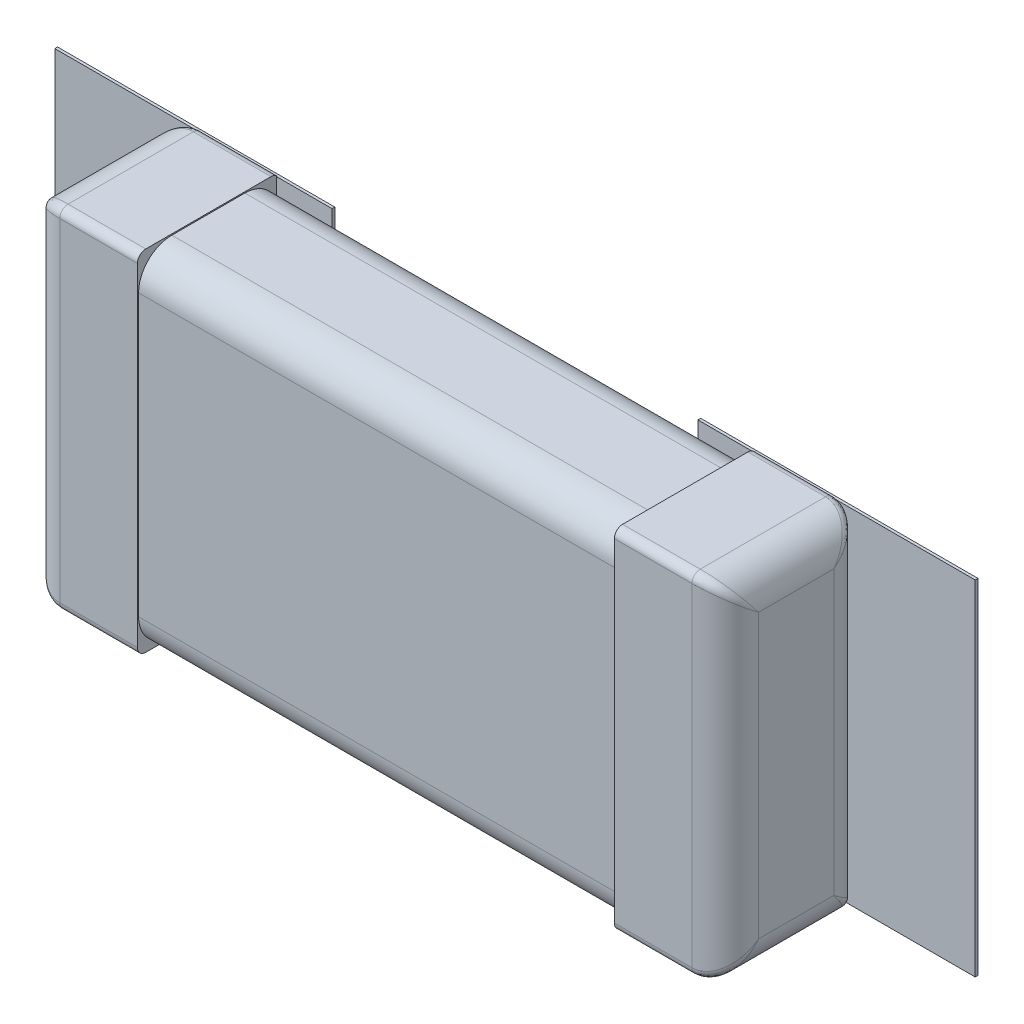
ISO-10303-21;
HEADER;
FILE_DESCRIPTION(('STEP AP214'),'2;1');
FILE_NAME('part.step','',(''),(''),'','','');
FILE_SCHEMA(('AUTOMOTIVE_DESIGN { 1 0 10303 214 1 1 1 1 }'));
ENDSEC;
DATA;
#1=APPLICATION_CONTEXT('core data for automotive mechanical design processes');
#2=APPLICATION_PROTOCOL_DEFINITION('international standard','automotive_design',2000,#1);
#3=PRODUCT_CONTEXT('',#1,'mechanical');
#4=PRODUCT('Part','Part','',(#3));
#5=PRODUCT_RELATED_PRODUCT_CATEGORY('part','',(#4));
#6=PRODUCT_DEFINITION_FORMATION('','',#4);
#7=PRODUCT_DEFINITION_CONTEXT('part definition',#1,'design');
#8=PRODUCT_DEFINITION('design','',#6,#7);
#9=PRODUCT_DEFINITION_SHAPE('','',#8);
#10=(LENGTH_UNIT() NAMED_UNIT(*) SI_UNIT(.MILLI.,.METRE.));
#11=(NAMED_UNIT(*) PLANE_ANGLE_UNIT() SI_UNIT($,.RADIAN.));
#12=(NAMED_UNIT(*) SI_UNIT($,.STERADIAN.) SOLID_ANGLE_UNIT());
#13=UNCERTAINTY_MEASURE_WITH_UNIT(LENGTH_MEASURE(1.E-05),#10,'distance_accuracy_value','');
#14=(GEOMETRIC_REPRESENTATION_CONTEXT(3) GLOBAL_UNCERTAINTY_ASSIGNED_CONTEXT((#13)) GLOBAL_UNIT_ASSIGNED_CONTEXT((#10,
#11,#12)) REPRESENTATION_CONTEXT('',''));
#15=CARTESIAN_POINT('',(0.,0.,0.));
#16=DIRECTION('',(0.,0.,1.));
#17=DIRECTION('',(1.,0.,0.));
#18=AXIS2_PLACEMENT_3D('',#15,#16,#17);
#19=CARTESIAN_POINT('',(-1.4478,-2.88612072,0.2286));
#20=DIRECTION('',(0.,1.,0.));
#21=DIRECTION('',(0.,0.,1.));
#22=AXIS2_PLACEMENT_3D('',#19,#20,#21);
#23=CYLINDRICAL_SURFACE('',#22,0.1524);
#24=CARTESIAN_POINT('',(-1.44454105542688,0.761974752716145,0.0762358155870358));
#25=CARTESIAN_POINT('',(-1.45343029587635,0.762115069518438,0.0760487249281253));
#26=CARTESIAN_POINT('',(-1.47321550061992,0.761129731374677,0.07736251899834));
#27=CARTESIAN_POINT('',(-1.503206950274,0.755118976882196,0.0853769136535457));
#28=CARTESIAN_POINT('',(-1.53322505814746,0.743521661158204,0.100840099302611));
#29=CARTESIAN_POINT('',(-1.56031826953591,0.726379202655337,0.123696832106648));
#30=CARTESIAN_POINT('',(-1.58242215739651,0.703792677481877,0.153812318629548));
#31=CARTESIAN_POINT('',(-1.59688364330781,0.676895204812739,0.189675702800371));
#32=CARTESIAN_POINT('',(-1.60029427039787,0.65695162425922,0.21626716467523));
#33=CARTESIAN_POINT('',(-1.6001948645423,0.646425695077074,0.230301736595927));
#34=CARTESIAN_POINT('',(-1.60018194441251,0.645787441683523,0.231152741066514));
#35=(BOUNDED_CURVE() B_SPLINE_CURVE(3,(#24,#25,#26,#27,#28,#29,#30,#31,#32,#33,#34),
.UNSPECIFIED.,.F.,.F.) B_SPLINE_CURVE_WITH_KNOTS((4,1,1,1,1,1,1,1,4),(-0.01158028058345,
0.0829859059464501,0.19771694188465,0.32261800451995,0.46278135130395,0.61997313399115,
0.79442749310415,0.97393002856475,0.9855103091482),
.UNSPECIFIED.) CURVE() GEOMETRIC_REPRESENTATION_ITEM() RATIONAL_B_SPLINE_CURVE((1.17153760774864,
1.17153760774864,1.17153760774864,1.17153760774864,1.17153760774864,1.17153760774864,
1.17153760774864,1.17153760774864,1.17153760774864,1.17153760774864,1.17153760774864)) REPRESENTATION_ITEM(''));
#36=CARTESIAN_POINT('',(-1.60019999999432,0.647700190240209,0.228600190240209));
#37=VERTEX_POINT('',#36);
#38=CARTESIAN_POINT('',(-1.50870652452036,0.752476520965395,0.0889000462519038));
#39=VERTEX_POINT('',#38);
#40=EDGE_CURVE('E213',#37,#39,#35,.F.);
#41=ORIENTED_EDGE('',*,*,#40,.T.);
#42=DIRECTION('',(0.,1.,0.));
#43=VECTOR('',#42,1.);
#44=CARTESIAN_POINT('',(-1.50870853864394,0.,0.0889));
#45=LINE('',#44,#43);
#46=CARTESIAN_POINT('',(-1.50870849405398,-0.752474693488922,0.0889001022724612));
#47=VERTEX_POINT('',#46);
#48=EDGE_CURVE('E1241',#47,#39,#45,.T.);
#49=ORIENTED_EDGE('',*,*,#48,.F.);
#50=CARTESIAN_POINT('',(-1.60020000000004,-0.647699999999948,0.228599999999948));
#51=CARTESIAN_POINT('',(-1.60019762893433,-0.649379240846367,0.226364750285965));
#52=CARTESIAN_POINT('',(-1.60014742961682,-0.651059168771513,0.224129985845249));
#53=CARTESIAN_POINT('',(-1.59994235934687,-0.654549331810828,0.219487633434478));
#54=CARTESIAN_POINT('',(-1.59977956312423,-0.656359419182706,0.217080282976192));
#55=CARTESIAN_POINT('',(-1.59932349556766,-0.660106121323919,0.212094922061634));
#56=CARTESIAN_POINT('',(-1.59902152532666,-0.662042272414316,0.209517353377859));
#57=CARTESIAN_POINT('',(-1.59825893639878,-0.66603747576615,0.204195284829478));
#58=CARTESIAN_POINT('',(-1.59778878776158,-0.668095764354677,0.201451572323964));
#59=CARTESIAN_POINT('',(-1.59665930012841,-0.672331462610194,0.195802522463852));
#60=CARTESIAN_POINT('',(-1.59598953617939,-0.674507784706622,0.192898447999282));
#61=CARTESIAN_POINT('',(-1.5944287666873,-0.678975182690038,0.186936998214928));
#62=CARTESIAN_POINT('',(-1.59352646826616,-0.681264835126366,0.183881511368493));
#63=CARTESIAN_POINT('',(-1.59146443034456,-0.685948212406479,0.17763133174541));
#64=CARTESIAN_POINT('',(-1.59029256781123,-0.688340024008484,0.174439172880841));
#65=CARTESIAN_POINT('',(-1.58833975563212,-0.691944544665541,0.169628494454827));
#66=CARTESIAN_POINT('',(-1.58764037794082,-0.693173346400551,0.16798850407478));
#67=CARTESIAN_POINT('',(-1.58616085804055,-0.695650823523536,0.164682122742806));
#68=CARTESIAN_POINT('',(-1.58537904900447,-0.696899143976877,0.163016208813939));
#69=CARTESIAN_POINT('',(-1.58372941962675,-0.699413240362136,0.159661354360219));
#70=CARTESIAN_POINT('',(-1.58285987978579,-0.700678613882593,0.157972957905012));
#71=CARTESIAN_POINT('',(-1.58102948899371,-0.703224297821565,0.154576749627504));
#72=CARTESIAN_POINT('',(-1.58006686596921,-0.704504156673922,0.152869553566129));
#73=CARTESIAN_POINT('',(-1.57804470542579,-0.707075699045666,0.149439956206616));
#74=CARTESIAN_POINT('',(-1.57698334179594,-0.70836687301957,0.147718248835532));
#75=CARTESIAN_POINT('',(-1.57475736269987,-0.710956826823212,0.144264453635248));
#76=CARTESIAN_POINT('',(-1.57359085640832,-0.712255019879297,0.142533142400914));
#77=CARTESIAN_POINT('',(-1.57135933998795,-0.714630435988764,0.139365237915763));
#78=CARTESIAN_POINT('',(-1.57030555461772,-0.715711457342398,0.137923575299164));
#79=CARTESIAN_POINT('',(-1.56817000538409,-0.717823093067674,0.135108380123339));
#80=CARTESIAN_POINT('',(-1.56708983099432,-0.718854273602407,0.133734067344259));
#81=CARTESIAN_POINT('',(-1.56490617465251,-0.720866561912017,0.131053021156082));
#82=CARTESIAN_POINT('',(-1.56380423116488,-0.721848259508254,0.129745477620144));
#83=CARTESIAN_POINT('',(-1.56158166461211,-0.723762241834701,0.127197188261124));
#84=CARTESIAN_POINT('',(-1.56046252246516,-0.724695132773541,0.125955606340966));
#85=CARTESIAN_POINT('',(-1.55821023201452,-0.726512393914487,0.1235382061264));
#86=CARTESIAN_POINT('',(-1.55707850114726,-0.727397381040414,0.122361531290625));
#87=CARTESIAN_POINT('',(-1.55480551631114,-0.729119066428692,0.120073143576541));
#88=CARTESIAN_POINT('',(-1.55366564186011,-0.72995641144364,0.118960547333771));
#89=CARTESIAN_POINT('',(-1.55138069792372,-0.73158285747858,0.116799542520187));
#90=CARTESIAN_POINT('',(-1.55023698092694,-0.732372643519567,0.115750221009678));
#91=CARTESIAN_POINT('',(-1.54794869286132,-0.733904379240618,0.113714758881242));
#92=CARTESIAN_POINT('',(-1.54680543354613,-0.734647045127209,0.112727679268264));
#93=CARTESIAN_POINT('',(-1.54344098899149,-0.736766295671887,0.109909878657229));
#94=CARTESIAN_POINT('',(-1.54117142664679,-0.738114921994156,0.108115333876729));
#95=CARTESIAN_POINT('',(-1.53667180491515,-0.740629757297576,0.10476454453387));
#96=CARTESIAN_POINT('',(-1.53445098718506,-0.741802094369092,0.103200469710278));
#97=CARTESIAN_POINT('',(-1.530079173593,-0.743977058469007,0.100295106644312));
#98=CARTESIAN_POINT('',(-1.52793643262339,-0.744985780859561,0.0989459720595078));
#99=CARTESIAN_POINT('',(-1.52375113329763,-0.746845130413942,0.0964551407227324));
#100=CARTESIAN_POINT('',(-1.52171596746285,-0.747701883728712,0.0953055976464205));
#101=CARTESIAN_POINT('',(-1.51777289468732,-0.749271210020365,0.0931973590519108));
#102=CARTESIAN_POINT('',(-1.51587148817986,-0.749989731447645,0.0922309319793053));
#103=CARTESIAN_POINT('',(-1.51221938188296,-0.751300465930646,0.090470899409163));
#104=CARTESIAN_POINT('',(-1.5104741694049,-0.751897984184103,0.0896698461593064));
#105=CARTESIAN_POINT('',(-1.50870854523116,-0.752474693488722,0.0888999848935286));
#106=B_SPLINE_CURVE_WITH_KNOTS('',3,(#50,#51,#52,#53,#54,#55,#56,#57,#58,#59,#60,#61,#62,#63,
#64,#65,#66,#67,#68,#69,#70,#71,#72,#73,#74,#75,#76,#77,#78,#79,#80,#81,#82,#83,#84,#85,#86,#87,
#88,#89,#90,#91,#92,#93,#94,#95,#96,#97,#98,#99,#100,#101,#102,#103,#104,#105),.UNSPECIFIED.,
.F.,.F.,(4,2,2,2,2,2,2,2,2,2,2,2,2,2,2,2,2,2,2,2,2,2,2,2,2,2,2,4),(0.,0.00838694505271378,
0.0174338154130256,0.0271446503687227,0.0375272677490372,0.0485940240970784,0.0603590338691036,
0.0728240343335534,0.0793192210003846,0.0859891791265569,0.0928342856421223,0.0998552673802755,
0.107052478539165,0.114425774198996,0.120687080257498,0.126774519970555,0.132688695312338,
0.138430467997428,0.14400069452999,0.149398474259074,0.154622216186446,0.159670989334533,
0.169241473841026,0.178112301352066,0.186285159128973,0.193750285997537,0.200499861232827,
0.206531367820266),.UNSPECIFIED.);
#107=CARTESIAN_POINT('',(-1.600199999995,-0.647699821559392,0.228599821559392));
#108=VERTEX_POINT('',#107);
#109=EDGE_CURVE('E224',#47,#108,#106,.F.);
#110=ORIENTED_EDGE('',*,*,#109,.T.);
#111=DIRECTION('',(0.,1.,0.));
#112=VECTOR('',#111,1.);
#113=CARTESIAN_POINT('',(-1.6002,0.8001,0.2286));
#114=LINE('',#113,#112);
#115=EDGE_CURVE('E1135',#37,#108,#114,.F.);
#116=ORIENTED_EDGE('',*,*,#115,.F.);
#117=EDGE_LOOP('',(#41,#49,#110,#116));
#118=FACE_BOUND('',#117,.T.);
#119=ADVANCED_FACE('F16',(#118),#23,.T.);
#120=CARTESIAN_POINT('',(0.,0.,0.0889));
#121=DIRECTION('',(0.,0.,1.));
#122=DIRECTION('',(1.,0.,0.));
#123=AXIS2_PLACEMENT_3D('',#120,#121,#122);
#124=PLANE('',#123);
#125=DIRECTION('',(0.,1.,0.));
#126=VECTOR('',#125,1.);
#127=CARTESIAN_POINT('',(-2.1079968,0.7875016,0.0889));
#128=LINE('',#127,#126);
#129=CARTESIAN_POINT('',(-2.1079968,-0.7875016,0.0889));
#130=VERTEX_POINT('',#129);
#131=CARTESIAN_POINT('',(-2.1079968,0.7875016,0.0889));
#132=VERTEX_POINT('',#131);
#133=EDGE_CURVE('E286',#130,#132,#128,.T.);
#134=ORIENTED_EDGE('',*,*,#133,.F.);
#135=DIRECTION('',(1.,0.,0.));
#136=VECTOR('',#135,1.);
#137=CARTESIAN_POINT('',(0.,-0.7875016,0.0889));
#138=LINE('',#137,#136);
#139=CARTESIAN_POINT('',(-1.47011106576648,-0.7875016,0.0889001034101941));
#140=VERTEX_POINT('',#139);
#141=EDGE_CURVE('E289',#130,#140,#138,.T.);
#142=ORIENTED_EDGE('',*,*,#141,.T.);
#143=CARTESIAN_POINT('',(-1.47011103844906,-0.787501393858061,0.0889000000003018));
#144=CARTESIAN_POINT('',(-1.47403367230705,-0.786447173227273,0.0888999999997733));
#145=CARTESIAN_POINT('',(-1.47789969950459,-0.785100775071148,0.0888999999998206));
#146=CARTESIAN_POINT('',(-1.48537399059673,-0.781752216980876,0.088900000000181));
#147=CARTESIAN_POINT('',(-1.4889796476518,-0.779744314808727,0.0889000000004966));
#148=CARTESIAN_POINT('',(-1.49590379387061,-0.7748836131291,0.0889000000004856));
#149=CARTESIAN_POINT('',(-1.49919427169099,-0.771989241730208,0.0889000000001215));
#150=CARTESIAN_POINT('',(-1.50408740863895,-0.76606292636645,0.0888999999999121));
#151=CARTESIAN_POINT('',(-1.50590560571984,-0.763230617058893,0.0888999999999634));
#152=CARTESIAN_POINT('',(-1.50808237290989,-0.757741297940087,0.0889000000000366));
#153=CARTESIAN_POINT('',(-1.50866418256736,-0.755167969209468,0.0889000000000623));
#154=CARTESIAN_POINT('',(-1.50870857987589,-0.752474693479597,0.0889000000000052));
#155=B_SPLINE_CURVE_WITH_KNOTS('',3,(#143,#144,#145,#146,#147,#148,#149,#150,#151,#152,#153,
#154),.UNSPECIFIED.,.F.,.F.,(4,2,2,2,2,4),(0.,0.0122068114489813,0.0245225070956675,
0.037538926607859,0.0474322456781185,0.0552915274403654),.UNSPECIFIED.);
#156=EDGE_CURVE('E1243',#140,#47,#155,.T.);
#157=ORIENTED_EDGE('',*,*,#156,.T.);
#158=ORIENTED_EDGE('',*,*,#48,.T.);
#159=CARTESIAN_POINT('',(-1.50870597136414,0.752476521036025,0.0889000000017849));
#160=CARTESIAN_POINT('',(-1.50867381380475,0.754931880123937,0.0889000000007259));
#161=CARTESIAN_POINT('',(-1.50818269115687,0.757296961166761,0.0889000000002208));
#162=CARTESIAN_POINT('',(-1.5062260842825,0.762635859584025,0.0888999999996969));
#163=CARTESIAN_POINT('',(-1.50446541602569,0.765507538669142,0.0888999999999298));
#164=CARTESIAN_POINT('',(-1.5007883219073,0.770120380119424,0.0889000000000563));
#165=CARTESIAN_POINT('',(-1.49898997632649,0.771971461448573,0.0889000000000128));
#166=CARTESIAN_POINT('',(-1.49512390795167,0.775384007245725,0.0888999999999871));
#167=CARTESIAN_POINT('',(-1.49305546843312,0.776944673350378,0.088900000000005));
#168=CARTESIAN_POINT('',(-1.48770349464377,0.780472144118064,0.0889000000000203));
#169=CARTESIAN_POINT('',(-1.4843134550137,0.782274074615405,0.0889000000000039));
#170=CARTESIAN_POINT('',(-1.47733392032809,0.785296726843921,0.0888999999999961));
#171=CARTESIAN_POINT('',(-1.47374763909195,0.78652478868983,0.0889000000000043));
#172=CARTESIAN_POINT('',(-1.47011194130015,0.787501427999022,0.0889000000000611));
#173=B_SPLINE_CURVE_WITH_KNOTS('',3,(#159,#160,#161,#162,#163,#164,#165,#166,#167,#168,#169,
#170,#171,#172),.UNSPECIFIED.,.F.,.F.,(4,2,2,2,2,2,4),(0.,0.00719748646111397,
0.0170805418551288,0.0248042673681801,0.0325489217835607,0.044012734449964,0.0553256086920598),.UNSPECIFIED.);
#174=CARTESIAN_POINT('',(-1.47011194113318,0.787501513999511,0.0889000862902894));
#175=VERTEX_POINT('',#174);
#176=EDGE_CURVE('E205',#39,#175,#173,.T.);
#177=ORIENTED_EDGE('',*,*,#176,.T.);
#178=DIRECTION('',(1.,0.,0.));
#179=VECTOR('',#178,1.);
#180=CARTESIAN_POINT('',(0.,0.7875016,0.0889));
#181=LINE('',#180,#179);
#182=EDGE_CURVE('E283',#175,#132,#181,.F.);
#183=ORIENTED_EDGE('',*,*,#182,.T.);
#184=EDGE_LOOP('',(#134,#142,#157,#158,#177,#183));
#185=FACE_BOUND('',#184,.T.);
#186=ADVANCED_FACE('F284',(#185),#124,.T.);
#187=CARTESIAN_POINT('',(1.4478,2.88612072,0.2286));
#188=DIRECTION('',(0.,-1.,0.));
#189=DIRECTION('',(0.,0.,-1.));
#190=AXIS2_PLACEMENT_3D('',#187,#188,#189);
#191=CYLINDRICAL_SURFACE('',#190,0.1524);
#192=CARTESIAN_POINT('',(1.44454105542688,-0.761974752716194,0.0762358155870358));
#193=CARTESIAN_POINT('',(1.4534302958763,-0.762115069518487,0.0760487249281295));
#194=CARTESIAN_POINT('',(1.47321550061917,-0.761129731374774,0.0773625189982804));
#195=CARTESIAN_POINT('',(1.50320695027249,-0.755118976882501,0.08537691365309));
#196=CARTESIAN_POINT('',(1.53322505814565,-0.743521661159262,0.100840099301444));
#197=CARTESIAN_POINT('',(1.56031826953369,-0.726379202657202,0.123696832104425));
#198=CARTESIAN_POINT('',(1.58242215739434,-0.703792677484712,0.153812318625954));
#199=CARTESIAN_POINT('',(1.59688364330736,-0.67689520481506,0.18967570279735));
#200=CARTESIAN_POINT('',(1.60029427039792,-0.656951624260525,0.216267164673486));
#201=CARTESIAN_POINT('',(1.60019486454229,-0.646425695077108,0.230301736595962));
#202=CARTESIAN_POINT('',(1.60018194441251,-0.645787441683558,0.231152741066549));
#203=(BOUNDED_CURVE() B_SPLINE_CURVE(3,(#192,#193,#194,#195,#196,#197,#198,#199,#200,#201,#202),
.UNSPECIFIED.,.F.,.F.) B_SPLINE_CURVE_WITH_KNOTS((4,1,1,1,1,1,1,1,4),(-0.01158028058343,
0.0829859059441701,0.19771694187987,0.32261800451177,0.46278135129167,0.61997313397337,
0.79442749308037,0.97393002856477,0.9855103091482),
.UNSPECIFIED.) CURVE() GEOMETRIC_REPRESENTATION_ITEM() RATIONAL_B_SPLINE_CURVE((1.17153760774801,
1.17153760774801,1.17153760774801,1.17153760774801,1.17153760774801,1.17153760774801,
1.17153760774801,1.17153760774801,1.17153760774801,1.17153760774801,1.17153760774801)) REPRESENTATION_ITEM(''));
#204=CARTESIAN_POINT('',(1.60019999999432,-0.647700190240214,0.228600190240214));
#205=VERTEX_POINT('',#204);
#206=CARTESIAN_POINT('',(1.50870652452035,-0.752476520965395,0.0889000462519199));
#207=VERTEX_POINT('',#206);
#208=EDGE_CURVE('E1213',#205,#207,#203,.F.);
#209=ORIENTED_EDGE('',*,*,#208,.T.);
#210=DIRECTION('',(0.,1.,0.));
#211=VECTOR('',#210,1.);
#212=CARTESIAN_POINT('',(1.50870853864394,0.,0.0889));
#213=LINE('',#212,#211);
#214=CARTESIAN_POINT('',(1.50870849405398,0.752474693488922,0.0889001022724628));
#215=VERTEX_POINT('',#214);
#216=EDGE_CURVE('E600',#215,#207,#213,.F.);
#217=ORIENTED_EDGE('',*,*,#216,.F.);
#218=CARTESIAN_POINT('',(1.60020000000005,0.647699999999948,0.228599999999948));
#219=CARTESIAN_POINT('',(1.60019762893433,0.649379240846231,0.226364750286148));
#220=CARTESIAN_POINT('',(1.60014742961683,0.651059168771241,0.224129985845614));
#221=CARTESIAN_POINT('',(1.59994235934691,0.654549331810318,0.219487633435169));
#222=CARTESIAN_POINT('',(1.59977956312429,0.656359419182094,0.217080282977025));
#223=CARTESIAN_POINT('',(1.59932349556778,0.660106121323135,0.212094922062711));
#224=CARTESIAN_POINT('',(1.5990215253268,0.662042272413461,0.209517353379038));
#225=CARTESIAN_POINT('',(1.598258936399,0.666037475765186,0.204195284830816));
#226=CARTESIAN_POINT('',(1.59778878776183,0.668095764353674,0.201451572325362));
#227=CARTESIAN_POINT('',(1.59665930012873,0.672331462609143,0.195802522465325));
#228=CARTESIAN_POINT('',(1.59598953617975,0.674507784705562,0.192898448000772));
#229=CARTESIAN_POINT('',(1.59442876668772,0.67897518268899,0.186936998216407));
#230=CARTESIAN_POINT('',(1.59352646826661,0.681264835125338,0.183881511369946));
#231=CARTESIAN_POINT('',(1.59146443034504,0.68594821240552,0.177631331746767));
#232=CARTESIAN_POINT('',(1.59029256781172,0.688340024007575,0.174439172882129));
#233=CARTESIAN_POINT('',(1.58833975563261,0.691944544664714,0.169628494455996));
#234=CARTESIAN_POINT('',(1.58764037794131,0.693173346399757,0.1679885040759));
#235=CARTESIAN_POINT('',(1.58616085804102,0.695650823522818,0.164682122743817));
#236=CARTESIAN_POINT('',(1.58537904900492,0.696899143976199,0.163016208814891));
#237=CARTESIAN_POINT('',(1.58372941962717,0.699413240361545,0.159661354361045));
#238=CARTESIAN_POINT('',(1.58285987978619,0.700678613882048,0.157972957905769));
#239=CARTESIAN_POINT('',(1.58102948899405,0.703224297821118,0.154576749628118));
#240=CARTESIAN_POINT('',(1.58006686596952,0.704504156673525,0.152869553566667));
#241=CARTESIAN_POINT('',(1.57804470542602,0.707075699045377,0.149439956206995));
#242=CARTESIAN_POINT('',(1.57698334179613,0.708366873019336,0.147718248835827));
#243=CARTESIAN_POINT('',(1.57475736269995,0.710956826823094,0.14426445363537));
#244=CARTESIAN_POINT('',(1.57359085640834,0.712255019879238,0.142533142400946));
#245=CARTESIAN_POINT('',(1.57135933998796,0.7146304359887,0.139365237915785));
#246=CARTESIAN_POINT('',(1.57030555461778,0.71571145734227,0.137923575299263));
#247=CARTESIAN_POINT('',(1.56817000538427,0.717823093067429,0.13510838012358));
#248=CARTESIAN_POINT('',(1.56708983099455,0.718854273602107,0.133734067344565));
#249=CARTESIAN_POINT('',(1.56490617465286,0.720866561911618,0.13105302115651));
#250=CARTESIAN_POINT('',(1.56380423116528,0.72184825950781,0.129745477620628));
#251=CARTESIAN_POINT('',(1.56158166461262,0.723762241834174,0.12719718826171));
#252=CARTESIAN_POINT('',(1.56046252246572,0.724695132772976,0.125955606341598));
#253=CARTESIAN_POINT('',(1.55821023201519,0.726512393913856,0.123538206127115));
#254=CARTESIAN_POINT('',(1.55707850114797,0.727397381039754,0.122361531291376));
#255=CARTESIAN_POINT('',(1.55480551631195,0.729119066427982,0.120073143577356));
#256=CARTESIAN_POINT('',(1.55366564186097,0.729956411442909,0.118960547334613));
#257=CARTESIAN_POINT('',(1.55138069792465,0.731582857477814,0.116799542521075));
#258=CARTESIAN_POINT('',(1.55023698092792,0.732372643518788,0.115750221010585));
#259=CARTESIAN_POINT('',(1.54794869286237,0.733904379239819,0.113714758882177));
#260=CARTESIAN_POINT('',(1.54680543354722,0.734647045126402,0.11272767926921));
#261=CARTESIAN_POINT('',(1.54344098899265,0.736766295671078,0.109909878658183));
#262=CARTESIAN_POINT('',(1.541171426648,0.738114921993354,0.108115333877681));
#263=CARTESIAN_POINT('',(1.53667180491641,0.74062975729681,0.104764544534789));
#264=CARTESIAN_POINT('',(1.53445098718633,0.741802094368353,0.103200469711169));
#265=CARTESIAN_POINT('',(1.53007917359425,0.743977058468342,0.100295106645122));
#266=CARTESIAN_POINT('',(1.52793643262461,0.744985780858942,0.0989459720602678));
#267=CARTESIAN_POINT('',(1.52375113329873,0.746845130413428,0.0964551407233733));
#268=CARTESIAN_POINT('',(1.52171596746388,0.747701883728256,0.095305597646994));
#269=CARTESIAN_POINT('',(1.51777289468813,0.749271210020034,0.0931973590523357));
#270=CARTESIAN_POINT('',(1.51587148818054,0.749989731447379,0.0922309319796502));
#271=CARTESIAN_POINT('',(1.51221938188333,0.751300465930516,0.0904708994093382));
#272=CARTESIAN_POINT('',(1.51047416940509,0.751897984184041,0.0896698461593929));
#273=CARTESIAN_POINT('',(1.50870854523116,0.752474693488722,0.0888999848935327));
#274=B_SPLINE_CURVE_WITH_KNOTS('',3,(#218,#219,#220,#221,#222,#223,#224,#225,#226,#227,#228,
#229,#230,#231,#232,#233,#234,#235,#236,#237,#238,#239,#240,#241,#242,#243,#244,#245,#246,#247,
#248,#249,#250,#251,#252,#253,#254,#255,#256,#257,#258,#259,#260,#261,#262,#263,#264,#265,#266,
#267,#268,#269,#270,#271,#272,#273),.UNSPECIFIED.,.F.,.F.,(4,2,2,2,2,2,2,2,2,2,2,2,2,2,2,2,2,2,
2,2,2,2,2,2,2,2,2,4),(0.,0.00838694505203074,0.0174338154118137,0.0271446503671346,
0.0375272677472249,0.0485940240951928,0.0603590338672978,0.0728240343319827,0.0793192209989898,
0.0859891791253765,0.0928342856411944,0.0998552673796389,0.107052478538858,0.114425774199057,
0.120687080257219,0.126774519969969,0.132688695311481,0.138430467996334,0.144000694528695,
0.149398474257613,0.154622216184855,0.159670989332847,0.169241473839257,0.178112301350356,
0.186285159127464,0.193750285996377,0.200499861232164,0.206531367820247),.UNSPECIFIED.);
#275=CARTESIAN_POINT('',(1.600199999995,0.647699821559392,0.228599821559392));
#276=VERTEX_POINT('',#275);
#277=EDGE_CURVE('E986',#215,#276,#274,.F.);
#278=ORIENTED_EDGE('',*,*,#277,.T.);
#279=DIRECTION('',(0.,1.,0.));
#280=VECTOR('',#279,1.);
#281=CARTESIAN_POINT('',(1.6002,-0.8001,0.2286));
#282=LINE('',#281,#280);
#283=EDGE_CURVE('E859',#205,#276,#282,.T.);
#284=ORIENTED_EDGE('',*,*,#283,.F.);
#285=EDGE_LOOP('',(#209,#217,#278,#284));
#286=FACE_BOUND('',#285,.T.);
#287=ADVANCED_FACE('F622',(#286),#191,.T.);
#288=CARTESIAN_POINT('',(0.,0.,0.0889));
#289=DIRECTION('',(0.,0.,1.));
#290=DIRECTION('',(1.,0.,0.));
#291=AXIS2_PLACEMENT_3D('',#288,#289,#290);
#292=PLANE('',#291);
#293=DIRECTION('',(0.,1.,0.));
#294=VECTOR('',#293,1.);
#295=CARTESIAN_POINT('',(2.1079968,-0.7875016,0.0889));
#296=LINE('',#295,#294);
#297=CARTESIAN_POINT('',(2.1079968,0.7875016,0.0889));
#298=VERTEX_POINT('',#297);
#299=CARTESIAN_POINT('',(2.1079968,-0.7875016,0.0889));
#300=VERTEX_POINT('',#299);
#301=EDGE_CURVE('E1263',#298,#300,#296,.F.);
#302=ORIENTED_EDGE('',*,*,#301,.F.);
#303=DIRECTION('',(1.,0.,0.));
#304=VECTOR('',#303,1.);
#305=CARTESIAN_POINT('',(0.,0.7875016,0.0889));
#306=LINE('',#305,#304);
#307=CARTESIAN_POINT('',(1.47011106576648,0.7875016,0.0889001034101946));
#308=VERTEX_POINT('',#307);
#309=EDGE_CURVE('E1137',#298,#308,#306,.F.);
#310=ORIENTED_EDGE('',*,*,#309,.T.);
#311=CARTESIAN_POINT('',(1.47011103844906,0.78750139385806,0.0889000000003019));
#312=CARTESIAN_POINT('',(1.47403367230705,0.786447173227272,0.0888999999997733));
#313=CARTESIAN_POINT('',(1.47789969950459,0.785100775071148,0.0888999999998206));
#314=CARTESIAN_POINT('',(1.48537399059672,0.781752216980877,0.088900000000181));
#315=CARTESIAN_POINT('',(1.48897964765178,0.779744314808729,0.0889000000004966));
#316=CARTESIAN_POINT('',(1.4959037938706,0.774883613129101,0.0889000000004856));
#317=CARTESIAN_POINT('',(1.49919427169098,0.771989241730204,0.0889000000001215));
#318=CARTESIAN_POINT('',(1.50408740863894,0.766062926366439,0.0888999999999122));
#319=CARTESIAN_POINT('',(1.50590560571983,0.763230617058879,0.0888999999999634));
#320=CARTESIAN_POINT('',(1.50808237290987,0.757741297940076,0.0889000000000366));
#321=CARTESIAN_POINT('',(1.50866418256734,0.755167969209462,0.0889000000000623));
#322=CARTESIAN_POINT('',(1.50870857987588,0.752474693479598,0.0889000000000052));
#323=B_SPLINE_CURVE_WITH_KNOTS('',3,(#311,#312,#313,#314,#315,#316,#317,#318,#319,#320,#321,
#322),.UNSPECIFIED.,.F.,.F.,(4,2,2,2,2,4),(0.,0.0122068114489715,0.0245225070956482,
0.0375389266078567,0.0474322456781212,0.0552915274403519),.UNSPECIFIED.);
#324=EDGE_CURVE('E608',#308,#215,#323,.T.);
#325=ORIENTED_EDGE('',*,*,#324,.T.);
#326=ORIENTED_EDGE('',*,*,#216,.T.);
#327=CARTESIAN_POINT('',(1.50870597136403,-0.752476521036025,0.0889000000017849));
#328=CARTESIAN_POINT('',(1.50867381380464,-0.754931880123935,0.0889000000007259));
#329=CARTESIAN_POINT('',(1.50818269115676,-0.757296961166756,0.0889000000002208));
#330=CARTESIAN_POINT('',(1.50622608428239,-0.762635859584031,0.0888999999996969));
#331=CARTESIAN_POINT('',(1.50446541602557,-0.76550753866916,0.0888999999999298));
#332=CARTESIAN_POINT('',(1.50078832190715,-0.770120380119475,0.0889000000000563));
#333=CARTESIAN_POINT('',(1.49898997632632,-0.771971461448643,0.0889000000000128));
#334=CARTESIAN_POINT('',(1.49512390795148,-0.775384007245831,0.0888999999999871));
#335=CARTESIAN_POINT('',(1.49305546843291,-0.776944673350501,0.088900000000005));
#336=CARTESIAN_POINT('',(1.48770349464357,-0.780472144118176,0.0889000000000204));
#337=CARTESIAN_POINT('',(1.48431345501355,-0.782274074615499,0.088900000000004));
#338=CARTESIAN_POINT('',(1.47733392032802,-0.78529672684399,0.0888999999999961));
#339=CARTESIAN_POINT('',(1.47374763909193,-0.786524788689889,0.0889000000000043));
#340=CARTESIAN_POINT('',(1.47011194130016,-0.787501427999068,0.088900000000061));
#341=B_SPLINE_CURVE_WITH_KNOTS('',3,(#327,#328,#329,#330,#331,#332,#333,#334,#335,#336,#337,
#338,#339,#340),.UNSPECIFIED.,.F.,.F.,(4,2,2,2,2,2,4),(0.,0.00719748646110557,
0.0170805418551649,0.0248042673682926,0.0325489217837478,0.0440127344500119,0.0553256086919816),.UNSPECIFIED.);
#342=CARTESIAN_POINT('',(1.4701119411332,-0.787501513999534,0.0889000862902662));
#343=VERTEX_POINT('',#342);
#344=EDGE_CURVE('E597',#207,#343,#341,.T.);
#345=ORIENTED_EDGE('',*,*,#344,.T.);
#346=DIRECTION('',(1.,0.,0.));
#347=VECTOR('',#346,1.);
#348=CARTESIAN_POINT('',(0.,-0.7875016,0.0889));
#349=LINE('',#348,#347);
#350=EDGE_CURVE('E599',#343,#300,#349,.T.);
#351=ORIENTED_EDGE('',*,*,#350,.T.);
#352=EDGE_LOOP('',(#302,#310,#325,#326,#345,#351));
#353=FACE_BOUND('',#352,.T.);
#354=ADVANCED_FACE('F616',(#353),#292,.T.);
#355=CARTESIAN_POINT('',(-1.6002,0.8001,0.0762));
#356=DIRECTION('',(-1.,0.,0.));
#357=DIRECTION('',(0.,0.,1.));
#358=AXIS2_PLACEMENT_3D('',#355,#356,#357);
#359=PLANE('',#358);
#360=DIRECTION('',(0.,0.,-1.));
#361=VECTOR('',#360,1.);
#362=CARTESIAN_POINT('',(-1.6002,-0.6477,1.5735077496));
#363=LINE('',#362,#361);
#364=CARTESIAN_POINT('',(-1.60019999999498,-0.647700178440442,0.573785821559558));
#365=VERTEX_POINT('',#364);
#366=EDGE_CURVE('E232',#365,#108,#363,.T.);
#367=ORIENTED_EDGE('',*,*,#366,.F.);
#368=DIRECTION('',(0.,-1.,0.));
#369=VECTOR('',#368,1.);
#370=CARTESIAN_POINT('',(-1.6002,2.88612072,0.573786));
#371=LINE('',#370,#369);
#372=CARTESIAN_POINT('',(-1.60019999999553,0.647699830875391,0.573786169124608));
#373=VERTEX_POINT('',#372);
#374=EDGE_CURVE('E460',#373,#365,#371,.T.);
#375=ORIENTED_EDGE('',*,*,#374,.F.);
#376=DIRECTION('',(0.,0.,-1.));
#377=VECTOR('',#376,1.);
#378=CARTESIAN_POINT('',(-1.6002,0.6477,1.5735077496));
#379=LINE('',#378,#377);
#380=EDGE_CURVE('E365',#37,#373,#379,.F.);
#381=ORIENTED_EDGE('',*,*,#380,.F.);
#382=ORIENTED_EDGE('',*,*,#115,.T.);
#383=EDGE_LOOP('',(#367,#375,#381,#382));
#384=FACE_BOUND('',#383,.T.);
#385=ADVANCED_FACE('F621',(#384),#359,.T.);
#386=CARTESIAN_POINT('',(-2.1079968,0.7875016,0.0762));
#387=DIRECTION('',(-1.,0.,0.));
#388=DIRECTION('',(0.,0.,1.));
#389=AXIS2_PLACEMENT_3D('',#386,#387,#388);
#390=PLANE('',#389);
#391=DIRECTION('',(0.,0.,1.));
#392=VECTOR('',#391,1.);
#393=CARTESIAN_POINT('',(-2.1079968,0.7875016,0.0762));
#394=LINE('',#393,#392);
#395=CARTESIAN_POINT('',(-2.1079968,0.7875016,0.0762));
#396=VERTEX_POINT('',#395);
#397=EDGE_CURVE('E293',#132,#396,#394,.F.);
#398=ORIENTED_EDGE('',*,*,#397,.T.);
#399=DIRECTION('',(0.,1.,0.));
#400=VECTOR('',#399,1.);
#401=CARTESIAN_POINT('',(-2.1079968,0.,0.0762));
#402=LINE('',#401,#400);
#403=CARTESIAN_POINT('',(-2.1079968,-0.7875016,0.0762));
#404=VERTEX_POINT('',#403);
#405=EDGE_CURVE('E357',#396,#404,#402,.F.);
#406=ORIENTED_EDGE('',*,*,#405,.T.);
#407=DIRECTION('',(0.,0.,1.));
#408=VECTOR('',#407,1.);
#409=CARTESIAN_POINT('',(-2.1079968,-0.7875016,0.0762));
#410=LINE('',#409,#408);
#411=EDGE_CURVE('E279',#404,#130,#410,.T.);
#412=ORIENTED_EDGE('',*,*,#411,.T.);
#413=ORIENTED_EDGE('',*,*,#133,.T.);
#414=EDGE_LOOP('',(#398,#406,#412,#413));
#415=FACE_BOUND('',#414,.T.);
#416=ADVANCED_FACE('F292',(#415),#390,.T.);
#417=CARTESIAN_POINT('',(-0.8379968,-0.7875016,0.0762));
#418=DIRECTION('',(1.,0.,0.));
#419=DIRECTION('',(0.,0.,-1.));
#420=AXIS2_PLACEMENT_3D('',#417,#418,#419);
#421=PLANE('',#420);
#422=CARTESIAN_POINT('',(-0.837996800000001,0.642366,0.233934));
#423=DIRECTION('',(-1.,0.,0.));
#424=DIRECTION('',(0.,0.,1.));
#425=AXIS2_PLACEMENT_3D('',#422,#423,#424);
#426=CIRCLE('',#425,0.1524);
#427=CARTESIAN_POINT('',(-0.8379968,0.689173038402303,0.0889));
#428=VERTEX_POINT('',#427);
#429=CARTESIAN_POINT('',(-0.837996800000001,0.642366,0.081534));
#430=VERTEX_POINT('',#429);
#431=EDGE_CURVE('E593',#428,#430,#426,.T.);
#432=ORIENTED_EDGE('',*,*,#431,.T.);
#433=DIRECTION('',(0.,1.,0.));
#434=VECTOR('',#433,1.);
#435=CARTESIAN_POINT('',(-0.8379968,-0.8001,0.081534));
#436=LINE('',#435,#434);
#437=CARTESIAN_POINT('',(-0.8379968,-0.642366,0.081534));
#438=VERTEX_POINT('',#437);
#439=EDGE_CURVE('E595',#430,#438,#436,.F.);
#440=ORIENTED_EDGE('',*,*,#439,.T.);
#441=CARTESIAN_POINT('',(-0.8379968,-0.642366,0.233934));
#442=DIRECTION('',(1.,0.,0.));
#443=DIRECTION('',(0.,0.,-1.));
#444=AXIS2_PLACEMENT_3D('',#441,#442,#443);
#445=CIRCLE('',#444,0.1524);
#446=CARTESIAN_POINT('',(-0.8379968,-0.689173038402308,0.0888999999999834));
#447=VERTEX_POINT('',#446);
#448=EDGE_CURVE('E581',#447,#438,#445,.T.);
#449=ORIENTED_EDGE('',*,*,#448,.F.);
#450=DIRECTION('',(0.,1.,0.));
#451=VECTOR('',#450,1.);
#452=CARTESIAN_POINT('',(-0.8379968,-0.7875016,0.0889));
#453=LINE('',#452,#451);
#454=CARTESIAN_POINT('',(-0.8379968,-0.7875016,0.0889));
#455=VERTEX_POINT('',#454);
#456=EDGE_CURVE('E301',#447,#455,#453,.F.);
#457=ORIENTED_EDGE('',*,*,#456,.T.);
#458=DIRECTION('',(0.,0.,-1.));
#459=VECTOR('',#458,1.);
#460=CARTESIAN_POINT('',(-0.8379968,-0.7875016,0.0762));
#461=LINE('',#460,#459);
#462=CARTESIAN_POINT('',(-0.8379968,-0.7875016,0.0762));
#463=VERTEX_POINT('',#462);
#464=EDGE_CURVE('E303',#455,#463,#461,.T.);
#465=ORIENTED_EDGE('',*,*,#464,.T.);
#466=DIRECTION('',(0.,1.,0.));
#467=VECTOR('',#466,1.);
#468=CARTESIAN_POINT('',(-0.8379968,0.,0.0762));
#469=LINE('',#468,#467);
#470=CARTESIAN_POINT('',(-0.8379968,0.7875016,0.0762));
#471=VERTEX_POINT('',#470);
#472=EDGE_CURVE('E364',#463,#471,#469,.T.);
#473=ORIENTED_EDGE('',*,*,#472,.T.);
#474=DIRECTION('',(0.,0.,-1.));
#475=VECTOR('',#474,1.);
#476=CARTESIAN_POINT('',(-0.8379968,0.7875016,0.0762));
#477=LINE('',#476,#475);
#478=CARTESIAN_POINT('',(-0.8379968,0.7875016,0.0889));
#479=VERTEX_POINT('',#478);
#480=EDGE_CURVE('E1118',#471,#479,#477,.F.);
#481=ORIENTED_EDGE('',*,*,#480,.T.);
#482=DIRECTION('',(0.,1.,0.));
#483=VECTOR('',#482,1.);
#484=CARTESIAN_POINT('',(-0.8379968,-0.7875016,0.0889));
#485=LINE('',#484,#483);
#486=EDGE_CURVE('E596',#479,#428,#485,.F.);
#487=ORIENTED_EDGE('',*,*,#486,.T.);
#488=EDGE_LOOP('',(#432,#440,#449,#457,#465,#473,#481,#487));
#489=FACE_BOUND('',#488,.T.);
#490=ADVANCED_FACE('F1508',(#489),#421,.T.);
#491=CARTESIAN_POINT('',(-1.0922,-0.8001,0.081534));
#492=DIRECTION('',(0.,0.,1.));
#493=DIRECTION('',(1.,0.,0.));
#494=AXIS2_PLACEMENT_3D('',#491,#492,#493);
#495=PLANE('',#494);
#496=ORIENTED_EDGE('',*,*,#439,.F.);
#497=DIRECTION('',(-1.,0.,0.));
#498=VECTOR('',#497,1.);
#499=CARTESIAN_POINT('',(7.60396605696,0.642366,0.081534));
#500=LINE('',#499,#498);
#501=CARTESIAN_POINT('',(0.8379968,0.642366,0.081534));
#502=VERTEX_POINT('',#501);
#503=EDGE_CURVE('E574',#502,#430,#500,.T.);
#504=ORIENTED_EDGE('',*,*,#503,.F.);
#505=DIRECTION('',(0.,1.,0.));
#506=VECTOR('',#505,1.);
#507=CARTESIAN_POINT('',(0.8379968,0.7875016,0.081534));
#508=LINE('',#507,#506);
#509=CARTESIAN_POINT('',(0.837996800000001,-0.642366,0.081534));
#510=VERTEX_POINT('',#509);
#511=EDGE_CURVE('E592',#510,#502,#508,.T.);
#512=ORIENTED_EDGE('',*,*,#511,.F.);
#513=DIRECTION('',(1.,0.,0.));
#514=VECTOR('',#513,1.);
#515=CARTESIAN_POINT('',(-7.60396605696,-0.642366,0.081534));
#516=LINE('',#515,#514);
#517=EDGE_CURVE('E530',#438,#510,#516,.T.);
#518=ORIENTED_EDGE('',*,*,#517,.F.);
#519=EDGE_LOOP('',(#496,#504,#512,#518));
#520=FACE_BOUND('',#519,.T.);
#521=ADVANCED_FACE('F1506',(#520),#495,.F.);
#522=CARTESIAN_POINT('',(1.6002,-0.8001,0.0762));
#523=DIRECTION('',(1.,0.,0.));
#524=DIRECTION('',(0.,0.,-1.));
#525=AXIS2_PLACEMENT_3D('',#522,#523,#524);
#526=PLANE('',#525);
#527=DIRECTION('',(0.,0.,-1.));
#528=VECTOR('',#527,1.);
#529=CARTESIAN_POINT('',(1.6002,0.6477,1.5735077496));
#530=LINE('',#529,#528);
#531=CARTESIAN_POINT('',(1.60019999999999,0.647699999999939,0.57378600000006));
#532=VERTEX_POINT('',#531);
#533=EDGE_CURVE('E995',#532,#276,#530,.T.);
#534=ORIENTED_EDGE('',*,*,#533,.F.);
#535=DIRECTION('',(0.,1.,0.));
#536=VECTOR('',#535,1.);
#537=CARTESIAN_POINT('',(1.6002,-2.88612072,0.573786));
#538=LINE('',#537,#536);
#539=CARTESIAN_POINT('',(1.60019999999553,-0.647699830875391,0.573786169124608));
#540=VERTEX_POINT('',#539);
#541=EDGE_CURVE('E935',#540,#532,#538,.T.);
#542=ORIENTED_EDGE('',*,*,#541,.F.);
#543=DIRECTION('',(0.,0.,-1.));
#544=VECTOR('',#543,1.);
#545=CARTESIAN_POINT('',(1.6002,-0.6477,1.5735077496));
#546=LINE('',#545,#544);
#547=EDGE_CURVE('E1035',#205,#540,#546,.F.);
#548=ORIENTED_EDGE('',*,*,#547,.F.);
#549=ORIENTED_EDGE('',*,*,#283,.T.);
#550=EDGE_LOOP('',(#534,#542,#548,#549));
#551=FACE_BOUND('',#550,.T.);
#552=ADVANCED_FACE('F1034',(#551),#526,.T.);
#553=CARTESIAN_POINT('',(2.1079968,-0.7875016,0.0762));
#554=DIRECTION('',(1.,0.,0.));
#555=DIRECTION('',(0.,0.,-1.));
#556=AXIS2_PLACEMENT_3D('',#553,#554,#555);
#557=PLANE('',#556);
#558=DIRECTION('',(0.,0.,-1.));
#559=VECTOR('',#558,1.);
#560=CARTESIAN_POINT('',(2.1079968,-0.7875016,0.0762));
#561=LINE('',#560,#559);
#562=CARTESIAN_POINT('',(2.1079968,-0.7875016,0.0762));
#563=VERTEX_POINT('',#562);
#564=EDGE_CURVE('E856',#300,#563,#561,.T.);
#565=ORIENTED_EDGE('',*,*,#564,.T.);
#566=DIRECTION('',(0.,1.,0.));
#567=VECTOR('',#566,1.);
#568=CARTESIAN_POINT('',(2.1079968,0.,0.0762));
#569=LINE('',#568,#567);
#570=CARTESIAN_POINT('',(2.1079968,0.7875016,0.0762));
#571=VERTEX_POINT('',#570);
#572=EDGE_CURVE('E1177',#563,#571,#569,.T.);
#573=ORIENTED_EDGE('',*,*,#572,.T.);
#574=DIRECTION('',(0.,0.,-1.));
#575=VECTOR('',#574,1.);
#576=CARTESIAN_POINT('',(2.1079968,0.7875016,0.0762));
#577=LINE('',#576,#575);
#578=EDGE_CURVE('E862',#571,#298,#577,.F.);
#579=ORIENTED_EDGE('',*,*,#578,.T.);
#580=ORIENTED_EDGE('',*,*,#301,.T.);
#581=EDGE_LOOP('',(#565,#573,#579,#580));
#582=FACE_BOUND('',#581,.T.);
#583=ADVANCED_FACE('F1392',(#582),#557,.T.);
#584=CARTESIAN_POINT('',(0.8379968,0.7875016,0.0762));
#585=DIRECTION('',(-1.,0.,0.));
#586=DIRECTION('',(0.,0.,1.));
#587=AXIS2_PLACEMENT_3D('',#584,#585,#586);
#588=PLANE('',#587);
#589=CARTESIAN_POINT('',(0.837996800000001,-0.642366,0.233934));
#590=DIRECTION('',(1.,0.,0.));
#591=DIRECTION('',(0.,0.,-1.));
#592=AXIS2_PLACEMENT_3D('',#589,#590,#591);
#593=CIRCLE('',#592,0.1524);
#594=CARTESIAN_POINT('',(0.837996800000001,-0.689173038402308,0.0888999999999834));
#595=VERTEX_POINT('',#594);
#596=EDGE_CURVE('E589',#510,#595,#593,.F.);
#597=ORIENTED_EDGE('',*,*,#596,.F.);
#598=ORIENTED_EDGE('',*,*,#511,.T.);
#599=CARTESIAN_POINT('',(0.8379968,0.642366,0.233934));
#600=DIRECTION('',(-1.,0.,0.));
#601=DIRECTION('',(0.,0.,1.));
#602=AXIS2_PLACEMENT_3D('',#599,#600,#601);
#603=CIRCLE('',#602,0.1524);
#604=CARTESIAN_POINT('',(0.8379968,0.689173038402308,0.0888999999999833));
#605=VERTEX_POINT('',#604);
#606=EDGE_CURVE('E571',#605,#502,#603,.T.);
#607=ORIENTED_EDGE('',*,*,#606,.F.);
#608=DIRECTION('',(0.,1.,0.));
#609=VECTOR('',#608,1.);
#610=CARTESIAN_POINT('',(0.8379968,0.7875016,0.0889));
#611=LINE('',#610,#609);
#612=CARTESIAN_POINT('',(0.8379968,0.7875016,0.0889));
#613=VERTEX_POINT('',#612);
#614=EDGE_CURVE('E854',#605,#613,#611,.T.);
#615=ORIENTED_EDGE('',*,*,#614,.T.);
#616=DIRECTION('',(0.,0.,1.));
#617=VECTOR('',#616,1.);
#618=CARTESIAN_POINT('',(0.8379968,0.7875016,0.0762));
#619=LINE('',#618,#617);
#620=CARTESIAN_POINT('',(0.8379968,0.7875016,0.0762));
#621=VERTEX_POINT('',#620);
#622=EDGE_CURVE('E848',#613,#621,#619,.F.);
#623=ORIENTED_EDGE('',*,*,#622,.T.);
#624=DIRECTION('',(0.,1.,0.));
#625=VECTOR('',#624,1.);
#626=CARTESIAN_POINT('',(0.8379968,0.,0.0762));
#627=LINE('',#626,#625);
#628=CARTESIAN_POINT('',(0.8379968,-0.7875016,0.0762));
#629=VERTEX_POINT('',#628);
#630=EDGE_CURVE('E1174',#621,#629,#627,.F.);
#631=ORIENTED_EDGE('',*,*,#630,.T.);
#632=DIRECTION('',(0.,0.,1.));
#633=VECTOR('',#632,1.);
#634=CARTESIAN_POINT('',(0.8379968,-0.7875016,0.0762));
#635=LINE('',#634,#633);
#636=CARTESIAN_POINT('',(0.8379968,-0.7875016,0.0889));
#637=VERTEX_POINT('',#636);
#638=EDGE_CURVE('E845',#629,#637,#635,.T.);
#639=ORIENTED_EDGE('',*,*,#638,.T.);
#640=DIRECTION('',(0.,1.,0.));
#641=VECTOR('',#640,1.);
#642=CARTESIAN_POINT('',(0.8379968,0.7875016,0.0889));
#643=LINE('',#642,#641);
#644=EDGE_CURVE('E838',#637,#595,#643,.T.);
#645=ORIENTED_EDGE('',*,*,#644,.T.);
#646=EDGE_LOOP('',(#597,#598,#607,#615,#623,#631,#639,#645));
#647=FACE_BOUND('',#646,.T.);
#648=ADVANCED_FACE('F1401',(#647),#588,.T.);
#649=CARTESIAN_POINT('',(-7.60396605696,-0.642366,0.233934));
#650=DIRECTION('',(1.,0.,0.));
#651=DIRECTION('',(0.,0.,-1.));
#652=AXIS2_PLACEMENT_3D('',#649,#650,#651);
#653=CYLINDRICAL_SURFACE('',#652,0.1524);
#654=ORIENTED_EDGE('',*,*,#448,.T.);
#655=ORIENTED_EDGE('',*,*,#517,.T.);
#656=ORIENTED_EDGE('',*,*,#596,.T.);
#657=DIRECTION('',(1.,0.,0.));
#658=VECTOR('',#657,1.);
#659=CARTESIAN_POINT('',(-7.60396605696,-0.689173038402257,0.0888999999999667));
#660=LINE('',#659,#658);
#661=CARTESIAN_POINT('',(1.0922,-0.689173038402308,0.0888999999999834));
#662=VERTEX_POINT('',#661);
#663=EDGE_CURVE('E588',#595,#662,#660,.T.);
#664=ORIENTED_EDGE('',*,*,#663,.T.);
#665=CARTESIAN_POINT('',(1.0922,-0.642366,0.233934));
#666=DIRECTION('',(1.,0.,0.));
#667=DIRECTION('',(0.,0.,-1.));
#668=AXIS2_PLACEMENT_3D('',#665,#666,#667);
#669=CIRCLE('',#668,0.1524);
#670=CARTESIAN_POINT('',(1.0922,-0.794766,0.233934));
#671=VERTEX_POINT('',#670);
#672=EDGE_CURVE('E586',#662,#671,#669,.F.);
#673=ORIENTED_EDGE('',*,*,#672,.T.);
#674=DIRECTION('',(1.,0.,0.));
#675=VECTOR('',#674,1.);
#676=CARTESIAN_POINT('',(-1.0922,-0.794766,0.233934));
#677=LINE('',#676,#675);
#678=CARTESIAN_POINT('',(-1.0922,-0.794766,0.233934));
#679=VERTEX_POINT('',#678);
#680=EDGE_CURVE('E752',#671,#679,#677,.F.);
#681=ORIENTED_EDGE('',*,*,#680,.T.);
#682=CARTESIAN_POINT('',(-1.0922,-0.642366,0.233934));
#683=DIRECTION('',(1.,0.,0.));
#684=DIRECTION('',(0.,0.,-1.));
#685=AXIS2_PLACEMENT_3D('',#682,#683,#684);
#686=CIRCLE('',#685,0.1524);
#687=CARTESIAN_POINT('',(-1.0922,-0.689173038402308,0.0888999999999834));
#688=VERTEX_POINT('',#687);
#689=EDGE_CURVE('E584',#679,#688,#686,.T.);
#690=ORIENTED_EDGE('',*,*,#689,.T.);
#691=DIRECTION('',(1.,0.,0.));
#692=VECTOR('',#691,1.);
#693=CARTESIAN_POINT('',(-7.60396605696,-0.689173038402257,0.0888999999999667));
#694=LINE('',#693,#692);
#695=EDGE_CURVE('E583',#688,#447,#694,.T.);
#696=ORIENTED_EDGE('',*,*,#695,.T.);
#697=EDGE_LOOP('',(#654,#655,#656,#664,#673,#681,#690,#696));
#698=FACE_BOUND('',#697,.T.);
#699=ADVANCED_FACE('F1497',(#698),#653,.T.);
#700=CARTESIAN_POINT('',(-1.59984271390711,-0.649083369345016,0.234421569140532));
#701=CARTESIAN_POINT('',(-1.59983368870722,-0.649928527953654,0.2337861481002));
#702=CARTESIAN_POINT('',(-1.59957064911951,-0.663962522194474,0.223233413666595));
#703=CARTESIAN_POINT('',(-1.59547625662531,-0.690349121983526,0.203335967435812));
#704=CARTESIAN_POINT('',(-1.58022114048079,-0.725542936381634,0.176644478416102));
#705=CARTESIAN_POINT('',(-1.55774721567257,-0.754701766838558,0.154408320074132));
#706=CARTESIAN_POINT('',(-1.53077598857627,-0.77653942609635,0.137672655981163));
#707=CARTESIAN_POINT('',(-1.50140750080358,-0.79110722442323,0.126463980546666));
#708=CARTESIAN_POINT('',(-1.47239995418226,-0.798597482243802,0.120686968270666));
#709=CARTESIAN_POINT('',(-1.45334842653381,-0.799833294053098,0.119731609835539));
#710=CARTESIAN_POINT('',(-1.44474747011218,-0.79966373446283,0.119863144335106));
#711=CARTESIAN_POINT('',(-1.60314752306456,-0.631734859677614,0.217128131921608));
#712=CARTESIAN_POINT('',(-1.60323487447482,-0.632597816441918,0.216493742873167));
#713=CARTESIAN_POINT('',(-1.60457028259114,-0.6469464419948,0.205950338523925));
#714=CARTESIAN_POINT('',(-1.60341333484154,-0.674543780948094,0.185855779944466));
#715=CARTESIAN_POINT('',(-1.59145164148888,-0.713024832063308,0.158324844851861));
#716=CARTESIAN_POINT('',(-1.57057293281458,-0.746495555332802,0.134742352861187));
#717=CARTESIAN_POINT('',(-1.54305249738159,-0.772952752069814,0.116322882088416));
#718=CARTESIAN_POINT('',(-1.51082581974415,-0.79164980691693,0.103403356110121));
#719=CARTESIAN_POINT('',(-1.47714072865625,-0.801767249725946,0.0964310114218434));
#720=CARTESIAN_POINT('',(-1.45440883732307,-0.80347936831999,0.095256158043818));
#721=CARTESIAN_POINT('',(-1.44416297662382,-0.803245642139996,0.0954149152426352));
#722=CARTESIAN_POINT('',(-1.58690692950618,-0.618695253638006,0.203817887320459));
#723=CARTESIAN_POINT('',(-1.58706688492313,-0.619467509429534,0.203184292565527));
#724=CARTESIAN_POINT('',(-1.58962039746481,-0.632324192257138,0.192648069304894));
#725=CARTESIAN_POINT('',(-1.59114588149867,-0.657575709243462,0.172401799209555));
#726=CARTESIAN_POINT('',(-1.58350279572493,-0.694168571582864,0.144224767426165));
#727=CARTESIAN_POINT('',(-1.56657040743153,-0.727253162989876,0.119606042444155));
#728=CARTESIAN_POINT('',(-1.54195840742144,-0.754452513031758,0.0998905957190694));
#729=CARTESIAN_POINT('',(-1.51122202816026,-0.774421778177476,0.085654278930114));
#730=CARTESIAN_POINT('',(-1.47763322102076,-0.785567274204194,0.0777619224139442));
#731=CARTESIAN_POINT('',(-1.45451334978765,-0.787480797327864,0.0764181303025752));
#732=CARTESIAN_POINT('',(-1.44410466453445,-0.787220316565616,0.0765978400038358));
#733=CARTESIAN_POINT('',(-1.56219145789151,-0.618853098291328,0.203563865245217));
#734=CARTESIAN_POINT('',(-1.56235075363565,-0.619487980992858,0.202930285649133));
#735=CARTESIAN_POINT('',(-1.56491169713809,-0.630063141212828,0.192394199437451));
#736=CARTESIAN_POINT('',(-1.56703609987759,-0.651011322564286,0.172145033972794));
#737=CARTESIAN_POINT('',(-1.56179299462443,-0.681827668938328,0.143955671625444));
#738=CARTESIAN_POINT('',(-1.54846799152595,-0.710091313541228,0.11931717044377));
#739=CARTESIAN_POINT('',(-1.52823951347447,-0.73364953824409,0.0995769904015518));
#740=CARTESIAN_POINT('',(-1.50232604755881,-0.75116675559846,0.085315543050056));
#741=CARTESIAN_POINT('',(-1.47354172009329,-0.76104039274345,0.0774056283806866));
#742=CARTESIAN_POINT('',(-1.4535907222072,-0.762743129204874,0.076058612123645));
#743=CARTESIAN_POINT('',(-1.44461228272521,-0.76251154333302,0.0762387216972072));
#744=(BOUNDED_SURFACE() B_SPLINE_SURFACE(3,3,((#700,#701,#702,#703,#704,#705,#706,#707,#708,
#709,#710),(#711,#712,#713,#714,#715,#716,#717,#718,#719,#720,#721),(#722,#723,#724,#725,#726,
#727,#728,#729,#730,#731,#732),(#733,#734,#735,#736,#737,#738,#739,#740,#741,#742,#743)),
.UNSPECIFIED.,.F.,.F.,.F.) B_SPLINE_SURFACE_WITH_KNOTS((4,4),(4,1,1,1,1,1,1,1,4),(0.,1.),
(-0.01153801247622,0.,0.1802147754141,0.3544078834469,0.5115333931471,0.651617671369,
0.776343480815,0.8910745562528,0.9863999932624),
.UNSPECIFIED.) GEOMETRIC_REPRESENTATION_ITEM() RATIONAL_B_SPLINE_SURFACE(((1.205421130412,
1.205421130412,1.205421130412,1.205421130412,1.205421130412,1.205421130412,1.205421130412,
1.205421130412,1.205421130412,1.205421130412,1.205421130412),(0.9315262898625,0.9315262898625,
0.9315262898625,0.9315262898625,0.9315262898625,0.9315262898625,0.9315262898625,0.9315262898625,
0.9315262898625,0.9315262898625,0.9315262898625),(0.9315262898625,0.9315262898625,
0.9315262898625,0.9315262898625,0.9315262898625,0.9315262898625,0.9315262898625,0.9315262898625,
0.9315262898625,0.9315262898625,0.9315262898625),(1.205421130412,1.205421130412,1.205421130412,
1.205421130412,1.205421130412,1.205421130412,1.205421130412,1.205421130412,1.205421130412,
1.205421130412,1.205421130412))) REPRESENTATION_ITEM('') SURFACE());
#745=CARTESIAN_POINT('',(-1.44777384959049,-0.787501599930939,0.0859984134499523));
#746=CARTESIAN_POINT('',(-1.45155953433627,-0.787501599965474,0.0859984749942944));
#747=CARTESIAN_POINT('',(-1.45531380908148,-0.787501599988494,0.0862403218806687));
#748=CARTESIAN_POINT('',(-1.46275953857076,-0.787501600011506,0.0872075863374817));
#749=CARTESIAN_POINT('',(-1.46645099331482,-0.787501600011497,0.0879330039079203));
#750=CARTESIAN_POINT('',(-1.47011103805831,-0.787501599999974,0.088900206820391));
#751=B_SPLINE_CURVE_WITH_KNOTS('',3,(#745,#746,#747,#748,#749,#750),.UNSPECIFIED.,.F.,.F.,(4,2,
4),(0.,0.0112861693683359,0.0225723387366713),.UNSPECIFIED.);
#752=CARTESIAN_POINT('',(-1.44777386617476,-0.787502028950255,0.0859961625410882));
#753=VERTEX_POINT('',#752);
#754=EDGE_CURVE('E536',#753,#140,#751,.T.);
#755=CARTESIAN_POINT('',(-1.44779999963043,-0.8001,0.114300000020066));
#756=CARTESIAN_POINT('',(-1.44779945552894,-0.800100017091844,0.113635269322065));
#757=CARTESIAN_POINT('',(-1.44779891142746,-0.800082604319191,0.112970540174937));
#758=CARTESIAN_POINT('',(-1.44779782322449,-0.800013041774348,0.111642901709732));
#759=CARTESIAN_POINT('',(-1.447797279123,-0.799960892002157,0.110979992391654));
#760=CARTESIAN_POINT('',(-1.44779619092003,-0.799821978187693,0.109657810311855));
#761=CARTESIAN_POINT('',(-1.44779564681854,-0.79973521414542,0.108998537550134));
#762=CARTESIAN_POINT('',(-1.44779455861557,-0.799527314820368,0.107685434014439));
#763=CARTESIAN_POINT('',(-1.44779401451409,-0.799406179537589,0.107031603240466));
#764=CARTESIAN_POINT('',(-1.44779292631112,-0.799129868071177,0.105731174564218));
#765=CARTESIAN_POINT('',(-1.44779238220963,-0.798974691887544,0.105084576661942));
#766=CARTESIAN_POINT('',(-1.44779129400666,-0.798630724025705,0.103800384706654));
#767=CARTESIAN_POINT('',(-1.44779074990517,-0.798441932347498,0.103162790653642));
#768=CARTESIAN_POINT('',(-1.4477896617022,-0.798031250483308,0.101898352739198));
#769=CARTESIAN_POINT('',(-1.44778911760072,-0.797809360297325,0.101271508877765));
#770=CARTESIAN_POINT('',(-1.44778802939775,-0.797333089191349,0.100030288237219));
#771=CARTESIAN_POINT('',(-1.44778748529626,-0.797078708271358,0.0994159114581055));
#772=CARTESIAN_POINT('',(-1.44778639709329,-0.796538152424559,0.0982013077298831));
#773=CARTESIAN_POINT('',(-1.4477858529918,-0.796251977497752,0.0976010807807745));
#774=CARTESIAN_POINT('',(-1.44778476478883,-0.79564861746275,0.096416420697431));
#775=CARTESIAN_POINT('',(-1.44778422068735,-0.795331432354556,0.0958319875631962));
#776=CARTESIAN_POINT('',(-1.44778313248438,-0.794666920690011,0.0946805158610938));
#777=CARTESIAN_POINT('',(-1.44778258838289,-0.79431959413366,0.0941134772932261));
#778=CARTESIAN_POINT('',(-1.44778150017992,-0.793595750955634,0.0929983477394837));
#779=CARTESIAN_POINT('',(-1.44778095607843,-0.79321923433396,0.092450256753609));
#780=CARTESIAN_POINT('',(-1.44777986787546,-0.792438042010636,0.0913745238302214));
#781=CARTESIAN_POINT('',(-1.44777932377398,-0.792033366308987,0.0908468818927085));
#782=CARTESIAN_POINT('',(-1.447778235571,-0.791196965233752,0.089813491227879));
#783=CARTESIAN_POINT('',(-1.44777769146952,-0.790765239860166,0.0893077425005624));
#784=CARTESIAN_POINT('',(-1.44777660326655,-0.789875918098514,0.0883195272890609));
#785=CARTESIAN_POINT('',(-1.44777605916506,-0.789418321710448,0.087837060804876));
#786=CARTESIAN_POINT('',(-1.44777497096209,-0.788478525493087,0.0868967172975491));
#787=CARTESIAN_POINT('',(-1.44777442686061,-0.787996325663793,0.0864388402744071));
#788=CARTESIAN_POINT('',(-1.44777388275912,-0.78750245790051,0.0859939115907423));
#789=B_SPLINE_CURVE_WITH_KNOTS('',3,(#755,#756,#757,#758,#759,#760,#761,#762,#763,#764,#765,
#766,#767,#768,#769,#770,#771,#772,#773,#774,#775,#776,#777,#778,#779,#780,#781,#782,#783,#784,
#785,#786,#787,#788),.UNSPECIFIED.,.F.,.F.,(4,2,2,2,2,2,2,2,2,2,2,2,2,2,2,2,4),(0.,
0.00199396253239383,0.00398792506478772,0.00598188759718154,0.00797585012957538,
0.00996981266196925,0.0119637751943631,0.013957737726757,0.0159517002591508,0.0179456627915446,
0.0199396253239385,0.0219335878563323,0.0239275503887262,0.0259215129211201,0.0279154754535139,
0.0299094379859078,0.0319034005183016),.UNSPECIFIED.);
#790=CARTESIAN_POINT('',(-1.44779999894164,-0.80009959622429,0.114300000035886));
#791=VERTEX_POINT('',#790);
#792=EDGE_CURVE('E533',#791,#753,#789,.T.);
#793=CARTESIAN_POINT('',(-1.44462357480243,-0.80006601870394,0.114323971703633));
#794=CARTESIAN_POINT('',(-1.45357317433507,-0.800249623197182,0.114186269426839));
#795=CARTESIAN_POINT('',(-1.47340528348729,-0.798909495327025,0.115191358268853));
#796=CARTESIAN_POINT('',(-1.50339206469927,-0.790845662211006,0.121239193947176));
#797=CARTESIAN_POINT('',(-1.53332771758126,-0.77538383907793,0.132835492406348));
#798=CARTESIAN_POINT('',(-1.5603507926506,-0.752560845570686,0.149952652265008));
#799=CARTESIAN_POINT('',(-1.58240405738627,-0.722505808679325,0.172493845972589));
#800=CARTESIAN_POINT('',(-1.59687412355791,-0.686663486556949,0.199375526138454));
#801=CARTESIAN_POINT('',(-1.60029380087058,-0.660073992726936,0.219317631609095));
#802=CARTESIAN_POINT('',(-1.60019494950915,-0.646006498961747,0.229868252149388));
#803=CARTESIAN_POINT('',(-1.6001821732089,-0.645159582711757,0.23050343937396));
#804=(BOUNDED_CURVE() B_SPLINE_CURVE(3,(#793,#794,#795,#796,#797,#798,#799,#800,#801,#802,#803),
.UNSPECIFIED.,.F.,.F.) B_SPLINE_CURVE_WITH_KNOTS((4,1,1,1,1,1,1,1,4),(-0.01153801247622,
0.0837874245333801,0.19851849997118,0.32324430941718,0.46332858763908,0.62045409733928,
0.79464720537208,0.97486198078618,0.9863999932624),
.UNSPECIFIED.) CURVE() GEOMETRIC_REPRESENTATION_ITEM() RATIONAL_B_SPLINE_CURVE((1.13538377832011,
1.13538377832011,1.13538377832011,1.13538377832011,1.13538377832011,1.13538377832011,
1.13538377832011,1.13538377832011,1.13538377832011,1.13538377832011,1.13538377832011)) REPRESENTATION_ITEM(''));
#805=EDGE_CURVE('E529',#108,#791,#804,.F.);
#806=ORIENTED_EDGE('',*,*,#109,.F.);
#807=ORIENTED_EDGE('',*,*,#156,.F.);
#808=ORIENTED_EDGE('',*,*,#754,.F.);
#809=ORIENTED_EDGE('',*,*,#792,.F.);
#810=ORIENTED_EDGE('',*,*,#805,.F.);
#811=EDGE_LOOP('',(#806,#807,#808,#809,#810));
#812=FACE_BOUND('',#811,.T.);
#813=ADVANCED_FACE('F514',(#812),#744,.T.);
#814=CARTESIAN_POINT('',(-1.4478,-0.6477,1.5735077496));
#815=DIRECTION('',(0.,0.,-1.));
#816=DIRECTION('',(-1.,0.,0.));
#817=AXIS2_PLACEMENT_3D('',#814,#815,#816);
#818=CYLINDRICAL_SURFACE('',#817,0.1524);
#819=ORIENTED_EDGE('',*,*,#805,.T.);
#820=DIRECTION('',(0.,0.,-1.));
#821=VECTOR('',#820,1.);
#822=CARTESIAN_POINT('',(-1.44779999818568,-0.8001,0.0762));
#823=LINE('',#822,#821);
#824=CARTESIAN_POINT('',(-1.44779999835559,-0.800099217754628,0.688085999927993));
#825=VERTEX_POINT('',#824);
#826=EDGE_CURVE('E475',#825,#791,#823,.T.);
#827=ORIENTED_EDGE('',*,*,#826,.F.);
#828=CARTESIAN_POINT('',(-1.60019999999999,-0.647700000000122,0.573785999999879));
#829=CARTESIAN_POINT('',(-1.60019753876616,-0.650072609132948,0.575568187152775));
#830=CARTESIAN_POINT('',(-1.60014108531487,-0.652446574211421,0.577348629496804));
#831=CARTESIAN_POINT('',(-1.59991452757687,-0.657278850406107,0.580968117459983));
#832=CARTESIAN_POINT('',(-1.59974040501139,-0.659737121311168,0.582806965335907));
#833=CARTESIAN_POINT('',(-1.59926435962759,-0.664735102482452,0.58654164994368));
#834=CARTESIAN_POINT('',(-1.5989581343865,-0.667274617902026,0.588437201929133));
#835=CARTESIAN_POINT('',(-1.59820332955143,-0.672431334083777,0.592283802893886));
#836=CARTESIAN_POINT('',(-1.59775014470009,-0.675048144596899,0.594234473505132));
#837=CARTESIAN_POINT('',(-1.59668635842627,-0.68035490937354,0.598189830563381));
#838=CARTESIAN_POINT('',(-1.59607082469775,-0.683044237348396,0.600194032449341));
#839=CARTESIAN_POINT('',(-1.59466744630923,-0.688490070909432,0.604254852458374));
#840=CARTESIAN_POINT('',(-1.59387436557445,-0.69124567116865,0.606310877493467));
#841=CARTESIAN_POINT('',(-1.59209931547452,-0.696814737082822,0.610469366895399));
#842=CARTESIAN_POINT('',(-1.59111189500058,-0.6996270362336,0.612571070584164));
#843=CARTESIAN_POINT('',(-1.58893069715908,-0.705297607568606,0.616812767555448));
#844=CARTESIAN_POINT('',(-1.58773128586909,-0.708154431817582,0.618951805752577));
#845=CARTESIAN_POINT('',(-1.58510811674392,-0.713900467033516,0.623258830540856));
#846=CARTESIAN_POINT('',(-1.58367852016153,-0.716787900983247,0.625425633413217));
#847=CARTESIAN_POINT('',(-1.58057696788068,-0.722580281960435,0.629778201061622));
#848=CARTESIAN_POINT('',(-1.57889895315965,-0.725483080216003,0.631962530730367));
#849=CARTESIAN_POINT('',(-1.57620529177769,-0.729804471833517,0.635218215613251));
#850=CARTESIAN_POINT('',(-1.57526682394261,-0.73125495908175,0.636311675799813));
#851=CARTESIAN_POINT('',(-1.5733206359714,-0.734152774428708,0.638497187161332));
#852=CARTESIAN_POINT('',(-1.57231210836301,-0.735599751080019,0.639588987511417));
#853=CARTESIAN_POINT('',(-1.57022302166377,-0.73848771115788,0.641768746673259));
#854=CARTESIAN_POINT('',(-1.56914163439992,-0.739928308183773,0.642856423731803));
#855=CARTESIAN_POINT('',(-1.56690390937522,-0.74280061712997,0.6450253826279));
#856=CARTESIAN_POINT('',(-1.56574671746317,-0.744231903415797,0.646106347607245));
#857=CARTESIAN_POINT('',(-1.5633544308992,-0.747082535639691,0.648259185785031));
#858=CARTESIAN_POINT('',(-1.56211845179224,-0.748501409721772,0.649330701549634));
#859=CARTESIAN_POINT('',(-1.55956564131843,-0.751324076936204,0.651461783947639));
#860=CARTESIAN_POINT('',(-1.55824789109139,-0.752727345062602,0.652520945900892));
#861=CARTESIAN_POINT('',(-1.55552883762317,-0.755514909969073,0.654624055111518));
#862=CARTESIAN_POINT('',(-1.55412659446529,-0.756898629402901,0.65566755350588));
#863=CARTESIAN_POINT('',(-1.55123493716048,-0.75964266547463,0.657732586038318));
#864=CARTESIAN_POINT('',(-1.54974456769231,-0.761002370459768,0.658753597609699));
#865=CARTESIAN_POINT('',(-1.54705407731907,-0.763359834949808,0.660523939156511));
#866=CARTESIAN_POINT('',(-1.54586779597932,-0.764367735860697,0.661280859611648));
#867=CARTESIAN_POINT('',(-1.54347670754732,-0.766336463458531,0.662763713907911));
#868=CARTESIAN_POINT('',(-1.54227249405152,-0.767297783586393,0.663489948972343));
#869=CARTESIAN_POINT('',(-1.53984702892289,-0.769173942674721,0.664909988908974));
#870=CARTESIAN_POINT('',(-1.53862635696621,-0.770089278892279,0.665604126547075));
#871=CARTESIAN_POINT('',(-1.53616985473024,-0.77187379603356,0.666960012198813));
#872=CARTESIAN_POINT('',(-1.53493457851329,-0.772743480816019,0.667622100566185));
#873=CARTESIAN_POINT('',(-1.53245058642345,-0.77443723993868,0.668913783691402));
#874=CARTESIAN_POINT('',(-1.53120239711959,-0.775261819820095,0.66954372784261));
#875=CARTESIAN_POINT('',(-1.52869466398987,-0.776865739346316,0.670770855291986));
#876=CARTESIAN_POINT('',(-1.52743562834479,-0.777645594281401,0.671368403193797));
#877=CARTESIAN_POINT('',(-1.52490867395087,-0.779160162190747,0.672529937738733));
#878=CARTESIAN_POINT('',(-1.52364125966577,-0.779895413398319,0.67309431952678));
#879=CARTESIAN_POINT('',(-1.52109992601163,-0.781320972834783,0.674188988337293));
#880=CARTESIAN_POINT('',(-1.51982650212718,-0.782011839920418,0.674719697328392));
#881=CARTESIAN_POINT('',(-1.51727536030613,-0.783348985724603,0.675746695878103));
#882=CARTESIAN_POINT('',(-1.51599812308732,-0.783995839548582,0.676243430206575));
#883=CARTESIAN_POINT('',(-1.5134414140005,-0.785245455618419,0.677202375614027));
#884=CARTESIAN_POINT('',(-1.51216240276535,-0.785848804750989,0.677665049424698));
#885=CARTESIAN_POINT('',(-1.50960405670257,-0.787012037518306,0.678555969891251));
#886=CARTESIAN_POINT('',(-1.50832515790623,-0.787572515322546,0.67898469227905));
#887=CARTESIAN_POINT('',(-1.50576881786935,-0.788650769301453,0.679808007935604));
#888=CARTESIAN_POINT('',(-1.50449178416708,-0.789169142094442,0.680203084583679));
#889=CARTESIAN_POINT('',(-1.50194087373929,-0.790163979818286,0.680959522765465));
#890=CARTESIAN_POINT('',(-1.50066737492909,-0.790641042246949,0.6813213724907));
#891=CARTESIAN_POINT('',(-1.49812611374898,-0.791554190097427,0.682011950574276));
#892=CARTESIAN_POINT('',(-1.49685870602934,-0.79199088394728,0.682341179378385));
#893=CARTESIAN_POINT('',(-1.49433249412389,-0.792824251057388,0.682967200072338));
#894=CARTESIAN_POINT('',(-1.4930740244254,-0.793221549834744,0.683264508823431));
#895=CARTESIAN_POINT('',(-1.49056824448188,-0.793977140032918,0.683827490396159));
#896=CARTESIAN_POINT('',(-1.48932124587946,-0.794336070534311,0.684093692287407));
#897=CARTESIAN_POINT('',(-1.48684068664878,-0.795016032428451,0.68459539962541));
#898=CARTESIAN_POINT('',(-1.48560741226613,-0.795337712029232,0.684831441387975));
#899=CARTESIAN_POINT('',(-1.48315632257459,-0.795944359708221,0.685273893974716));
#900=CARTESIAN_POINT('',(-1.48193876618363,-0.79622998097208,0.685480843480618));
#901=CARTESIAN_POINT('',(-1.47952086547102,-0.796765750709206,0.685866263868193));
#902=CARTESIAN_POINT('',(-1.47832075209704,-0.797016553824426,0.686045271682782));
#903=CARTESIAN_POINT('',(-1.47593935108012,-0.79748404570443,0.686376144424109));
#904=CARTESIAN_POINT('',(-1.47475826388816,-0.797701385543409,0.686528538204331));
#905=CARTESIAN_POINT('',(-1.47128657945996,-0.798296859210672,0.686941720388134));
#906=CARTESIAN_POINT('',(-1.46898550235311,-0.798636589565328,0.687171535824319));
#907=CARTESIAN_POINT('',(-1.46447707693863,-0.799196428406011,0.687541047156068));
#908=CARTESIAN_POINT('',(-1.4622706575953,-0.799421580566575,0.687684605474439));
#909=CARTESIAN_POINT('',(-1.45796314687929,-0.799767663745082,0.687898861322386));
#910=CARTESIAN_POINT('',(-1.45586261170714,-0.799893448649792,0.687972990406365));
#911=CARTESIAN_POINT('',(-1.45177450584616,-0.800054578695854,0.688065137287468));
#912=CARTESIAN_POINT('',(-1.44978718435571,-0.800094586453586,0.688086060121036));
#913=CARTESIAN_POINT('',(-1.44779999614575,-0.80009608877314,0.688085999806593));
#914=B_SPLINE_CURVE_WITH_KNOTS('',3,(#828,#829,#830,#831,#832,#833,#834,#835,#836,#837,#838,
#839,#840,#841,#842,#843,#844,#845,#846,#847,#848,#849,#850,#851,#852,#853,#854,#855,#856,#857,
#858,#859,#860,#861,#862,#863,#864,#865,#866,#867,#868,#869,#870,#871,#872,#873,#874,#875,#876,
#877,#878,#879,#880,#881,#882,#883,#884,#885,#886,#887,#888,#889,#890,#891,#892,#893,#894,#895,
#896,#897,#898,#899,#900,#901,#902,#903,#904,#905,#906,#907,#908,#909,#910,#911,#912,#913),
.UNSPECIFIED.,.F.,.F.,(4,2,2,2,2,2,2,2,2,2,2,2,2,2,2,2,2,2,2,2,2,2,2,2,2,2,2,2,2,2,2,2,2,2,2,2,
2,2,2,2,2,2,4),(0.,0.00890184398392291,0.0181241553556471,0.0276726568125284,0.0375551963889,
0.0477818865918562,0.0583632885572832,0.069300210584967,0.080590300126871,0.0922331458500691,
0.104230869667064,0.110363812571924,0.116585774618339,0.122897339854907,0.129299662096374,
0.135794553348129,0.142384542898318,0.149070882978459,0.15585220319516,0.161044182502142,
0.166153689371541,0.171181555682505,0.176129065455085,0.180997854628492,0.185788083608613,
0.190497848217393,0.19512579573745,0.19967129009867,0.204134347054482,0.208515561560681,
0.212816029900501,0.217037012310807,0.221177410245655,0.225235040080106,0.229208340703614,
0.233096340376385,0.236898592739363,0.240615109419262,0.244246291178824,0.251253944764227,
0.257918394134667,0.264232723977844,0.270194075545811),.UNSPECIFIED.);
#915=EDGE_CURVE('E468',#365,#825,#914,.T.);
#916=ORIENTED_EDGE('',*,*,#915,.F.);
#917=ORIENTED_EDGE('',*,*,#366,.T.);
#918=EDGE_LOOP('',(#819,#827,#916,#917));
#919=FACE_BOUND('',#918,.T.);
#920=ADVANCED_FACE('F506',(#919),#818,.T.);
#921=CARTESIAN_POINT('',(-1.59984287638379,-0.641866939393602,0.575154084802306));
#922=CARTESIAN_POINT('',(-1.59983387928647,-0.64250619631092,0.576004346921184));
#923=CARTESIAN_POINT('',(-1.59957142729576,-0.653062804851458,0.590043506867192));
#924=CARTESIAN_POINT('',(-1.59547625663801,-0.672964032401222,0.61643512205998));
#925=CARTESIAN_POINT('',(-1.58022114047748,-0.69965552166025,0.651628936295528));
#926=CARTESIAN_POINT('',(-1.55774721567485,-0.721891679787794,0.680787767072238));
#927=CARTESIAN_POINT('',(-1.53077598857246,-0.738627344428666,0.702625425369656));
#928=CARTESIAN_POINT('',(-1.50140750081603,-0.74983601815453,0.717193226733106));
#929=CARTESIAN_POINT('',(-1.47237465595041,-0.755618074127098,0.724690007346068));
#930=CARTESIAN_POINT('',(-1.45329546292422,-0.756571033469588,0.725922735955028));
#931=CARTESIAN_POINT('',(-1.44466843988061,-0.756435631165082,0.725748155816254));
#932=CARTESIAN_POINT('',(-1.60356760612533,-0.661368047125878,0.55559053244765));
#933=CARTESIAN_POINT('',(-1.60366794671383,-0.662006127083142,0.556460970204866));
#934=CARTESIAN_POINT('',(-1.60520867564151,-0.672552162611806,0.570854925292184));
#935=CARTESIAN_POINT('',(-1.60442656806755,-0.692675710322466,0.598612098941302));
#936=CARTESIAN_POINT('',(-1.59288530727,-0.720313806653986,0.637512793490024));
#937=CARTESIAN_POINT('',(-1.57221024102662,-0.74406817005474,0.671533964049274));
#938=CARTESIAN_POINT('',(-1.54461969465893,-0.762702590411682,0.69858088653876));
#939=CARTESIAN_POINT('',(-1.51202814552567,-0.775840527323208,0.717805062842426));
#940=CARTESIAN_POINT('',(-1.47771602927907,-0.782971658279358,0.728267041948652));
#941=CARTESIAN_POINT('',(-1.45447970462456,-0.784171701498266,0.730035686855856));
#942=CARTESIAN_POINT('',(-1.44399228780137,-0.784004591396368,0.729786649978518));
#943=CARTESIAN_POINT('',(-1.58362840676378,-0.675305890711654,0.541986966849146));
#944=CARTESIAN_POINT('',(-1.58380497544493,-0.675943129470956,0.542745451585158));
#945=CARTESIAN_POINT('',(-1.58661972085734,-0.686481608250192,0.555305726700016));
#946=CARTESIAN_POINT('',(-1.5887128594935,-0.70676405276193,0.5800943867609));
#947=CARTESIAN_POINT('',(-1.58197220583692,-0.735078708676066,0.616328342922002));
#948=CARTESIAN_POINT('',(-1.56585378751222,-0.759918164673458,0.649366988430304));
#949=CARTESIAN_POINT('',(-1.54182867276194,-0.77990966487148,0.676752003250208));
#950=CARTESIAN_POINT('',(-1.51137358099,-0.794426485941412,0.697010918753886));
#951=CARTESIAN_POINT('',(-1.47773975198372,-0.80252182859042,0.708395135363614));
#952=CARTESIAN_POINT('',(-1.45447801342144,-0.803898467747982,0.710348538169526));
#953=CARTESIAN_POINT('',(-1.44399234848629,-0.803708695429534,0.710074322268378));
#954=CARTESIAN_POINT('',(-1.55610352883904,-0.672441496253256,0.54531281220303));
#955=CARTESIAN_POINT('',(-1.55626174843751,-0.673078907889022,0.545917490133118));
#956=CARTESIAN_POINT('',(-1.5587940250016,-0.683618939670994,0.55593422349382));
#957=CARTESIAN_POINT('',(-1.56100609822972,-0.70386872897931,0.57581400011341));
#958=CARTESIAN_POINT('',(-1.55628176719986,-0.732044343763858,0.605157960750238));
#959=CARTESIAN_POINT('',(-1.54380346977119,-0.75666080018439,0.63216148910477));
#960=CARTESIAN_POINT('',(-1.52465350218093,-0.776373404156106,0.65474079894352));
#961=CARTESIAN_POINT('',(-1.49997162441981,-0.790606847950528,0.671578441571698));
#962=CARTESIAN_POINT('',(-1.47242669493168,-0.798504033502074,0.681098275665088));
#963=CARTESIAN_POINT('',(-1.45329175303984,-0.799844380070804,0.682736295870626));
#964=CARTESIAN_POINT('',(-1.4446685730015,-0.799659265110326,0.682506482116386));
#965=(BOUNDED_SURFACE() B_SPLINE_SURFACE(3,3,((#921,#922,#923,#924,#925,#926,#927,#928,#929,
#930,#931),(#932,#933,#934,#935,#936,#937,#938,#939,#940,#941,#942),(#943,#944,#945,#946,#947,
#948,#949,#950,#951,#952,#953),(#954,#955,#956,#957,#958,#959,#960,#961,#962,#963,#964)),
.UNSPECIFIED.,.F.,.F.,.F.) B_SPLINE_SURFACE_WITH_KNOTS((4,4),(4,1,1,1,1,1,1,1,4),(0.,1.),
(-0.01160756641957,0.,0.1802147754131,0.3544078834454,0.5115333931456,0.651617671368,
0.7763434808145,0.8910745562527,0.9866919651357),
.UNSPECIFIED.) GEOMETRIC_REPRESENTATION_ITEM() RATIONAL_B_SPLINE_SURFACE(((1.25249085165,
1.25249085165,1.25249085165,1.25249085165,1.25249085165,1.25249085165,1.25249085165,
1.25249085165,1.25249085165,1.25249085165,1.25249085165),(0.9158363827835,0.9158363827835,
0.9158363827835,0.9158363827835,0.9158363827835,0.9158363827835,0.9158363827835,0.9158363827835,
0.9158363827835,0.9158363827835,0.9158363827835),(0.9158363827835,0.9158363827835,
0.9158363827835,0.9158363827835,0.9158363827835,0.9158363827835,0.9158363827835,0.9158363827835,
0.9158363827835,0.9158363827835,0.9158363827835),(1.25249085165,1.25249085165,1.25249085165,
1.25249085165,1.25249085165,1.25249085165,1.25249085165,1.25249085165,1.25249085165,
1.25249085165,1.25249085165))) REPRESENTATION_ITEM('') SURFACE());
#966=CARTESIAN_POINT('',(-1.44454134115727,-0.761974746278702,0.72615030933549));
#967=CARTESIAN_POINT('',(-1.45351804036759,-0.762116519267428,0.726339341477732));
#968=CARTESIAN_POINT('',(-1.4733791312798,-0.761113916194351,0.725002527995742));
#969=CARTESIAN_POINT('',(-1.50339206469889,-0.755060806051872,0.716931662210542));
#970=CARTESIAN_POINT('',(-1.5333277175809,-0.743464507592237,0.7014698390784));
#971=CARTESIAN_POINT('',(-1.56035079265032,-0.726347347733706,0.678646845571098));
#972=CARTESIAN_POINT('',(-1.58240405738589,-0.703806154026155,0.64859180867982));
#973=CARTESIAN_POINT('',(-1.59687412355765,-0.676924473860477,0.612749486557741));
#974=CARTESIAN_POINT('',(-1.60029445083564,-0.656978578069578,0.586154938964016));
#975=CARTESIAN_POINT('',(-1.60019487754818,-0.6464240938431,0.572082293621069));
#976=CARTESIAN_POINT('',(-1.60018194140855,-0.645785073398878,0.571230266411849));
#977=(BOUNDED_CURVE() B_SPLINE_CURVE(3,(#966,#967,#968,#969,#970,#971,#972,#973,#974,#975,#976),
.UNSPECIFIED.,.F.,.F.) B_SPLINE_CURVE_WITH_KNOTS((4,1,1,1,1,1,1,1,4),(-0.0116075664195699,
0.08400984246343,0.19874091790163,0.32346672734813,0.46355100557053,0.62067651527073,
0.79486962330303,0.97508439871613,0.9866919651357),
.UNSPECIFIED.) CURVE() GEOMETRIC_REPRESENTATION_ITEM() RATIONAL_B_SPLINE_CURVE((1.17153952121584,
1.17153952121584,1.17153952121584,1.17153952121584,1.17153952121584,1.17153952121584,
1.17153952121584,1.17153952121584,1.17153952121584,1.17153952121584,1.17153952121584)) REPRESENTATION_ITEM(''));
#978=CARTESIAN_POINT('',(-1.44779999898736,-0.761999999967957,0.726185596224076));
#979=VERTEX_POINT('',#978);
#980=EDGE_CURVE('E467',#365,#979,#977,.F.);
#981=CARTESIAN_POINT('',(-1.44779999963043,-0.762,0.688086));
#982=DIRECTION('',(1.,0.,0.));
#983=DIRECTION('',(0.,0.,-1.));
#984=AXIS2_PLACEMENT_3D('',#981,#982,#983);
#985=CIRCLE('',#984,0.0381);
#986=EDGE_CURVE('E471',#979,#825,#985,.T.);
#987=ORIENTED_EDGE('',*,*,#980,.F.);
#988=ORIENTED_EDGE('',*,*,#915,.T.);
#989=ORIENTED_EDGE('',*,*,#986,.F.);
#990=EDGE_LOOP('',(#987,#988,#989));
#991=FACE_BOUND('',#990,.T.);
#992=ADVANCED_FACE('F451',(#991),#965,.T.);
#993=CARTESIAN_POINT('',(-1.4478,2.88612072,0.573786));
#994=DIRECTION('',(0.,-1.,0.));
#995=DIRECTION('',(0.,0.,-1.));
#996=AXIS2_PLACEMENT_3D('',#993,#994,#995);
#997=CYLINDRICAL_SURFACE('',#996,0.1524);
#998=ORIENTED_EDGE('',*,*,#980,.T.);
#999=DIRECTION('',(0.,1.,0.));
#1000=VECTOR('',#999,1.);
#1001=CARTESIAN_POINT('',(-1.44779999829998,0.,0.726186));
#1002=LINE('',#1001,#1000);
#1003=CARTESIAN_POINT('',(-1.44779999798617,0.761999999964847,0.726185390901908));
#1004=VERTEX_POINT('',#1003);
#1005=EDGE_CURVE('E423',#1004,#979,#1002,.F.);
#1006=ORIENTED_EDGE('',*,*,#1005,.F.);
#1007=CARTESIAN_POINT('',(-1.6002000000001,0.647699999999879,0.573786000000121));
#1008=CARTESIAN_POINT('',(-1.600197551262,0.649482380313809,0.57615887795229));
#1009=CARTESIAN_POINT('',(-1.60014109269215,0.6512630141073,0.578533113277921));
#1010=CARTESIAN_POINT('',(-1.5999144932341,0.654882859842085,0.583365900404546));
#1011=CARTESIAN_POINT('',(-1.59974033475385,0.656721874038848,0.58582441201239));
#1012=CARTESIAN_POINT('',(-1.59926419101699,0.660456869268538,0.590822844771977));
#1013=CARTESIAN_POINT('',(-1.59895790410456,0.662352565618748,0.59336257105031));
#1014=CARTESIAN_POINT('',(-1.59820295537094,0.666199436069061,0.598519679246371));
#1015=CARTESIAN_POINT('',(-1.5977496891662,0.668150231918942,0.601136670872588));
#1016=CARTESIAN_POINT('',(-1.59668572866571,0.672105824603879,0.606443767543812));
#1017=CARTESIAN_POINT('',(-1.59607010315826,0.674110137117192,0.609133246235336));
#1018=CARTESIAN_POINT('',(-1.59466653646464,0.678171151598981,0.614579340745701));
#1019=CARTESIAN_POINT('',(-1.59387336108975,0.68022726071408,0.617335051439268));
#1020=CARTESIAN_POINT('',(-1.59209811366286,0.684385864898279,0.622904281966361));
#1021=CARTESIAN_POINT('',(-1.59111059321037,0.686487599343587,0.625716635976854));
#1022=CARTESIAN_POINT('',(-1.58892920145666,0.690729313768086,0.631387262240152));
#1023=CARTESIAN_POINT('',(-1.58772969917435,0.692868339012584,0.634244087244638));
#1024=CARTESIAN_POINT('',(-1.58510636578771,0.697175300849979,0.639990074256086));
#1025=CARTESIAN_POINT('',(-1.58367669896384,0.699342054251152,0.642877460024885));
#1026=CARTESIAN_POINT('',(-1.58057504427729,0.703694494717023,0.648669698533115));
#1027=CARTESIAN_POINT('',(-1.57889700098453,0.705878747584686,0.651572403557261));
#1028=CARTESIAN_POINT('',(-1.57620329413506,0.709134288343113,0.655893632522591));
#1029=CARTESIAN_POINT('',(-1.57526481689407,0.710227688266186,0.657344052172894));
#1030=CARTESIAN_POINT('',(-1.5733186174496,0.71241307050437,0.660241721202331));
#1031=CARTESIAN_POINT('',(-1.57231008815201,0.713504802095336,0.661688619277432));
#1032=CARTESIAN_POINT('',(-1.57022100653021,0.715684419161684,0.664576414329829));
#1033=CARTESIAN_POINT('',(-1.56913962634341,0.716772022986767,0.666016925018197));
#1034=CARTESIAN_POINT('',(-1.56690192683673,0.71894083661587,0.668889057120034));
#1035=CARTESIAN_POINT('',(-1.56574475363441,0.720021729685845,0.670320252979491));
#1036=CARTESIAN_POINT('',(-1.56335251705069,0.722174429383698,0.67317070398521));
#1037=CARTESIAN_POINT('',(-1.56211656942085,0.723245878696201,0.674589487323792));
#1038=CARTESIAN_POINT('',(-1.55956384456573,0.725376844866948,0.677411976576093));
#1039=CARTESIAN_POINT('',(-1.55824614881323,0.7264359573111,0.678815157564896));
#1040=CARTESIAN_POINT('',(-1.5555272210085,0.728538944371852,0.681602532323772));
#1041=CARTESIAN_POINT('',(-1.5541250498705,0.729582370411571,0.682986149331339));
#1042=CARTESIAN_POINT('',(-1.55123355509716,0.731647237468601,0.685729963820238));
#1043=CARTESIAN_POINT('',(-1.54974327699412,0.732668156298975,0.687089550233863));
#1044=CARTESIAN_POINT('',(-1.54705292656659,0.734438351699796,0.689446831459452));
#1045=CARTESIAN_POINT('',(-1.54586669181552,0.735195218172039,0.690454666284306));
#1046=CARTESIAN_POINT('',(-1.5434756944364,0.736677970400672,0.692423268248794));
#1047=CARTESIAN_POINT('',(-1.54227152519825,0.737404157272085,0.693384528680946));
#1048=CARTESIAN_POINT('',(-1.53984614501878,0.738824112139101,0.695260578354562));
#1049=CARTESIAN_POINT('',(-1.53862551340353,0.739518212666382,0.696175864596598));
#1050=CARTESIAN_POINT('',(-1.53616908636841,0.740874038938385,0.697960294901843));
#1051=CARTESIAN_POINT('',(-1.53493384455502,0.74153610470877,0.698829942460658));
#1052=CARTESIAN_POINT('',(-1.53244991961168,0.742827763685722,0.700523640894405));
#1053=CARTESIAN_POINT('',(-1.53120176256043,0.743457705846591,0.701348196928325));
#1054=CARTESIAN_POINT('',(-1.52869411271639,0.744684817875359,0.702952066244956));
#1055=CARTESIAN_POINT('',(-1.52743512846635,0.745282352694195,0.703731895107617));
#1056=CARTESIAN_POINT('',(-1.52490829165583,0.746443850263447,0.705246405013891));
#1057=CARTESIAN_POINT('',(-1.52364094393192,0.747008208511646,0.705981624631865));
#1058=CARTESIAN_POINT('',(-1.52109974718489,0.748102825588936,0.707407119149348));
#1059=CARTESIAN_POINT('',(-1.51982639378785,0.748633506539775,0.708097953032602));
#1060=CARTESIAN_POINT('',(-1.51727538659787,0.749660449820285,0.709435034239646));
#1061=CARTESIAN_POINT('',(-1.51599821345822,0.750157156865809,0.710081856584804));
#1062=CARTESIAN_POINT('',(-1.51344161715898,0.751116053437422,0.711331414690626));
#1063=CARTESIAN_POINT('',(-1.51216265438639,0.751578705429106,0.71193473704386));
#1064=CARTESIAN_POINT('',(-1.50960438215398,0.752469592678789,0.713097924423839));
#1065=CARTESIAN_POINT('',(-1.50832550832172,0.752898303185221,0.713658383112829));
#1066=CARTESIAN_POINT('',(-1.50576918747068,0.753721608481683,0.71473660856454));
#1067=CARTESIAN_POINT('',(-1.50449214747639,0.754116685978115,0.715254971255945));
#1068=CARTESIAN_POINT('',(-1.5019412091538,0.7548731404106,0.716249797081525));
#1069=CARTESIAN_POINT('',(-1.50066768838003,0.755235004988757,0.716726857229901));
#1070=CARTESIAN_POINT('',(-1.49812642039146,0.755925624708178,0.717640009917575));
#1071=CARTESIAN_POINT('',(-1.49685902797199,0.756254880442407,0.718076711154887));
#1072=CARTESIAN_POINT('',(-1.49433286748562,0.756880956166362,0.718910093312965));
#1073=CARTESIAN_POINT('',(-1.49307443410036,0.757178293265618,0.719307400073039));
#1074=CARTESIAN_POINT('',(-1.49056873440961,0.757741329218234,0.720063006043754));
#1075=CARTESIAN_POINT('',(-1.48932177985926,0.758007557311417,0.720421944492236));
#1076=CARTESIAN_POINT('',(-1.48684130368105,0.758509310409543,0.72110192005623));
#1077=CARTESIAN_POINT('',(-1.48560806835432,0.758745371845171,0.721423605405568));
#1078=CARTESIAN_POINT('',(-1.48315704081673,0.759187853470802,0.722030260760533));
#1079=CARTESIAN_POINT('',(-1.48193950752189,0.759394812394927,0.722315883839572));
#1080=CARTESIAN_POINT('',(-1.47952162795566,0.759780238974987,0.722851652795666));
#1081=CARTESIAN_POINT('',(-1.47832151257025,0.759959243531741,0.723102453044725));
#1082=CARTESIAN_POINT('',(-1.47594007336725,0.760290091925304,0.723569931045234));
#1083=CARTESIAN_POINT('',(-1.47475894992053,0.760442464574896,0.723787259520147));
#1084=CARTESIAN_POINT('',(-1.4712870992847,0.760855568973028,0.724382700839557));
#1085=CARTESIAN_POINT('',(-1.46898589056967,0.761085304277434,0.724722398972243));
#1086=CARTESIAN_POINT('',(-1.46447727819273,0.761454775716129,0.725282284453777));
#1087=CARTESIAN_POINT('',(-1.46227080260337,0.761598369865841,0.725507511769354));
#1088=CARTESIAN_POINT('',(-1.45796321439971,0.761812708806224,0.725853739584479));
#1089=CARTESIAN_POINT('',(-1.45586265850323,0.761886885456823,0.725979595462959));
#1090=CARTESIAN_POINT('',(-1.45177452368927,0.761979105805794,0.726140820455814));
#1091=CARTESIAN_POINT('',(-1.44978719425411,0.762000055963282,0.726180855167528));
#1092=CARTESIAN_POINT('',(-1.44779999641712,0.761999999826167,0.726182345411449));
#1093=B_SPLINE_CURVE_WITH_KNOTS('',3,(#1007,#1008,#1009,#1010,#1011,#1012,#1013,#1014,#1015,
#1016,#1017,#1018,#1019,#1020,#1021,#1022,#1023,#1024,#1025,#1026,#1027,#1028,#1029,#1030,#1031,
#1032,#1033,#1034,#1035,#1036,#1037,#1038,#1039,#1040,#1041,#1042,#1043,#1044,#1045,#1046,#1047,
#1048,#1049,#1050,#1051,#1052,#1053,#1054,#1055,#1056,#1057,#1058,#1059,#1060,#1061,#1062,#1063,
#1064,#1065,#1066,#1067,#1068,#1069,#1070,#1071,#1072,#1073,#1074,#1075,#1076,#1077,#1078,#1079,
#1080,#1081,#1082,#1083,#1084,#1085,#1086,#1087,#1088,#1089,#1090,#1091,#1092),.UNSPECIFIED.,
.F.,.F.,(4,2,2,2,2,2,2,2,2,2,2,2,2,2,2,2,2,2,2,2,2,2,2,2,2,2,2,2,2,2,2,2,2,2,2,2,2,2,2,2,2,2,4),
(0.,0.00890283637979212,0.0181260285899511,0.0276753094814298,0.0375585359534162,
0.0477858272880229,0.058367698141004,0.0693048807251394,0.080595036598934,0.0922377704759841,
0.104235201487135,0.110367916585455,0.116589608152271,0.122900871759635,0.129302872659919,
0.135797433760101,0.142387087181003,0.14907299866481,0.155853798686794,0.161045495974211,
0.166154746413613,0.171182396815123,0.176129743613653,0.180998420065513,0.185788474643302,
0.190498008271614,0.195125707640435,0.199670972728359,0.204133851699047,0.208514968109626,
0.212815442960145,0.217036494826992,0.221176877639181,0.225234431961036,0.229207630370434,
0.233095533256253,0.236897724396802,0.240614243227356,0.244245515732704,0.251253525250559,
0.257918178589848,0.264232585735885,0.270193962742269),.UNSPECIFIED.);
#1094=EDGE_CURVE('E418',#373,#1004,#1093,.T.);
#1095=ORIENTED_EDGE('',*,*,#1094,.F.);
#1096=ORIENTED_EDGE('',*,*,#374,.T.);
#1097=EDGE_LOOP('',(#998,#1006,#1095,#1096));
#1098=FACE_BOUND('',#1097,.T.);
#1099=ADVANCED_FACE('F442',(#1098),#997,.T.);
#1100=CARTESIAN_POINT('',(-1.59984289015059,0.649065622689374,0.567951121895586));
#1101=CARTESIAN_POINT('',(-1.5998339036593,0.64991669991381,0.568590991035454));
#1102=CARTESIAN_POINT('',(-1.59957203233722,0.663935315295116,0.579132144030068));
#1103=CARTESIAN_POINT('',(-1.5954871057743,0.690295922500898,0.59900990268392));
#1104=CARTESIAN_POINT('',(-1.58026904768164,0.725455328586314,0.625674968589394));
#1105=CARTESIAN_POINT('',(-1.5578390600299,0.754603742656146,0.647902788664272));
#1106=CARTESIAN_POINT('',(-1.53091723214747,0.77644538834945,0.66464116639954));
#1107=CARTESIAN_POINT('',(-1.50159543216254,0.79103451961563,0.6758660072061));
#1108=CARTESIAN_POINT('',(-1.47252217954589,0.798586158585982,0.681690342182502));
#1109=CARTESIAN_POINT('',(-1.45337141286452,0.799838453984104,0.682658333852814));
#1110=CARTESIAN_POINT('',(-1.44466861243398,0.799662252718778,0.682521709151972));
#1111=CARTESIAN_POINT('',(-1.60356728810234,0.629502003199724,0.587452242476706));
#1112=CARTESIAN_POINT('',(-1.60366774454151,0.630373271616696,0.588090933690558));
#1113=CARTESIAN_POINT('',(-1.60520642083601,0.644746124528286,0.598621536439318));
#1114=CARTESIAN_POINT('',(-1.60443077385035,0.67246962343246,0.61872098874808));
#1115=CARTESIAN_POINT('',(-1.59292495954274,0.711328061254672,0.646330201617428));
#1116=CARTESIAN_POINT('',(-1.57229872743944,0.745330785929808,0.670072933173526));
#1117=CARTESIAN_POINT('',(-1.54476932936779,0.772375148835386,0.688706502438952));
#1118=CARTESIAN_POINT('',(-1.51224308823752,0.791620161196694,0.701859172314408));
#1119=CARTESIAN_POINT('',(-1.47789560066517,0.802155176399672,0.709039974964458));
#1120=CARTESIAN_POINT('',(-1.45457202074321,0.803952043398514,0.710259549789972));
#1121=CARTESIAN_POINT('',(-1.44399250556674,0.803700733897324,0.710090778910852));
#1122=CARTESIAN_POINT('',(-1.58362784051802,0.615898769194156,0.601390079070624));
#1123=CARTESIAN_POINT('',(-1.58380459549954,0.616657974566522,0.602027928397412));
#1124=CARTESIAN_POINT('',(-1.58661539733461,0.629199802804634,0.612550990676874));
#1125=CARTESIAN_POINT('',(-1.58871088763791,0.653957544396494,0.63280889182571));
#1126=CARTESIAN_POINT('',(-1.58199909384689,0.690148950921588,0.66109290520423));
#1127=CARTESIAN_POINT('',(-1.56592636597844,0.723165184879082,0.685918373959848));
#1128=CARTESIAN_POINT('',(-1.54196314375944,0.750542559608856,0.705906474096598));
#1129=CARTESIAN_POINT('',(-1.51157921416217,0.770818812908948,0.720437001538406));
#1130=CARTESIAN_POINT('',(-1.47791944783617,0.782280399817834,0.728587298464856));
#1131=CARTESIAN_POINT('',(-1.45457030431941,0.78426505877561,0.729986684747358));
#1132=CARTESIAN_POINT('',(-1.44399257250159,0.783988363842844,0.729794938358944));
#1133=CARTESIAN_POINT('',(-1.55610300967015,0.619225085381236,0.598525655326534));
#1134=CARTESIAN_POINT('',(-1.55626139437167,0.61983033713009,0.599163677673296));
#1135=CARTESIAN_POINT('',(-1.55879010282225,0.62983235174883,0.609688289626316));
#1136=CARTESIAN_POINT('',(-1.56100340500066,0.649687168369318,0.629913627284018));
#1137=CARTESIAN_POINT('',(-1.55630168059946,0.678996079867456,0.658058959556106));
#1138=CARTESIAN_POINT('',(-1.54386042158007,0.705980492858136,0.682661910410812));
#1139=CARTESIAN_POINT('',(-1.52476148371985,0.728552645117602,0.702371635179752));
#1140=CARTESIAN_POINT('',(-1.50013913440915,0.745403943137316,0.71661899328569));
#1141=CARTESIAN_POINT('',(-1.47257449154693,0.75498814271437,0.724570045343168));
#1142=CARTESIAN_POINT('',(-1.45336764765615,0.75665238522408,0.725932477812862));
#1143=CARTESIAN_POINT('',(-1.44466875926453,0.756420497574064,0.725745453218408));
#1144=(BOUNDED_SURFACE() B_SPLINE_SURFACE(3,3,((#1100,#1101,#1102,#1103,#1104,#1105,#1106,#1107,
#1108,#1109,#1110),(#1111,#1112,#1113,#1114,#1115,#1116,#1117,#1118,#1119,#1120,#1121),(#1122,
#1123,#1124,#1125,#1126,#1127,#1128,#1129,#1130,#1131,#1132),(#1133,#1134,#1135,#1136,#1137,
#1138,#1139,#1140,#1141,#1142,#1143)),.UNSPECIFIED.,.F.,.F.,.F.) B_SPLINE_SURFACE_WITH_KNOTS((4,
4),(4,1,1,1,1,1,1,1,4),(0.,1.),(-0.01163002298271,0.,0.1800983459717,0.354297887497,
0.5114471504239,0.651582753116,0.7763021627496,0.8910823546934,0.9876368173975),
.UNSPECIFIED.) GEOMETRIC_REPRESENTATION_ITEM() RATIONAL_B_SPLINE_SURFACE(((1.252491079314,
1.252491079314,1.252491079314,1.252491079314,1.252491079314,1.252491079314,1.252491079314,
1.252491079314,1.252491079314,1.252491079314,1.252491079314),(0.9158363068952,0.9158363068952,
0.9158363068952,0.9158363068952,0.9158363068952,0.9158363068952,0.9158363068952,0.9158363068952,
0.9158363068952,0.9158363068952,0.9158363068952),(0.9158363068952,0.9158363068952,
0.9158363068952,0.9158363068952,0.9158363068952,0.9158363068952,0.9158363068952,0.9158363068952,
0.9158363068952,0.9158363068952,0.9158363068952),(1.252491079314,1.252491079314,1.252491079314,
1.252491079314,1.252491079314,1.252491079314,1.252491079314,1.252491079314,1.252491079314,
1.252491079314,1.252491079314))) REPRESENTATION_ITEM('') SURFACE());
#1145=CARTESIAN_POINT('',(-1.44779999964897,0.762,0.688086));
#1146=DIRECTION('',(-1.,0.,0.));
#1147=DIRECTION('',(0.,0.,1.));
#1148=AXIS2_PLACEMENT_3D('',#1145,#1146,#1147);
#1149=CIRCLE('',#1148,0.0381);
#1150=CARTESIAN_POINT('',(-1.44779999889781,0.800099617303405,0.688085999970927));
#1151=VERTEX_POINT('',#1150);
#1152=EDGE_CURVE('E720',#1151,#1004,#1149,.F.);
#1153=CARTESIAN_POINT('',(-1.44454152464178,0.800064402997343,0.688060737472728));
#1154=CARTESIAN_POINT('',(-1.45359706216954,0.800255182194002,0.688203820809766));
#1155=CARTESIAN_POINT('',(-1.47353266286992,0.798897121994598,0.68718528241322));
#1156=CARTESIAN_POINT('',(-1.50358486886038,0.790767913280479,0.681088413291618));
#1157=CARTESIAN_POINT('',(-1.5334702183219,0.775284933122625,0.669476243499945));
#1158=CARTESIAN_POINT('',(-1.56044167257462,0.752459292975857,0.652357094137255));
#1159=CARTESIAN_POINT('',(-1.58245014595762,0.722416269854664,0.629824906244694));
#1160=CARTESIAN_POINT('',(-1.59688359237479,0.686609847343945,0.602970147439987));
#1161=CARTESIAN_POINT('',(-1.60029447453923,0.660046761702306,0.583047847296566));
#1162=CARTESIAN_POINT('',(-1.6001948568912,0.64599471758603,0.572508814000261));
#1163=CARTESIAN_POINT('',(-1.60018188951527,0.64514187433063,0.571869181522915));
#1164=(BOUNDED_CURVE() B_SPLINE_CURVE(3,(#1153,#1154,#1155,#1156,#1157,#1158,#1159,#1160,#1161,
#1162,#1163),.UNSPECIFIED.,.F.,.F.) B_SPLINE_CURVE_WITH_KNOTS((4,1,1,1,1,1,1,1,4),
(-0.01163002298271,0.08492443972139,0.19970463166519,0.32442404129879,0.46455964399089,
0.62170890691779,0.79590844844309,0.97600679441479,0.9876368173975),
.UNSPECIFIED.) CURVE() GEOMETRIC_REPRESENTATION_ITEM() RATIONAL_B_SPLINE_CURVE((1.17154104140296,
1.17154104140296,1.17154104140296,1.17154104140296,1.17154104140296,1.17154104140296,
1.17154104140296,1.17154104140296,1.17154104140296,1.17154104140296,1.17154104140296)) REPRESENTATION_ITEM(''));
#1165=EDGE_CURVE('E380',#373,#1151,#1164,.F.);
#1166=ORIENTED_EDGE('',*,*,#1152,.F.);
#1167=ORIENTED_EDGE('',*,*,#1165,.F.);
#1168=ORIENTED_EDGE('',*,*,#1094,.T.);
#1169=EDGE_LOOP('',(#1166,#1167,#1168));
#1170=FACE_BOUND('',#1169,.T.);
#1171=ADVANCED_FACE('F396',(#1170),#1144,.T.);
#1172=CARTESIAN_POINT('',(-1.4478,0.6477,1.5735077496));
#1173=DIRECTION('',(0.,0.,-1.));
#1174=DIRECTION('',(-1.,0.,0.));
#1175=AXIS2_PLACEMENT_3D('',#1172,#1173,#1174);
#1176=CYLINDRICAL_SURFACE('',#1175,0.1524);
#1177=CARTESIAN_POINT('',(-1.60020000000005,0.647700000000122,0.228600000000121));
#1178=CARTESIAN_POINT('',(-1.60019786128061,0.649769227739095,0.227045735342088));
#1179=CARTESIAN_POINT('',(-1.60015467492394,0.651839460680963,0.225492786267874));
#1180=CARTESIAN_POINT('',(-1.59998238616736,0.656044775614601,0.222341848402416));
#1181=CARTESIAN_POINT('',(-1.59985061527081,0.658179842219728,0.220743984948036));
#1182=CARTESIAN_POINT('',(-1.59949175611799,0.662512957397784,0.217504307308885));
#1183=CARTESIAN_POINT('',(-1.5992618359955,0.664710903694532,0.215862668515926));
#1184=CARTESIAN_POINT('',(-1.59869701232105,0.66916742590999,0.212536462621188));
#1185=CARTESIAN_POINT('',(-1.59835910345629,0.671425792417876,0.210852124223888));
#1186=CARTESIAN_POINT('',(-1.59756834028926,0.676000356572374,0.207441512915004));
#1187=CARTESIAN_POINT('',(-1.59711229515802,0.678316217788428,0.205715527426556));
#1188=CARTESIAN_POINT('',(-1.59607513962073,0.683002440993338,0.202222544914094));
#1189=CARTESIAN_POINT('',(-1.59549064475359,0.685372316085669,0.200455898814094));
#1190=CARTESIAN_POINT('',(-1.5941864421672,0.690162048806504,0.196883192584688));
#1191=CARTESIAN_POINT('',(-1.59346318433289,0.692581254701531,0.195077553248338));
#1192=CARTESIAN_POINT('',(-1.59187005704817,0.697462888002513,0.191431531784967));
#1193=CARTESIAN_POINT('',(-1.59099652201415,0.699924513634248,0.189591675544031));
#1194=CARTESIAN_POINT('',(-1.58909117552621,0.704882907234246,0.185882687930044));
#1195=CARTESIAN_POINT('',(-1.58805559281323,0.707378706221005,0.184014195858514));
#1196=CARTESIAN_POINT('',(-1.58581410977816,0.712396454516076,0.180254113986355));
#1197=CARTESIAN_POINT('',(-1.58460431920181,0.714917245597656,0.178363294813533));
#1198=CARTESIAN_POINT('',(-1.58200230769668,0.71997507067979,0.174565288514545));
#1199=CARTESIAN_POINT('',(-1.58060606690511,0.722510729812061,0.172659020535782));
#1200=CARTESIAN_POINT('',(-1.57761862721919,0.727586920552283,0.168838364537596));
#1201=CARTESIAN_POINT('',(-1.57602327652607,0.73012583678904,0.166925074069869));
#1202=CARTESIAN_POINT('',(-1.5726224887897,0.735195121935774,0.163101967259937));
#1203=CARTESIAN_POINT('',(-1.57081272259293,0.737723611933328,0.161193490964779));
#1204=CARTESIAN_POINT('',(-1.56794754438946,0.741474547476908,0.158361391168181));
#1205=CARTESIAN_POINT('',(-1.56695752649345,0.742729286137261,0.157413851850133));
#1206=CARTESIAN_POINT('',(-1.56491867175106,0.745230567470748,0.155524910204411));
#1207=CARTESIAN_POINT('',(-1.56386925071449,0.746476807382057,0.154583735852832));
#1208=CARTESIAN_POINT('',(-1.5617096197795,0.748958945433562,0.152709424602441));
#1209=CARTESIAN_POINT('',(-1.56059880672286,0.750194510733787,0.151776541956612));
#1210=CARTESIAN_POINT('',(-1.55831445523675,0.752653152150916,0.149920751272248));
#1211=CARTESIAN_POINT('',(-1.55714029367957,0.753875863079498,0.148998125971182));
#1212=CARTESIAN_POINT('',(-1.55472737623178,0.756305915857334,0.147165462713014));
#1213=CARTESIAN_POINT('',(-1.55348798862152,0.757512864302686,0.146255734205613));
#1214=CARTESIAN_POINT('',(-1.55094218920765,0.759908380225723,0.144453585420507));
#1215=CARTESIAN_POINT('',(-1.54963513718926,0.761096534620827,0.143561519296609));
#1216=CARTESIAN_POINT('',(-1.54727991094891,0.763163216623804,0.142009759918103));
#1217=CARTESIAN_POINT('',(-1.54624227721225,0.764049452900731,0.141344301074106));
#1218=CARTESIAN_POINT('',(-1.54415267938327,0.765785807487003,0.140037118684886));
#1219=CARTESIAN_POINT('',(-1.5431011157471,0.766636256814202,0.139395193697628));
#1220=CARTESIAN_POINT('',(-1.53994857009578,0.769116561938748,0.137519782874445));
#1221=CARTESIAN_POINT('',(-1.53780730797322,0.770712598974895,0.136308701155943));
#1222=CARTESIAN_POINT('',(-1.53347963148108,0.773762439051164,0.133986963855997));
#1223=CARTESIAN_POINT('',(-1.53129612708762,0.775218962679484,0.132874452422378));
#1224=CARTESIAN_POINT('',(-1.5268949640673,0.777991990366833,0.130751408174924));
#1225=CARTESIAN_POINT('',(-1.52468004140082,0.779311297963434,0.129738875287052));
#1226=CARTESIAN_POINT('',(-1.52022885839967,0.781810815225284,0.127819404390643));
#1227=CARTESIAN_POINT('',(-1.51799526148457,0.782994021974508,0.126910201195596));
#1228=CARTESIAN_POINT('',(-1.51351843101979,0.785223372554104,0.125198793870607));
#1229=CARTESIAN_POINT('',(-1.51127770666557,0.786272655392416,0.124394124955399));
#1230=CARTESIAN_POINT('',(-1.50679696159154,0.788237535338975,0.122891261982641));
#1231=CARTESIAN_POINT('',(-1.5045592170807,0.789156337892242,0.122190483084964));
#1232=CARTESIAN_POINT('',(-1.50009456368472,0.790864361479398,0.120893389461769));
#1233=CARTESIAN_POINT('',(-1.49786966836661,0.791656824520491,0.120294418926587));
#1234=CARTESIAN_POINT('',(-1.49344530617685,0.793117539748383,0.119197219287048));
#1235=CARTESIAN_POINT('',(-1.49124763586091,0.793789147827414,0.118696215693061));
#1236=CARTESIAN_POINT('',(-1.48689108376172,0.795013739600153,0.11779040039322));
#1237=CARTESIAN_POINT('',(-1.48473377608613,0.795570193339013,0.117382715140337));
#1238=CARTESIAN_POINT('',(-1.48046883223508,0.796570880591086,0.116657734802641));
#1239=CARTESIAN_POINT('',(-1.47836251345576,0.797018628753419,0.116337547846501));
#1240=CARTESIAN_POINT('',(-1.4742081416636,0.797808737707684,0.115780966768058));
#1241=CARTESIAN_POINT('',(-1.47216113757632,0.798154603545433,0.115541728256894));
#1242=CARTESIAN_POINT('',(-1.46813347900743,0.79874880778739,0.11513891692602));
#1243=CARTESIAN_POINT('',(-1.46615360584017,0.799000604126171,0.114972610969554));
#1244=CARTESIAN_POINT('',(-1.46226955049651,0.799417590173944,0.11470350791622));
#1245=CARTESIAN_POINT('',(-1.46036589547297,0.799586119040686,0.114598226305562));
#1246=CARTESIAN_POINT('',(-1.45664122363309,0.79984640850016,0.114440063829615));
#1247=CARTESIAN_POINT('',(-1.45482052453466,0.799941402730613,0.11438495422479));
#1248=CARTESIAN_POINT('',(-1.45126642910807,0.800063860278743,0.11431590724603));
#1249=CARTESIAN_POINT('',(-1.44953317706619,0.800094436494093,0.114300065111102));
#1250=CARTESIAN_POINT('',(-1.44779999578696,0.800095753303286,0.114300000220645));
#1251=B_SPLINE_CURVE_WITH_KNOTS('',3,(#1177,#1178,#1179,#1180,#1181,#1182,#1183,#1184,#1185,
#1186,#1187,#1188,#1189,#1190,#1191,#1192,#1193,#1194,#1195,#1196,#1197,#1198,#1199,#1200,#1201,
#1202,#1203,#1204,#1205,#1206,#1207,#1208,#1209,#1210,#1211,#1212,#1213,#1214,#1215,#1216,#1217,
#1218,#1219,#1220,#1221,#1222,#1223,#1224,#1225,#1226,#1227,#1228,#1229,#1230,#1231,#1232,#1233,
#1234,#1235,#1236,#1237,#1238,#1239,#1240,#1241,#1242,#1243,#1244,#1245,#1246,#1247,#1248,#1249,
#1250),.UNSPECIFIED.,.F.,.F.,(4,2,2,2,2,2,2,2,2,2,2,2,2,2,2,2,2,2,2,2,2,2,2,2,2,2,2,2,2,2,2,2,2,
2,2,2,4),(0.,0.00776357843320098,0.015772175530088,0.0240293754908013,0.0325399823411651,
0.0413101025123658,0.0503471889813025,0.0596571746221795,0.0692391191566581,0.079091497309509,
0.0892139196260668,0.0996075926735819,0.110273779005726,0.121212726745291,0.126786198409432,
0.132429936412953,0.138145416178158,0.143934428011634,0.149797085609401,0.155732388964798,
0.160286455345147,0.16477713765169,0.173569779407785,0.182117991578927,0.190423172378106,
0.198477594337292,0.206278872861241,0.213830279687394,0.221136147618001,0.22818850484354,
0.234979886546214,0.241507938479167,0.247774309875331,0.253780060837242,0.259520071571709,
0.264990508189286,0.270189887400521),.UNSPECIFIED.);
#1252=CARTESIAN_POINT('',(-1.44779999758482,0.800099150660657,0.114300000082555));
#1253=VERTEX_POINT('',#1252);
#1254=EDGE_CURVE('E580',#37,#1253,#1251,.T.);
#1255=ORIENTED_EDGE('',*,*,#1254,.F.);
#1256=ORIENTED_EDGE('',*,*,#380,.T.);
#1257=ORIENTED_EDGE('',*,*,#1165,.T.);
#1258=DIRECTION('',(0.,0.,1.));
#1259=VECTOR('',#1258,1.);
#1260=CARTESIAN_POINT('',(-1.44779999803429,0.8001,0.0762));
#1261=LINE('',#1260,#1259);
#1262=EDGE_CURVE('E366',#1253,#1151,#1261,.T.);
#1263=ORIENTED_EDGE('',*,*,#1262,.F.);
#1264=EDGE_LOOP('',(#1255,#1256,#1257,#1263));
#1265=FACE_BOUND('',#1264,.T.);
#1266=ADVANCED_FACE('F387',(#1265),#1176,.T.);
#1267=CARTESIAN_POINT('',(0.,0.,0.0762));
#1268=DIRECTION('',(0.,0.,1.));
#1269=DIRECTION('',(1.,0.,0.));
#1270=AXIS2_PLACEMENT_3D('',#1267,#1268,#1269);
#1271=PLANE('',#1270);
#1272=DIRECTION('',(1.,0.,0.));
#1273=VECTOR('',#1272,1.);
#1274=CARTESIAN_POINT('',(-2.1079968,-0.7875016,0.0762));
#1275=LINE('',#1274,#1273);
#1276=EDGE_CURVE('E739',#404,#463,#1275,.T.);
#1277=ORIENTED_EDGE('',*,*,#1276,.F.);
#1278=ORIENTED_EDGE('',*,*,#405,.F.);
#1279=DIRECTION('',(1.,0.,0.));
#1280=VECTOR('',#1279,1.);
#1281=CARTESIAN_POINT('',(-0.8379968,0.7875016,0.0762));
#1282=LINE('',#1281,#1280);
#1283=EDGE_CURVE('E300',#471,#396,#1282,.F.);
#1284=ORIENTED_EDGE('',*,*,#1283,.F.);
#1285=ORIENTED_EDGE('',*,*,#472,.F.);
#1286=EDGE_LOOP('',(#1277,#1278,#1284,#1285));
#1287=FACE_BOUND('',#1286,.T.);
#1288=ADVANCED_FACE('F331',(#1287),#1271,.F.);
#1289=CARTESIAN_POINT('',(-1.59984279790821,0.641869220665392,0.227228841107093));
#1290=CARTESIAN_POINT('',(-1.59983381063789,0.64250770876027,0.226379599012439));
#1291=CARTESIAN_POINT('',(-1.59957216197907,0.653035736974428,0.212378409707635));
#1292=CARTESIAN_POINT('',(-1.5954867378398,0.672934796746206,0.185989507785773));
#1293=CARTESIAN_POINT('',(-1.58023933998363,0.699642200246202,0.150774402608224));
#1294=CARTESIAN_POINT('',(-1.55771406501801,0.721922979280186,0.121557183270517));
#1295=CARTESIAN_POINT('',(-1.53067395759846,0.738682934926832,0.0996880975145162));
#1296=CARTESIAN_POINT('',(-1.50122690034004,0.749891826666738,0.0851203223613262));
#1297=CARTESIAN_POINT('',(-1.47221742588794,0.755632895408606,0.0776767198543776));
#1298=CARTESIAN_POINT('',(-1.45321112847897,0.756569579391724,0.0764651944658));
#1299=CARTESIAN_POINT('',(-1.44466816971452,0.756435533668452,0.0766379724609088));
#1300=CARTESIAN_POINT('',(-1.60356793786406,0.661370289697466,0.246792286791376));
#1301=CARTESIAN_POINT('',(-1.60366815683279,0.662007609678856,0.245922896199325));
#1302=CARTESIAN_POINT('',(-1.60520481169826,0.672525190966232,0.231567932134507));
#1303=CARTESIAN_POINT('',(-1.60443226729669,0.692645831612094,0.203815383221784));
#1304=CARTESIAN_POINT('',(-1.59290303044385,0.720299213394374,0.164894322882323));
#1305=CARTESIAN_POINT('',(-1.57217949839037,0.744101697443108,0.13080379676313));
#1306=CARTESIAN_POINT('',(-1.54451288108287,0.762765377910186,0.103713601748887));
#1307=CARTESIAN_POINT('',(-1.51182238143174,0.77590746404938,0.0844826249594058));
#1308=CARTESIAN_POINT('',(-1.47752464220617,0.78299076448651,0.074091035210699));
#1309=CARTESIAN_POINT('',(-1.4543772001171,0.784169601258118,0.0723529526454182));
#1310=CARTESIAN_POINT('',(-1.44399195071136,0.784004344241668,0.0725994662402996));
#1311=CARTESIAN_POINT('',(-1.58362906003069,0.675308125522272,0.260396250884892));
#1312=CARTESIAN_POINT('',(-1.58380541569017,0.67594461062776,0.259638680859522));
#1313=CARTESIAN_POINT('',(-1.58661262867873,0.68645472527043,0.24711247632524));
#1314=CARTESIAN_POINT('',(-1.58871376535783,0.706733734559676,0.22232934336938));
#1315=CARTESIAN_POINT('',(-1.58198694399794,0.735063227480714,0.186078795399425));
#1316=CARTESIAN_POINT('',(-1.56582962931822,0.759953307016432,0.152971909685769));
#1317=CARTESIAN_POINT('',(-1.54173370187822,0.779977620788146,0.125540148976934));
#1318=CARTESIAN_POINT('',(-1.51117731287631,0.794501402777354,0.105269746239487));
#1319=CARTESIAN_POINT('',(-1.47754823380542,0.802544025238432,0.0939598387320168));
#1320=CARTESIAN_POINT('',(-1.45437553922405,0.803895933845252,0.092040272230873));
#1321=CARTESIAN_POINT('',(-1.44399200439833,0.803708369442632,0.0923117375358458));
#1322=CARTESIAN_POINT('',(-1.55610413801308,0.672443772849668,0.257070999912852));
#1323=CARTESIAN_POINT('',(-1.5562621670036,0.67308042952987,0.256467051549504));
#1324=CARTESIAN_POINT('',(-1.55878766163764,0.683592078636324,0.246477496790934));
#1325=CARTESIAN_POINT('',(-1.56100605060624,0.703838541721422,0.226602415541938));
#1326=CARTESIAN_POINT('',(-1.55629340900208,0.732029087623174,0.197245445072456));
#1327=CARTESIAN_POINT('',(-1.54378475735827,0.75669565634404,0.17018597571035));
#1328=CARTESIAN_POINT('',(-1.52457744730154,0.776440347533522,0.147567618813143));
#1329=CARTESIAN_POINT('',(-1.4998118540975,0.79068017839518,0.13071972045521));
#1330=CARTESIAN_POINT('',(-1.47226917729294,0.798525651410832,0.121261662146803));
#1331=CARTESIAN_POINT('',(-1.45320748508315,0.79984199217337,0.119652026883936));
#1332=CARTESIAN_POINT('',(-1.44466828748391,0.799659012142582,0.119879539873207));
#1333=(BOUNDED_SURFACE() B_SPLINE_SURFACE(3,3,((#1289,#1290,#1291,#1292,#1293,#1294,#1295,#1296,
#1297,#1298,#1299),(#1300,#1301,#1302,#1303,#1304,#1305,#1306,#1307,#1308,#1309,#1310),(#1311,
#1312,#1313,#1314,#1315,#1316,#1317,#1318,#1319,#1320,#1321),(#1322,#1323,#1324,#1325,#1326,
#1327,#1328,#1329,#1330,#1331,#1332)),.UNSPECIFIED.,.F.,.F.,.F.) B_SPLINE_SURFACE_WITH_KNOTS((4,
4),(4,1,1,1,1,1,1,1,4),(0.,1.),(-0.01158028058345,0.,0.1795025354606,0.3539568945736,
0.5111486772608,0.6513120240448,0.7762130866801,0.8909441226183,0.9855103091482),
.UNSPECIFIED.) GEOMETRIC_REPRESENTATION_ITEM() RATIONAL_B_SPLINE_SURFACE(((1.252490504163,
1.252490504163,1.252490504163,1.252490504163,1.252490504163,1.252490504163,1.252490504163,
1.252490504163,1.252490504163,1.252490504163,1.252490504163),(0.9158364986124,0.9158364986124,
0.9158364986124,0.9158364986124,0.9158364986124,0.9158364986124,0.9158364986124,0.9158364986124,
0.9158364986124,0.9158364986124,0.9158364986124),(0.9158364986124,0.9158364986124,
0.9158364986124,0.9158364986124,0.9158364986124,0.9158364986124,0.9158364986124,0.9158364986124,
0.9158364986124,0.9158364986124,0.9158364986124),(1.252490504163,1.252490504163,1.252490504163,
1.252490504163,1.252490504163,1.252490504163,1.252490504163,1.252490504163,1.252490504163,
1.252490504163,1.252490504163))) REPRESENTATION_ITEM('') SURFACE());
#1334=CARTESIAN_POINT('',(-1.4701119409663,0.787501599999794,0.0889001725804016));
#1335=CARTESIAN_POINT('',(-1.46645172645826,0.787501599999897,0.087932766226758));
#1336=CARTESIAN_POINT('',(-1.46276009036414,0.787501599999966,0.0872072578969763));
#1337=CARTESIAN_POINT('',(-1.45531397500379,0.787501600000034,0.0862400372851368));
#1338=CARTESIAN_POINT('',(-1.45155949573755,0.787501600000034,0.0859983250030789));
#1339=CARTESIAN_POINT('',(-1.44777359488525,0.787501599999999,0.0859985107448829));
#1340=B_SPLINE_CURVE_WITH_KNOTS('',3,(#1334,#1335,#1336,#1337,#1338,#1339),.UNSPECIFIED.,.F.,
.F.,(4,2,4),(0.,0.01128675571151,0.0225735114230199),.UNSPECIFIED.);
#1341=CARTESIAN_POINT('',(-1.44777359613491,0.787502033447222,0.0859962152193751));
#1342=VERTEX_POINT('',#1341);
#1343=EDGE_CURVE('E342',#175,#1342,#1340,.T.);
#1344=CARTESIAN_POINT('',(-1.44777359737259,0.78750246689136,0.0859939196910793));
#1345=CARTESIAN_POINT('',(-1.44777414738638,0.787996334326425,0.0864388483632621));
#1346=CARTESIAN_POINT('',(-1.44777469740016,0.788478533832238,0.086896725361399));
#1347=CARTESIAN_POINT('',(-1.44777579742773,0.789418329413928,0.0878370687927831));
#1348=CARTESIAN_POINT('',(-1.44777634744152,0.789875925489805,0.0883195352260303));
#1349=CARTESIAN_POINT('',(-1.44777744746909,0.790765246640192,0.0893077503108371));
#1350=CARTESIAN_POINT('',(-1.44777799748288,0.791196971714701,0.0898134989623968));
#1351=CARTESIAN_POINT('',(-1.44777909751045,0.792033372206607,0.0908468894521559));
#1352=CARTESIAN_POINT('',(-1.44777964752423,0.792438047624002,0.0913745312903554));
#1353=CARTESIAN_POINT('',(-1.4477807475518,0.79321923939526,0.0924502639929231));
#1354=CARTESIAN_POINT('',(-1.44778129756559,0.793595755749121,0.0929983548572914));
#1355=CARTESIAN_POINT('',(-1.44778239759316,0.794319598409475,0.0941134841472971));
#1356=CARTESIAN_POINT('',(-1.44778294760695,0.794666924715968,0.0946805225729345));
#1357=CARTESIAN_POINT('',(-1.44778404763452,0.795331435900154,0.0958319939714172));
#1358=CARTESIAN_POINT('',(-1.4477845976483,0.795648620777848,0.0964164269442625));
#1359=CARTESIAN_POINT('',(-1.44778569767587,0.796251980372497,0.097601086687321));
#1360=CARTESIAN_POINT('',(-1.44778624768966,0.796538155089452,0.0982013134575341));
#1361=CARTESIAN_POINT('',(-1.44778734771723,0.79707871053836,0.0994159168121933));
#1362=CARTESIAN_POINT('',(-1.44778789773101,0.797333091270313,0.100030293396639));
#1363=CARTESIAN_POINT('',(-1.44778899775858,0.79780936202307,0.101271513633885));
#1364=CARTESIAN_POINT('',(-1.44778954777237,0.798031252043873,0.101898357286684));
#1365=CARTESIAN_POINT('',(-1.44779064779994,0.798441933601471,0.103162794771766));
#1366=CARTESIAN_POINT('',(-1.44779119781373,0.798630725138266,0.103800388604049));
#1367=CARTESIAN_POINT('',(-1.4477922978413,0.798974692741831,0.10508458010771));
#1368=CARTESIAN_POINT('',(-1.44779284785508,0.799129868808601,0.105731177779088));
#1369=CARTESIAN_POINT('',(-1.44779394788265,0.799406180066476,0.107031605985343));
#1370=CARTESIAN_POINT('',(-1.44779449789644,0.799527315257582,0.107685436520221));
#1371=CARTESIAN_POINT('',(-1.44779559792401,0.799735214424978,0.108998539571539));
#1372=CARTESIAN_POINT('',(-1.4477961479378,0.799821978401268,0.109657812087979));
#1373=CARTESIAN_POINT('',(-1.44779724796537,0.799960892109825,0.110979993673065));
#1374=CARTESIAN_POINT('',(-1.44779779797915,0.800013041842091,0.111642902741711));
#1375=CARTESIAN_POINT('',(-1.44779889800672,0.800082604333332,0.112970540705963));
#1376=CARTESIAN_POINT('',(-1.44779944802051,0.800100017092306,0.113635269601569));
#1377=CARTESIAN_POINT('',(-1.44779999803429,0.8001,0.114300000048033));
#1378=B_SPLINE_CURVE_WITH_KNOTS('',3,(#1344,#1345,#1346,#1347,#1348,#1349,#1350,#1351,#1352,
#1353,#1354,#1355,#1356,#1357,#1358,#1359,#1360,#1361,#1362,#1363,#1364,#1365,#1366,#1367,#1368,
#1369,#1370,#1371,#1372,#1373,#1374,#1375,#1376,#1377),.UNSPECIFIED.,.F.,.F.,(4,2,2,2,2,2,2,2,2,
2,2,2,2,2,2,2,4),(0.,0.00199396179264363,0.00398792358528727,0.00598188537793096,
0.0079758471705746,0.00996980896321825,0.0119637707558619,0.0139577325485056,0.0159516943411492,
0.0179456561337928,0.0199396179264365,0.0219335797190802,0.0239275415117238,0.0259215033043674,
0.0279154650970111,0.0299094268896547,0.0319033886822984),.UNSPECIFIED.);
#1379=EDGE_CURVE('E369',#1342,#1253,#1378,.T.);
#1380=ORIENTED_EDGE('',*,*,#1343,.F.);
#1381=ORIENTED_EDGE('',*,*,#176,.F.);
#1382=ORIENTED_EDGE('',*,*,#40,.F.);
#1383=ORIENTED_EDGE('',*,*,#1254,.T.);
#1384=ORIENTED_EDGE('',*,*,#1379,.F.);
#1385=EDGE_LOOP('',(#1380,#1381,#1382,#1383,#1384));
#1386=FACE_BOUND('',#1385,.T.);
#1387=ADVANCED_FACE('F318',(#1386),#1333,.T.);
#1388=CARTESIAN_POINT('',(7.60396605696,0.642366,0.233934));
#1389=DIRECTION('',(-1.,0.,0.));
#1390=DIRECTION('',(0.,0.,1.));
#1391=AXIS2_PLACEMENT_3D('',#1388,#1389,#1390);
#1392=CYLINDRICAL_SURFACE('',#1391,0.1524);
#1393=ORIENTED_EDGE('',*,*,#606,.T.);
#1394=ORIENTED_EDGE('',*,*,#503,.T.);
#1395=ORIENTED_EDGE('',*,*,#431,.F.);
#1396=DIRECTION('',(1.,0.,0.));
#1397=VECTOR('',#1396,1.);
#1398=CARTESIAN_POINT('',(0.,0.689173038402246,0.0889));
#1399=LINE('',#1398,#1397);
#1400=CARTESIAN_POINT('',(-1.0922,0.689173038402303,0.0889));
#1401=VERTEX_POINT('',#1400);
#1402=EDGE_CURVE('E747',#1401,#428,#1399,.T.);
#1403=ORIENTED_EDGE('',*,*,#1402,.F.);
#1404=CARTESIAN_POINT('',(-1.0922,0.642366,0.233934));
#1405=DIRECTION('',(-1.,0.,0.));
#1406=DIRECTION('',(0.,0.,1.));
#1407=AXIS2_PLACEMENT_3D('',#1404,#1405,#1406);
#1408=CIRCLE('',#1407,0.1524);
#1409=CARTESIAN_POINT('',(-1.0922,0.794766,0.233934));
#1410=VERTEX_POINT('',#1409);
#1411=EDGE_CURVE('E578',#1401,#1410,#1408,.F.);
#1412=ORIENTED_EDGE('',*,*,#1411,.T.);
#1413=DIRECTION('',(1.,0.,0.));
#1414=VECTOR('',#1413,1.);
#1415=CARTESIAN_POINT('',(-1.0922,0.794766,0.233934));
#1416=LINE('',#1415,#1414);
#1417=CARTESIAN_POINT('',(1.0922,0.794766,0.233934));
#1418=VERTEX_POINT('',#1417);
#1419=EDGE_CURVE('E742',#1410,#1418,#1416,.T.);
#1420=ORIENTED_EDGE('',*,*,#1419,.T.);
#1421=CARTESIAN_POINT('',(1.0922,0.642366,0.233934));
#1422=DIRECTION('',(-1.,0.,0.));
#1423=DIRECTION('',(0.,0.,1.));
#1424=AXIS2_PLACEMENT_3D('',#1421,#1422,#1423);
#1425=CIRCLE('',#1424,0.1524);
#1426=CARTESIAN_POINT('',(1.0922,0.689173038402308,0.0888999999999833));
#1427=VERTEX_POINT('',#1426);
#1428=EDGE_CURVE('E576',#1418,#1427,#1425,.T.);
#1429=ORIENTED_EDGE('',*,*,#1428,.T.);
#1430=DIRECTION('',(-1.,0.,0.));
#1431=VECTOR('',#1430,1.);
#1432=CARTESIAN_POINT('',(7.60396605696,0.689173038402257,0.0888999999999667));
#1433=LINE('',#1432,#1431);
#1434=EDGE_CURVE('E575',#1427,#605,#1433,.T.);
#1435=ORIENTED_EDGE('',*,*,#1434,.T.);
#1436=EDGE_LOOP('',(#1393,#1394,#1395,#1403,#1412,#1420,#1429,#1435));
#1437=FACE_BOUND('',#1436,.T.);
#1438=ADVANCED_FACE('F330',(#1437),#1392,.T.);
#1439=CARTESIAN_POINT('',(1.59984271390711,0.649083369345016,0.234421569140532));
#1440=CARTESIAN_POINT('',(1.59983368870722,0.649928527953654,0.2337861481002));
#1441=CARTESIAN_POINT('',(1.59957064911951,0.663962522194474,0.223233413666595));
#1442=CARTESIAN_POINT('',(1.59547625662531,0.690349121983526,0.203335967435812));
#1443=CARTESIAN_POINT('',(1.58022114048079,0.725542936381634,0.176644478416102));
#1444=CARTESIAN_POINT('',(1.55774721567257,0.754701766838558,0.154408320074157));
#1445=CARTESIAN_POINT('',(1.53077598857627,0.77653942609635,0.137672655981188));
#1446=CARTESIAN_POINT('',(1.50140750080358,0.79110722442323,0.126463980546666));
#1447=CARTESIAN_POINT('',(1.47239995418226,0.798597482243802,0.120686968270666));
#1448=CARTESIAN_POINT('',(1.45334842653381,0.799833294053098,0.119731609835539));
#1449=CARTESIAN_POINT('',(1.44474747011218,0.79966373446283,0.119863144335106));
#1450=CARTESIAN_POINT('',(1.60314752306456,0.631734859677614,0.217128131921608));
#1451=CARTESIAN_POINT('',(1.60323487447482,0.632597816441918,0.216493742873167));
#1452=CARTESIAN_POINT('',(1.60457028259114,0.6469464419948,0.205950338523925));
#1453=CARTESIAN_POINT('',(1.60341333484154,0.674543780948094,0.185855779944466));
#1454=CARTESIAN_POINT('',(1.59145164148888,0.713024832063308,0.158324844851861));
#1455=CARTESIAN_POINT('',(1.57057293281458,0.746495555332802,0.134742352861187));
#1456=CARTESIAN_POINT('',(1.54305249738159,0.772952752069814,0.116322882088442));
#1457=CARTESIAN_POINT('',(1.51082581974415,0.79164980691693,0.103403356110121));
#1458=CARTESIAN_POINT('',(1.47714072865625,0.801767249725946,0.0964310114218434));
#1459=CARTESIAN_POINT('',(1.45440883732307,0.80347936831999,0.095256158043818));
#1460=CARTESIAN_POINT('',(1.44416297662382,0.803245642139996,0.0954149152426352));
#1461=CARTESIAN_POINT('',(1.58690692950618,0.618695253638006,0.203817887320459));
#1462=CARTESIAN_POINT('',(1.58706688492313,0.619467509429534,0.203184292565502));
#1463=CARTESIAN_POINT('',(1.58962039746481,0.632324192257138,0.192648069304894));
#1464=CARTESIAN_POINT('',(1.59114588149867,0.657575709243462,0.172401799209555));
#1465=CARTESIAN_POINT('',(1.58350279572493,0.694168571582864,0.144224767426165));
#1466=CARTESIAN_POINT('',(1.56657040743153,0.727253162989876,0.11960604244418));
#1467=CARTESIAN_POINT('',(1.54195840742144,0.754452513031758,0.0998905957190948));
#1468=CARTESIAN_POINT('',(1.51122202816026,0.774421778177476,0.0856542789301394));
#1469=CARTESIAN_POINT('',(1.47763322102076,0.785567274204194,0.0777619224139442));
#1470=CARTESIAN_POINT('',(1.45451334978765,0.787480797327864,0.0764181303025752));
#1471=CARTESIAN_POINT('',(1.44410466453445,0.787220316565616,0.0765978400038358));
#1472=CARTESIAN_POINT('',(1.56219145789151,0.618853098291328,0.203563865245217));
#1473=CARTESIAN_POINT('',(1.56235075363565,0.619487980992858,0.202930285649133));
#1474=CARTESIAN_POINT('',(1.56491169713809,0.630063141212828,0.192394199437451));
#1475=CARTESIAN_POINT('',(1.56703609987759,0.651011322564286,0.172145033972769));
#1476=CARTESIAN_POINT('',(1.56179299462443,0.681827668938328,0.143955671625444));
#1477=CARTESIAN_POINT('',(1.54846799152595,0.710091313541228,0.119317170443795));
#1478=CARTESIAN_POINT('',(1.52823951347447,0.73364953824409,0.0995769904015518));
#1479=CARTESIAN_POINT('',(1.50232604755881,0.75116675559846,0.085315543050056));
#1480=CARTESIAN_POINT('',(1.47354172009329,0.76104039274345,0.0774056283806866));
#1481=CARTESIAN_POINT('',(1.4535907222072,0.762743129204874,0.076058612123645));
#1482=CARTESIAN_POINT('',(1.44461228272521,0.76251154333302,0.0762387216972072));
#1483=(BOUNDED_SURFACE() B_SPLINE_SURFACE(3,3,((#1439,#1440,#1441,#1442,#1443,#1444,#1445,#1446,
#1447,#1448,#1449),(#1450,#1451,#1452,#1453,#1454,#1455,#1456,#1457,#1458,#1459,#1460),(#1461,
#1462,#1463,#1464,#1465,#1466,#1467,#1468,#1469,#1470,#1471),(#1472,#1473,#1474,#1475,#1476,
#1477,#1478,#1479,#1480,#1481,#1482)),.UNSPECIFIED.,.F.,.F.,.F.) B_SPLINE_SURFACE_WITH_KNOTS((4,
4),(4,1,1,1,1,1,1,1,4),(0.,1.),(-0.01153801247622,0.,0.1802147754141,0.3544078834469,
0.5115333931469,0.6516176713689,0.7763434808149,0.8910745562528,0.9863999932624),
.UNSPECIFIED.) GEOMETRIC_REPRESENTATION_ITEM() RATIONAL_B_SPLINE_SURFACE(((1.205421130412,
1.205421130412,1.205421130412,1.205421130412,1.205421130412,1.205421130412,1.205421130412,
1.205421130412,1.205421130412,1.205421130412,1.205421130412),(0.9315262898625,0.9315262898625,
0.9315262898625,0.9315262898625,0.9315262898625,0.9315262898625,0.9315262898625,0.9315262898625,
0.9315262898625,0.9315262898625,0.9315262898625),(0.9315262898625,0.9315262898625,
0.9315262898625,0.9315262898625,0.9315262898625,0.9315262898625,0.9315262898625,0.9315262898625,
0.9315262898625,0.9315262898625,0.9315262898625),(1.205421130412,1.205421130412,1.205421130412,
1.205421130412,1.205421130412,1.205421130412,1.205421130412,1.205421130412,1.205421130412,
1.205421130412,1.205421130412))) REPRESENTATION_ITEM('') SURFACE());
#1484=CARTESIAN_POINT('',(1.44777384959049,0.787501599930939,0.0859984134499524));
#1485=CARTESIAN_POINT('',(1.45155953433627,0.787501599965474,0.0859984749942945));
#1486=CARTESIAN_POINT('',(1.45531380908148,0.787501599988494,0.0862403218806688));
#1487=CARTESIAN_POINT('',(1.46275953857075,0.787501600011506,0.0872075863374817));
#1488=CARTESIAN_POINT('',(1.46645099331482,0.787501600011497,0.0879330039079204));
#1489=CARTESIAN_POINT('',(1.47011103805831,0.787501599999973,0.0889002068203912));
#1490=B_SPLINE_CURVE_WITH_KNOTS('',3,(#1484,#1485,#1486,#1487,#1488,#1489),.UNSPECIFIED.,.F.,
.F.,(4,2,4),(0.,0.0112861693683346,0.0225723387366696),.UNSPECIFIED.);
#1491=CARTESIAN_POINT('',(1.44777386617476,0.787502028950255,0.0859961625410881));
#1492=VERTEX_POINT('',#1491);
#1493=EDGE_CURVE('E660',#1492,#308,#1490,.T.);
#1494=CARTESIAN_POINT('',(1.44779999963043,0.8001,0.114300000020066));
#1495=CARTESIAN_POINT('',(1.44779945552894,0.800100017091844,0.113635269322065));
#1496=CARTESIAN_POINT('',(1.44779891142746,0.800082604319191,0.112970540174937));
#1497=CARTESIAN_POINT('',(1.44779782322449,0.800013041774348,0.111642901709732));
#1498=CARTESIAN_POINT('',(1.447797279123,0.799960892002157,0.110979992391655));
#1499=CARTESIAN_POINT('',(1.44779619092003,0.799821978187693,0.109657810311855));
#1500=CARTESIAN_POINT('',(1.44779564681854,0.79973521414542,0.108998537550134));
#1501=CARTESIAN_POINT('',(1.44779455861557,0.799527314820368,0.107685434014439));
#1502=CARTESIAN_POINT('',(1.44779401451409,0.799406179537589,0.107031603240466));
#1503=CARTESIAN_POINT('',(1.44779292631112,0.799129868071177,0.105731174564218));
#1504=CARTESIAN_POINT('',(1.44779238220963,0.798974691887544,0.105084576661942));
#1505=CARTESIAN_POINT('',(1.44779129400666,0.798630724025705,0.103800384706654));
#1506=CARTESIAN_POINT('',(1.44779074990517,0.798441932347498,0.103162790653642));
#1507=CARTESIAN_POINT('',(1.4477896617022,0.798031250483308,0.101898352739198));
#1508=CARTESIAN_POINT('',(1.44778911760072,0.797809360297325,0.101271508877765));
#1509=CARTESIAN_POINT('',(1.44778802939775,0.797333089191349,0.100030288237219));
#1510=CARTESIAN_POINT('',(1.44778748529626,0.797078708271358,0.0994159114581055));
#1511=CARTESIAN_POINT('',(1.44778639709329,0.796538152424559,0.0982013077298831));
#1512=CARTESIAN_POINT('',(1.4477858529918,0.796251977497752,0.0976010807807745));
#1513=CARTESIAN_POINT('',(1.44778476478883,0.79564861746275,0.096416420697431));
#1514=CARTESIAN_POINT('',(1.44778422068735,0.795331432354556,0.0958319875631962));
#1515=CARTESIAN_POINT('',(1.44778313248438,0.794666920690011,0.0946805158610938));
#1516=CARTESIAN_POINT('',(1.44778258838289,0.79431959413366,0.0941134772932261));
#1517=CARTESIAN_POINT('',(1.44778150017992,0.793595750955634,0.0929983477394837));
#1518=CARTESIAN_POINT('',(1.44778095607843,0.79321923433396,0.092450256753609));
#1519=CARTESIAN_POINT('',(1.44777986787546,0.792438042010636,0.0913745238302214));
#1520=CARTESIAN_POINT('',(1.44777932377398,0.792033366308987,0.0908468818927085));
#1521=CARTESIAN_POINT('',(1.447778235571,0.791196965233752,0.089813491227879));
#1522=CARTESIAN_POINT('',(1.44777769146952,0.790765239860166,0.0893077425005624));
#1523=CARTESIAN_POINT('',(1.44777660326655,0.789875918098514,0.0883195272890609));
#1524=CARTESIAN_POINT('',(1.44777605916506,0.789418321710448,0.087837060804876));
#1525=CARTESIAN_POINT('',(1.44777497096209,0.788478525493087,0.0868967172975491));
#1526=CARTESIAN_POINT('',(1.44777442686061,0.787996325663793,0.0864388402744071));
#1527=CARTESIAN_POINT('',(1.44777388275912,0.78750245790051,0.0859939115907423));
#1528=B_SPLINE_CURVE_WITH_KNOTS('',3,(#1494,#1495,#1496,#1497,#1498,#1499,#1500,#1501,#1502,
#1503,#1504,#1505,#1506,#1507,#1508,#1509,#1510,#1511,#1512,#1513,#1514,#1515,#1516,#1517,#1518,
#1519,#1520,#1521,#1522,#1523,#1524,#1525,#1526,#1527),.UNSPECIFIED.,.F.,.F.,(4,2,2,2,2,2,2,2,2,
2,2,2,2,2,2,2,4),(0.,0.00199396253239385,0.00398792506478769,0.00598188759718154,
0.0079758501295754,0.00996981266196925,0.0119637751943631,0.013957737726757,0.0159517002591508,
0.0179456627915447,0.0199396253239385,0.0219335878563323,0.0239275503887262,0.0259215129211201,
0.0279154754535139,0.0299094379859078,0.0319034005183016),.UNSPECIFIED.);
#1529=CARTESIAN_POINT('',(1.44779999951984,0.80009959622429,0.114300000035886));
#1530=VERTEX_POINT('',#1529);
#1531=EDGE_CURVE('E667',#1530,#1492,#1528,.T.);
#1532=CARTESIAN_POINT('',(1.44462357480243,0.80006601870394,0.114323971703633));
#1533=CARTESIAN_POINT('',(1.45357317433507,0.800249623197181,0.114186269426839));
#1534=CARTESIAN_POINT('',(1.47340528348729,0.798909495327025,0.115191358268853));
#1535=CARTESIAN_POINT('',(1.50339206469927,0.790845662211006,0.121239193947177));
#1536=CARTESIAN_POINT('',(1.53332771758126,0.77538383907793,0.132835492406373));
#1537=CARTESIAN_POINT('',(1.5603507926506,0.752560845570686,0.149952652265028));
#1538=CARTESIAN_POINT('',(1.58240405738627,0.722505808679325,0.172493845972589));
#1539=CARTESIAN_POINT('',(1.59687412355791,0.686663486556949,0.199375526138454));
#1540=CARTESIAN_POINT('',(1.60029380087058,0.660073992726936,0.219317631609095));
#1541=CARTESIAN_POINT('',(1.60019494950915,0.646006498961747,0.229868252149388));
#1542=CARTESIAN_POINT('',(1.60018217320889,0.645159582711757,0.23050343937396));
#1543=(BOUNDED_CURVE() B_SPLINE_CURVE(3,(#1532,#1533,#1534,#1535,#1536,#1537,#1538,#1539,#1540,
#1541,#1542),.UNSPECIFIED.,.F.,.F.) B_SPLINE_CURVE_WITH_KNOTS((4,1,1,1,1,1,1,1,4),
(-0.01153801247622,0.0837874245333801,0.19851849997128,0.32324430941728,0.46332858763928,
0.62045409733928,0.79464720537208,0.97486198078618,0.9863999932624),
.UNSPECIFIED.) CURVE() GEOMETRIC_REPRESENTATION_ITEM() RATIONAL_B_SPLINE_CURVE((1.13538377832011,
1.13538377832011,1.13538377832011,1.13538377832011,1.13538377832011,1.13538377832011,
1.13538377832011,1.13538377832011,1.13538377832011,1.13538377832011,1.13538377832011)) REPRESENTATION_ITEM(''));
#1544=EDGE_CURVE('E984',#276,#1530,#1543,.F.);
#1545=ORIENTED_EDGE('',*,*,#277,.F.);
#1546=ORIENTED_EDGE('',*,*,#324,.F.);
#1547=ORIENTED_EDGE('',*,*,#1493,.F.);
#1548=ORIENTED_EDGE('',*,*,#1531,.F.);
#1549=ORIENTED_EDGE('',*,*,#1544,.F.);
#1550=EDGE_LOOP('',(#1545,#1546,#1547,#1548,#1549));
#1551=FACE_BOUND('',#1550,.T.);
#1552=ADVANCED_FACE('F632',(#1551),#1483,.T.);
#1553=CARTESIAN_POINT('',(1.4478,0.6477,1.5735077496));
#1554=DIRECTION('',(0.,0.,-1.));
#1555=DIRECTION('',(-1.,0.,0.));
#1556=AXIS2_PLACEMENT_3D('',#1553,#1554,#1555);
#1557=CYLINDRICAL_SURFACE('',#1556,0.1524);
#1558=ORIENTED_EDGE('',*,*,#1544,.T.);
#1559=DIRECTION('',(0.,0.,1.));
#1560=VECTOR('',#1559,1.);
#1561=CARTESIAN_POINT('',(1.44779999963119,0.8001,0.0762));
#1562=LINE('',#1561,#1560);
#1563=CARTESIAN_POINT('',(1.44779999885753,0.800099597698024,0.688085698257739));
#1564=VERTEX_POINT('',#1563);
#1565=EDGE_CURVE('E944',#1564,#1530,#1562,.F.);
#1566=ORIENTED_EDGE('',*,*,#1565,.F.);
#1567=CARTESIAN_POINT('',(1.60018205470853,0.645142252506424,0.571867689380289));
#1568=CARTESIAN_POINT('',(1.60019496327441,0.645995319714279,0.572507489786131));
#1569=CARTESIAN_POINT('',(1.6002938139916,0.660070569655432,0.583063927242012));
#1570=CARTESIAN_POINT('',(1.59687413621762,0.686663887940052,0.603008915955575));
#1571=CARTESIAN_POINT('',(1.58240349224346,0.722506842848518,0.629891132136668));
#1572=CARTESIAN_POINT('',(1.56035017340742,0.752561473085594,0.652432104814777));
#1573=CARTESIAN_POINT('',(1.53332709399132,0.775384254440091,0.669549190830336));
#1574=CARTESIAN_POINT('',(1.50339151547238,0.790845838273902,0.68114537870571));
#1575=CARTESIAN_POINT('',(1.47337826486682,0.798916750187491,0.687198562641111));
#1576=CARTESIAN_POINT('',(1.45351610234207,0.800253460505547,0.688201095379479));
#1577=CARTESIAN_POINT('',(1.44453887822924,0.800064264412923,0.688059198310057));
#1578=(BOUNDED_CURVE() B_SPLINE_CURVE(3,(#1567,#1568,#1569,#1570,#1571,#1572,#1573,#1574,#1575,
#1576,#1577),.UNSPECIFIED.,.F.,.F.) B_SPLINE_CURVE_WITH_KNOTS((4,1,1,1,1,1,1,1,4),
(0.0132995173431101,0.0249197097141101,0.20513448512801,0.37932759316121,0.53645310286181,
0.67653738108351,0.80126319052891,0.91599426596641,1.011620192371),
.UNSPECIFIED.) CURVE() GEOMETRIC_REPRESENTATION_ITEM() RATIONAL_B_SPLINE_CURVE((1.17155882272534,
1.17155882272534,1.17155882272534,1.17155882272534,1.17155882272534,1.17155882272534,
1.17155882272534,1.17155882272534,1.17155882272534,1.17155882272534,1.17155882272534)) REPRESENTATION_ITEM(''));
#1579=EDGE_CURVE('E994',#532,#1564,#1578,.T.);
#1580=ORIENTED_EDGE('',*,*,#1579,.F.);
#1581=ORIENTED_EDGE('',*,*,#533,.T.);
#1582=EDGE_LOOP('',(#1558,#1566,#1580,#1581));
#1583=FACE_BOUND('',#1582,.T.);
#1584=ADVANCED_FACE('F638',(#1583),#1557,.T.);
#1585=CARTESIAN_POINT('',(1.44466604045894,0.799662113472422,0.682521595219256));
#1586=CARTESIAN_POINT('',(1.45329365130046,0.79983684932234,0.682657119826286));
#1587=CARTESIAN_POINT('',(1.47237406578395,0.798604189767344,0.681704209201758));
#1588=CARTESIAN_POINT('',(1.50140745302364,0.791107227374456,0.675922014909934));
#1589=CARTESIAN_POINT('',(1.53077599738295,0.77653943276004,0.664713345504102));
#1590=CARTESIAN_POINT('',(1.55774722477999,0.75470173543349,0.647977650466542));
#1591=CARTESIAN_POINT('',(1.58022106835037,0.72554308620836,0.625741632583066));
#1592=CARTESIAN_POINT('',(1.59547655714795,0.690348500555,0.59904954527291));
#1593=CARTESIAN_POINT('',(1.59957086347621,0.66395805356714,0.579149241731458));
#1594=CARTESIAN_POINT('',(1.59983400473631,0.64991631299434,0.568590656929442));
#1595=CARTESIAN_POINT('',(1.59984305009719,0.649065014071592,0.567950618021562));
#1596=CARTESIAN_POINT('',(1.4439893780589,0.803700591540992,0.71009054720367));
#1597=CARTESIAN_POINT('',(1.45447752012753,0.80394984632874,0.710257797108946));
#1598=CARTESIAN_POINT('',(1.47771532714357,0.802181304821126,0.709057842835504));
#1599=CARTESIAN_POINT('',(1.51202809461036,0.79171906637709,0.701926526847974));
#1600=CARTESIAN_POINT('',(1.54461971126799,0.77249489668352,0.688788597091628));
#1601=CARTESIAN_POINT('',(1.572210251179,0.745447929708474,0.670154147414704));
#1602=CARTESIAN_POINT('',(1.59288525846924,0.711426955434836,0.646399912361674));
#1603=CARTESIAN_POINT('',(1.60442680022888,0.672525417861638,0.618761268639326));
#1604=CARTESIAN_POINT('',(1.60520817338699,0.644769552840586,0.598638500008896));
#1605=CARTESIAN_POINT('',(1.60366781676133,0.630372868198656,0.588090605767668));
#1606=CARTESIAN_POINT('',(1.60356739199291,0.629501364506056,0.58745175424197));
#1607=CARTESIAN_POINT('',(1.44398944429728,0.783988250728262,0.729794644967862));
#1608=CARTESIAN_POINT('',(1.45447584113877,0.784262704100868,0.72998456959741));
#1609=CARTESIAN_POINT('',(1.47773905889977,0.78230941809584,0.728608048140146));
#1610=CARTESIAN_POINT('',(1.51137353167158,0.770924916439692,0.720512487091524));
#1611=CARTESIAN_POINT('',(1.54182868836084,0.750666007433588,0.705995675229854));
#1612=CARTESIAN_POINT('',(1.56585379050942,0.723280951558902,0.686004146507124));
#1613=CARTESIAN_POINT('',(1.58197217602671,0.690242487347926,0.66116481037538));
#1614=CARTESIAN_POINT('',(1.58871299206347,0.654007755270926,0.63284964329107));
#1615=CARTESIAN_POINT('',(1.5866193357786,0.629220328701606,0.612567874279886));
#1616=CARTESIAN_POINT('',(1.583804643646,0.616657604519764,0.60202762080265));
#1617=CARTESIAN_POINT('',(1.58362789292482,0.615898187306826,0.601389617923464));
#1618=CARTESIAN_POINT('',(1.44466618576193,0.75642041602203,0.72574521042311));
#1619=CARTESIAN_POINT('',(1.45328996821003,0.756650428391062,0.725930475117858));
#1620=CARTESIAN_POINT('',(1.47242612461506,0.75501250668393,0.724590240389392));
#1621=CARTESIAN_POINT('',(1.49997158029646,0.745492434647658,0.716692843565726));
#1622=CARTESIAN_POINT('',(1.5246535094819,0.728654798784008,0.702459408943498));
#1623=CARTESIAN_POINT('',(1.54380346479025,0.70607545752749,0.682746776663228));
#1624=CARTESIAN_POINT('',(1.55628173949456,0.679072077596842,0.658130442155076));
#1625=CARTESIAN_POINT('',(1.56100618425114,0.649727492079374,0.629954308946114));
#1626=CARTESIAN_POINT('',(1.55879372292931,0.629848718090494,0.60970521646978));
#1627=CARTESIAN_POINT('',(1.55626143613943,0.61983001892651,0.599163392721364));
#1628=CARTESIAN_POINT('',(1.55610305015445,0.619224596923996,0.598525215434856));
#1629=(BOUNDED_SURFACE() B_SPLINE_SURFACE(3,3,((#1585,#1586,#1587,#1588,#1589,#1590,#1591,#1592,
#1593,#1594,#1595),(#1596,#1597,#1598,#1599,#1600,#1601,#1602,#1603,#1604,#1605,#1606),(#1607,
#1608,#1609,#1610,#1611,#1612,#1613,#1614,#1615,#1616,#1617),(#1618,#1619,#1620,#1621,#1622,
#1623,#1624,#1625,#1626,#1627,#1628)),.UNSPECIFIED.,.F.,.F.,.F.) B_SPLINE_SURFACE_WITH_KNOTS((4,
4),(4,1,1,1,1,1,1,1,4),(0.,1.),(0.01329951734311,0.1089254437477,0.2236565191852,
0.3483823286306,0.4884666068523,0.6455921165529,0.8197852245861,1.,1.011620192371),
.UNSPECIFIED.) GEOMETRIC_REPRESENTATION_ITEM() RATIONAL_B_SPLINE_SURFACE(((1.252490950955,
1.252490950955,1.252490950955,1.252490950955,1.252490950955,1.252490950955,1.252490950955,
1.252490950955,1.252490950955,1.252490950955,1.252490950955),(0.9158363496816,0.9158363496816,
0.9158363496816,0.9158363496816,0.9158363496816,0.9158363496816,0.9158363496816,0.9158363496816,
0.9158363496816,0.9158363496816,0.9158363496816),(0.9158363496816,0.9158363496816,
0.9158363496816,0.9158363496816,0.9158363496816,0.9158363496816,0.9158363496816,0.9158363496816,
0.9158363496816,0.9158363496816,0.9158363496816),(1.252490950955,1.252490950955,1.252490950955,
1.252490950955,1.252490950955,1.252490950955,1.252490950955,1.252490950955,1.252490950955,
1.252490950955,1.252490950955))) REPRESENTATION_ITEM('') SURFACE());
#1630=CARTESIAN_POINT('',(1.44779999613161,0.761999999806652,0.726182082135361));
#1631=CARTESIAN_POINT('',(1.44953218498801,0.761999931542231,0.726180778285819));
#1632=CARTESIAN_POINT('',(1.45126444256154,0.761984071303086,0.726150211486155));
#1633=CARTESIAN_POINT('',(1.45481636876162,0.761915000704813,0.726027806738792));
#1634=CARTESIAN_POINT('',(1.45663589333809,0.761859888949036,0.72593286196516));
#1635=CARTESIAN_POINT('',(1.46035805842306,0.76170179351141,0.725672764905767));
#1636=CARTESIAN_POINT('',(1.46226038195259,0.761596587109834,0.725504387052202));
#1637=CARTESIAN_POINT('',(1.46614165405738,0.761327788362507,0.725087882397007));
#1638=CARTESIAN_POINT('',(1.46812007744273,0.761161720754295,0.724836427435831));
#1639=CARTESIAN_POINT('',(1.47214469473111,0.760759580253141,0.724243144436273));
#1640=CARTESIAN_POINT('',(1.47419011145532,0.760520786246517,0.723897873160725));
#1641=CARTESIAN_POINT('',(1.47834104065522,0.759965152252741,0.723109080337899));
#1642=CARTESIAN_POINT('',(1.48044550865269,0.759645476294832,0.722662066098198));
#1643=CARTESIAN_POINT('',(1.48470656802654,0.758921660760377,0.721663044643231));
#1644=CARTESIAN_POINT('',(1.48686184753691,0.758514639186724,0.721107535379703));
#1645=CARTESIAN_POINT('',(1.49121425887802,0.75761031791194,0.719885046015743));
#1646=CARTESIAN_POINT('',(1.49340982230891,0.757110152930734,0.719214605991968));
#1647=CARTESIAN_POINT('',(1.49783002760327,0.756014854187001,0.717756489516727));
#1648=CARTESIAN_POINT('',(1.50005287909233,0.755416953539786,0.716965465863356));
#1649=CARTESIAN_POINT('',(1.50451345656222,0.754122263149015,0.715260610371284));
#1650=CARTESIAN_POINT('',(1.50674917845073,0.753422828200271,0.714343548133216));
#1651=CARTESIAN_POINT('',(1.51122580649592,0.751922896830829,0.712382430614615));
#1652=CARTESIAN_POINT('',(1.5134644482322,0.751119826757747,0.711335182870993));
#1653=CARTESIAN_POINT('',(1.51793713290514,0.749411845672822,0.709110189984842));
#1654=CARTESIAN_POINT('',(1.52016867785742,0.748504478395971,0.707929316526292));
#1655=CARTESIAN_POINT('',(1.5246158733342,0.746588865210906,0.705434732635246));
#1656=CARTESIAN_POINT('',(1.52682886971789,0.745578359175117,0.704118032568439));
#1657=CARTESIAN_POINT('',(1.53122637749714,0.743459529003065,0.701350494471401));
#1658=CARTESIAN_POINT('',(1.53340816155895,0.742349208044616,0.699896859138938));
#1659=CARTESIAN_POINT('',(1.53773256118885,0.740032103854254,0.696853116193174));
#1660=CARTESIAN_POINT('',(1.53987228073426,0.738823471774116,0.695260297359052));
#1661=CARTESIAN_POINT('',(1.54302270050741,0.736951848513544,0.692784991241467));
#1662=CARTESIAN_POINT('',(1.54407356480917,0.736311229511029,0.69193626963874));
#1663=CARTESIAN_POINT('',(1.54616181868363,0.735006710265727,0.690203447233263));
#1664=CARTESIAN_POINT('',(1.54719880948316,0.734342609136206,0.68931901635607));
#1665=CARTESIAN_POINT('',(1.54955512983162,0.732792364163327,0.687254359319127));
#1666=CARTESIAN_POINT('',(1.55086385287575,0.731900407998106,0.686066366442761));
#1667=CARTESIAN_POINT('',(1.5534129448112,0.730098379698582,0.683671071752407));
#1668=CARTESIAN_POINT('',(1.55465395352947,0.729188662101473,0.682464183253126));
#1669=CARTESIAN_POINT('',(1.5570700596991,0.727355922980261,0.680034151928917));
#1670=CARTESIAN_POINT('',(1.5582457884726,0.726433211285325,0.678811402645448));
#1671=CARTESIAN_POINT('',(1.56053322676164,0.724577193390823,0.676352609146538));
#1672=CARTESIAN_POINT('',(1.56164555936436,0.72364417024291,0.675116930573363));
#1673=CARTESIAN_POINT('',(1.56380817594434,0.721769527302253,0.67263449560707));
#1674=CARTESIAN_POINT('',(1.56485906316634,0.720828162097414,0.671388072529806));
#1675=CARTESIAN_POINT('',(1.5669007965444,0.718938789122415,0.668886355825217));
#1676=CARTESIAN_POINT('',(1.56789222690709,0.717991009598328,0.667631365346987));
#1677=CARTESIAN_POINT('',(1.57076155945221,0.715158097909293,0.663879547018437));
#1678=CARTESIAN_POINT('',(1.57257399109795,0.713248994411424,0.661350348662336));
#1679=CARTESIAN_POINT('',(1.57597989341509,0.709424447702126,0.656279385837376));
#1680=CARTESIAN_POINT('',(1.57757769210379,0.707510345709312,0.653739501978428));
#1681=CARTESIAN_POINT('',(1.58056981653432,0.703687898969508,0.648661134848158));
#1682=CARTESIAN_POINT('',(1.5819682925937,0.701780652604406,0.646124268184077));
#1683=CARTESIAN_POINT('',(1.5845745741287,0.697980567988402,0.641063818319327));
#1684=CARTESIAN_POINT('',(1.58578639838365,0.696088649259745,0.638541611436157));
#1685=CARTESIAN_POINT('',(1.58803173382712,0.692326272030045,0.63352084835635));
#1686=CARTESIAN_POINT('',(1.58906913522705,0.69045658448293,0.631023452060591));
#1687=CARTESIAN_POINT('',(1.59097789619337,0.686745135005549,0.626061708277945));
#1688=CARTESIAN_POINT('',(1.59185302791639,0.684904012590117,0.623598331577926));
#1689=CARTESIAN_POINT('',(1.59344911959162,0.681255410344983,0.618713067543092));
#1690=CARTESIAN_POINT('',(1.59417374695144,0.679448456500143,0.616291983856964));
#1691=CARTESIAN_POINT('',(1.5954804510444,0.675873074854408,0.611498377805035));
#1692=CARTESIAN_POINT('',(1.59606608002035,0.674105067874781,0.609126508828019));
#1693=CARTESIAN_POINT('',(1.59710527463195,0.670609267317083,0.604436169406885));
#1694=CARTESIAN_POINT('',(1.59756222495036,0.66888182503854,0.60211818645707));
#1695=CARTESIAN_POINT('',(1.59835459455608,0.6654681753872,0.597539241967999));
#1696=CARTESIAN_POINT('',(1.59869320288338,0.663782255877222,0.595278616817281));
#1697=CARTESIAN_POINT('',(1.59925924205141,0.660452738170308,0.590817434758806));
#1698=CARTESIAN_POINT('',(1.59948967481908,0.65880936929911,0.588617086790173));
#1699=CARTESIAN_POINT('',(1.59984939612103,0.655566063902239,0.584279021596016));
#1700=CARTESIAN_POINT('',(1.59998151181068,0.65396630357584,0.582141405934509));
#1701=CARTESIAN_POINT('',(1.60015434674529,0.650811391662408,0.577930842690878));
#1702=CARTESIAN_POINT('',(1.6001977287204,0.64925636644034,0.575857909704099));
#1703=CARTESIAN_POINT('',(1.60019999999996,0.647699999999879,0.573786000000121));
#1704=B_SPLINE_CURVE_WITH_KNOTS('',3,(#1630,#1631,#1632,#1633,#1634,#1635,#1636,#1637,#1638,
#1639,#1640,#1641,#1642,#1643,#1644,#1645,#1646,#1647,#1648,#1649,#1650,#1651,#1652,#1653,#1654,
#1655,#1656,#1657,#1658,#1659,#1660,#1661,#1662,#1663,#1664,#1665,#1666,#1667,#1668,#1669,#1670,
#1671,#1672,#1673,#1674,#1675,#1676,#1677,#1678,#1679,#1680,#1681,#1682,#1683,#1684,#1685,#1686,
#1687,#1688,#1689,#1690,#1691,#1692,#1693,#1694,#1695,#1696,#1697,#1698,#1699,#1700,#1701,#1702,
#1703),.UNSPECIFIED.,.F.,.F.,(4,2,2,2,2,2,2,2,2,2,2,2,2,2,2,2,2,2,2,2,2,2,2,2,2,2,2,2,2,2,2,2,2,
2,2,2,4),(0.,0.00519639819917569,0.010663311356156,0.0163993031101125,0.022400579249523,
0.0286618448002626,0.0351838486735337,0.0419683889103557,0.0490133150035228,0.0563114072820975,
0.0638544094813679,0.0716463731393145,0.079690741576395,0.0879853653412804,0.0965226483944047,
0.105303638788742,0.109788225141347,0.114336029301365,0.120274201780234,0.126139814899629,
0.131931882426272,0.137650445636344,0.143297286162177,0.148873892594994,0.159819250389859,
0.170492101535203,0.180892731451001,0.191022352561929,0.200882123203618,0.210471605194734,
0.219789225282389,0.228834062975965,0.237612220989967,0.246131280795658,0.254397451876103,
0.26241561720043,0.270189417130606),.UNSPECIFIED.);
#1705=CARTESIAN_POINT('',(1.44779999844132,0.761999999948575,0.726185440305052));
#1706=VERTEX_POINT('',#1705);
#1707=EDGE_CURVE('E918',#532,#1706,#1704,.F.);
#1708=CARTESIAN_POINT('',(1.44779999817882,0.762,0.688086));
#1709=DIRECTION('',(-1.,0.,0.));
#1710=DIRECTION('',(0.,0.,1.));
#1711=AXIS2_PLACEMENT_3D('',#1708,#1709,#1710);
#1712=CIRCLE('',#1711,0.0381);
#1713=EDGE_CURVE('E1094',#1706,#1564,#1712,.T.);
#1714=ORIENTED_EDGE('',*,*,#1707,.F.);
#1715=ORIENTED_EDGE('',*,*,#1579,.T.);
#1716=ORIENTED_EDGE('',*,*,#1713,.F.);
#1717=EDGE_LOOP('',(#1714,#1715,#1716));
#1718=FACE_BOUND('',#1717,.T.);
#1719=ADVANCED_FACE('F957',(#1718),#1629,.T.);
#1720=CARTESIAN_POINT('',(1.4478,-2.88612072,0.573786));
#1721=DIRECTION('',(0.,1.,0.));
#1722=DIRECTION('',(0.,0.,1.));
#1723=AXIS2_PLACEMENT_3D('',#1720,#1721,#1722);
#1724=CYLINDRICAL_SURFACE('',#1723,0.1524);
#1725=CARTESIAN_POINT('',(1.6002000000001,-0.647699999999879,0.573786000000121));
#1726=CARTESIAN_POINT('',(1.600197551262,-0.649482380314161,0.576158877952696));
#1727=CARTESIAN_POINT('',(1.60014109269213,-0.651263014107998,0.578533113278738));
#1728=CARTESIAN_POINT('',(1.59991449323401,-0.654882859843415,0.583365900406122));
#1729=CARTESIAN_POINT('',(1.5997403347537,-0.656721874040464,0.585824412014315));
#1730=CARTESIAN_POINT('',(1.59926419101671,-0.660456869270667,0.590822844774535));
#1731=CARTESIAN_POINT('',(1.59895790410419,-0.662352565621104,0.593362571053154));
#1732=CARTESIAN_POINT('',(1.5982029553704,-0.666199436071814,0.598519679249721));
#1733=CARTESIAN_POINT('',(1.59774968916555,-0.668150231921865,0.601136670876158));
#1734=CARTESIAN_POINT('',(1.59668572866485,-0.672105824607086,0.606443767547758));
#1735=CARTESIAN_POINT('',(1.59607010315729,-0.674110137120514,0.609133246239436));
#1736=CARTESIAN_POINT('',(1.59466653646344,-0.678171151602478,0.614579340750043));
#1737=CARTESIAN_POINT('',(1.59387336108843,-0.680227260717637,0.617335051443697));
#1738=CARTESIAN_POINT('',(1.59209811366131,-0.684385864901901,0.622904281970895));
#1739=CARTESIAN_POINT('',(1.59111059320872,-0.686487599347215,0.625716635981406));
#1740=CARTESIAN_POINT('',(1.58892920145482,-0.690729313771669,0.631387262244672));
#1741=CARTESIAN_POINT('',(1.58772969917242,-0.692868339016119,0.634244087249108));
#1742=CARTESIAN_POINT('',(1.58510636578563,-0.697175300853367,0.639990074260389));
#1743=CARTESIAN_POINT('',(1.5836766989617,-0.699342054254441,0.642877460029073));
#1744=CARTESIAN_POINT('',(1.58057504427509,-0.703694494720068,0.648669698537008));
#1745=CARTESIAN_POINT('',(1.57889700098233,-0.705878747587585,0.651572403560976));
#1746=CARTESIAN_POINT('',(1.57620329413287,-0.70913428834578,0.655893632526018));
#1747=CARTESIAN_POINT('',(1.5752648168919,-0.710227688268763,0.657344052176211));
#1748=CARTESIAN_POINT('',(1.57331861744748,-0.71241307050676,0.660241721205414));
#1749=CARTESIAN_POINT('',(1.57231008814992,-0.713504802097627,0.66168861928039));
#1750=CARTESIAN_POINT('',(1.57022100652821,-0.715684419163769,0.664576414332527));
#1751=CARTESIAN_POINT('',(1.56913962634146,-0.716772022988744,0.666016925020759));
#1752=CARTESIAN_POINT('',(1.56690192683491,-0.718940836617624,0.668889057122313));
#1753=CARTESIAN_POINT('',(1.56574475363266,-0.720021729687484,0.670320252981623));
#1754=CARTESIAN_POINT('',(1.56335251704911,-0.7221744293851,0.673170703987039));
#1755=CARTESIAN_POINT('',(1.56211656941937,-0.723245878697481,0.674589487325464));
#1756=CARTESIAN_POINT('',(1.55956384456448,-0.72537684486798,0.677411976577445));
#1757=CARTESIAN_POINT('',(1.55824614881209,-0.726435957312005,0.678815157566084));
#1758=CARTESIAN_POINT('',(1.55552722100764,-0.728538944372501,0.681602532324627));
#1759=CARTESIAN_POINT('',(1.5541250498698,-0.72958237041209,0.682986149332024));
#1760=CARTESIAN_POINT('',(1.55123355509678,-0.731647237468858,0.685729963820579));
#1761=CARTESIAN_POINT('',(1.54974327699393,-0.732668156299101,0.687089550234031));
#1762=CARTESIAN_POINT('',(1.54705292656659,-0.734438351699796,0.689446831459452));
#1763=CARTESIAN_POINT('',(1.54586669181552,-0.735195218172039,0.690454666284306));
#1764=CARTESIAN_POINT('',(1.5434756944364,-0.736677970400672,0.692423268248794));
#1765=CARTESIAN_POINT('',(1.54227152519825,-0.737404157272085,0.693384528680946));
#1766=CARTESIAN_POINT('',(1.53984614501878,-0.738824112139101,0.695260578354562));
#1767=CARTESIAN_POINT('',(1.53862551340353,-0.739518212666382,0.696175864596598));
#1768=CARTESIAN_POINT('',(1.53616908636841,-0.740874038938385,0.697960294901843));
#1769=CARTESIAN_POINT('',(1.53493384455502,-0.74153610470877,0.698829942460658));
#1770=CARTESIAN_POINT('',(1.53244991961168,-0.742827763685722,0.700523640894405));
#1771=CARTESIAN_POINT('',(1.53120176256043,-0.743457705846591,0.701348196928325));
#1772=CARTESIAN_POINT('',(1.52869411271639,-0.744684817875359,0.702952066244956));
#1773=CARTESIAN_POINT('',(1.52743512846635,-0.745282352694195,0.703731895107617));
#1774=CARTESIAN_POINT('',(1.52490829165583,-0.746443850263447,0.705246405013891));
#1775=CARTESIAN_POINT('',(1.52364094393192,-0.747008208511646,0.705981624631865));
#1776=CARTESIAN_POINT('',(1.52109974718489,-0.748102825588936,0.707407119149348));
#1777=CARTESIAN_POINT('',(1.51982639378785,-0.748633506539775,0.708097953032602));
#1778=CARTESIAN_POINT('',(1.51727538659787,-0.749660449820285,0.709435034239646));
#1779=CARTESIAN_POINT('',(1.51599821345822,-0.750157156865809,0.710081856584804));
#1780=CARTESIAN_POINT('',(1.51344161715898,-0.751116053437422,0.711331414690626));
#1781=CARTESIAN_POINT('',(1.51216265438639,-0.751578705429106,0.71193473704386));
#1782=CARTESIAN_POINT('',(1.50960438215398,-0.752469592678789,0.713097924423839));
#1783=CARTESIAN_POINT('',(1.50832550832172,-0.752898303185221,0.713658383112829));
#1784=CARTESIAN_POINT('',(1.50576918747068,-0.753721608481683,0.71473660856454));
#1785=CARTESIAN_POINT('',(1.50449214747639,-0.754116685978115,0.715254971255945));
#1786=CARTESIAN_POINT('',(1.5019412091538,-0.7548731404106,0.716249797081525));
#1787=CARTESIAN_POINT('',(1.50066768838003,-0.755235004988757,0.716726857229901));
#1788=CARTESIAN_POINT('',(1.49812642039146,-0.755925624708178,0.717640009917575));
#1789=CARTESIAN_POINT('',(1.49685902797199,-0.756254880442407,0.718076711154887));
#1790=CARTESIAN_POINT('',(1.49433286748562,-0.756880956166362,0.718910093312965));
#1791=CARTESIAN_POINT('',(1.49307443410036,-0.757178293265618,0.719307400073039));
#1792=CARTESIAN_POINT('',(1.49056873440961,-0.757741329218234,0.720063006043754));
#1793=CARTESIAN_POINT('',(1.48932177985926,-0.758007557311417,0.720421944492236));
#1794=CARTESIAN_POINT('',(1.48684130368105,-0.758509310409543,0.72110192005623));
#1795=CARTESIAN_POINT('',(1.48560806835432,-0.758745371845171,0.721423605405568));
#1796=CARTESIAN_POINT('',(1.48315704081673,-0.759187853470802,0.722030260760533));
#1797=CARTESIAN_POINT('',(1.48193950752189,-0.759394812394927,0.722315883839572));
#1798=CARTESIAN_POINT('',(1.47952162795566,-0.759780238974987,0.722851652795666));
#1799=CARTESIAN_POINT('',(1.47832151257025,-0.759959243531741,0.723102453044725));
#1800=CARTESIAN_POINT('',(1.47594007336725,-0.760290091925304,0.723569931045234));
#1801=CARTESIAN_POINT('',(1.47475894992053,-0.760442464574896,0.723787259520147));
#1802=CARTESIAN_POINT('',(1.4712870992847,-0.760855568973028,0.724382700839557));
#1803=CARTESIAN_POINT('',(1.46898589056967,-0.761085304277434,0.724722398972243));
#1804=CARTESIAN_POINT('',(1.46447727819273,-0.761454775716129,0.725282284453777));
#1805=CARTESIAN_POINT('',(1.46227080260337,-0.761598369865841,0.725507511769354));
#1806=CARTESIAN_POINT('',(1.45796321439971,-0.761812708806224,0.725853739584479));
#1807=CARTESIAN_POINT('',(1.45586265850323,-0.761886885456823,0.725979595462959));
#1808=CARTESIAN_POINT('',(1.45177452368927,-0.761979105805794,0.726140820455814));
#1809=CARTESIAN_POINT('',(1.44978719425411,-0.762000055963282,0.726180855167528));
#1810=CARTESIAN_POINT('',(1.44779999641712,-0.761999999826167,0.726182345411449));
#1811=B_SPLINE_CURVE_WITH_KNOTS('',3,(#1725,#1726,#1727,#1728,#1729,#1730,#1731,#1732,#1733,
#1734,#1735,#1736,#1737,#1738,#1739,#1740,#1741,#1742,#1743,#1744,#1745,#1746,#1747,#1748,#1749,
#1750,#1751,#1752,#1753,#1754,#1755,#1756,#1757,#1758,#1759,#1760,#1761,#1762,#1763,#1764,#1765,
#1766,#1767,#1768,#1769,#1770,#1771,#1772,#1773,#1774,#1775,#1776,#1777,#1778,#1779,#1780,#1781,
#1782,#1783,#1784,#1785,#1786,#1787,#1788,#1789,#1790,#1791,#1792,#1793,#1794,#1795,#1796,#1797,
#1798,#1799,#1800,#1801,#1802,#1803,#1804,#1805,#1806,#1807,#1808,#1809,#1810),.UNSPECIFIED.,
.F.,.F.,(4,2,2,2,2,2,2,2,2,2,2,2,2,2,2,2,2,2,2,2,2,2,2,2,2,2,2,2,2,2,2,2,2,2,2,2,2,2,2,2,2,2,4),
(0.,0.00890283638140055,0.0181260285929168,0.027675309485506,0.0375585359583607,
0.0477858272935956,0.058367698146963,0.0693048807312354,0.0805950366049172,0.0922377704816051,
0.104235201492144,0.110367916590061,0.116589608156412,0.122900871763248,0.129302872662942,
0.135797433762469,0.142387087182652,0.149072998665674,0.155853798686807,0.161045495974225,
0.166154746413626,0.171182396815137,0.176129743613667,0.180998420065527,0.185788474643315,
0.190498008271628,0.195125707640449,0.199670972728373,0.204133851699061,0.208514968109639,
0.212815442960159,0.217036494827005,0.221176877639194,0.225234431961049,0.229207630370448,
0.233095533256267,0.236897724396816,0.24061424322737,0.244245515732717,0.251253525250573,
0.257918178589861,0.264232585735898,0.270193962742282),.UNSPECIFIED.);
#1812=CARTESIAN_POINT('',(1.44779999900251,-0.761999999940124,0.726185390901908));
#1813=VERTEX_POINT('',#1812);
#1814=EDGE_CURVE('E930',#540,#1813,#1811,.T.);
#1815=ORIENTED_EDGE('',*,*,#1814,.F.);
#1816=ORIENTED_EDGE('',*,*,#541,.T.);
#1817=ORIENTED_EDGE('',*,*,#1707,.T.);
#1818=DIRECTION('',(0.,1.,0.));
#1819=VECTOR('',#1818,1.);
#1820=CARTESIAN_POINT('',(1.44779999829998,0.,0.726186));
#1821=LINE('',#1820,#1819);
#1822=EDGE_CURVE('E1090',#1813,#1706,#1821,.T.);
#1823=ORIENTED_EDGE('',*,*,#1822,.F.);
#1824=EDGE_LOOP('',(#1815,#1816,#1817,#1823));
#1825=FACE_BOUND('',#1824,.T.);
#1826=ADVANCED_FACE('F891',(#1825),#1724,.T.);
#1827=CARTESIAN_POINT('',(1.59984289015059,-0.649065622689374,0.567951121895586));
#1828=CARTESIAN_POINT('',(1.5998339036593,-0.64991669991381,0.568590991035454));
#1829=CARTESIAN_POINT('',(1.59957203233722,-0.663935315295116,0.579132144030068));
#1830=CARTESIAN_POINT('',(1.5954871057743,-0.690295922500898,0.59900990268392));
#1831=CARTESIAN_POINT('',(1.58026904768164,-0.725455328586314,0.625674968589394));
#1832=CARTESIAN_POINT('',(1.5578390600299,-0.754603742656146,0.647902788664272));
#1833=CARTESIAN_POINT('',(1.53091723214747,-0.77644538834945,0.66464116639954));
#1834=CARTESIAN_POINT('',(1.50159543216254,-0.79103451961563,0.6758660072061));
#1835=CARTESIAN_POINT('',(1.47252217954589,-0.798586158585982,0.681690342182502));
#1836=CARTESIAN_POINT('',(1.45337141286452,-0.799838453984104,0.682658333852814));
#1837=CARTESIAN_POINT('',(1.44466861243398,-0.799662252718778,0.682521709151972));
#1838=CARTESIAN_POINT('',(1.60356728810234,-0.629502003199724,0.587452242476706));
#1839=CARTESIAN_POINT('',(1.60366774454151,-0.630373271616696,0.588090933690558));
#1840=CARTESIAN_POINT('',(1.60520642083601,-0.644746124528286,0.598621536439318));
#1841=CARTESIAN_POINT('',(1.60443077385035,-0.67246962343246,0.61872098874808));
#1842=CARTESIAN_POINT('',(1.59292495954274,-0.711328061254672,0.646330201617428));
#1843=CARTESIAN_POINT('',(1.57229872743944,-0.745330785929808,0.670072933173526));
#1844=CARTESIAN_POINT('',(1.54476932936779,-0.772375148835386,0.688706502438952));
#1845=CARTESIAN_POINT('',(1.51224308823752,-0.791620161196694,0.701859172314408));
#1846=CARTESIAN_POINT('',(1.47789560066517,-0.802155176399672,0.709039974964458));
#1847=CARTESIAN_POINT('',(1.45457202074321,-0.803952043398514,0.710259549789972));
#1848=CARTESIAN_POINT('',(1.44399250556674,-0.803700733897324,0.710090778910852));
#1849=CARTESIAN_POINT('',(1.58362784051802,-0.615898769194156,0.601390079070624));
#1850=CARTESIAN_POINT('',(1.58380459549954,-0.616657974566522,0.602027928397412));
#1851=CARTESIAN_POINT('',(1.58661539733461,-0.629199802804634,0.612550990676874));
#1852=CARTESIAN_POINT('',(1.58871088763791,-0.653957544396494,0.63280889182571));
#1853=CARTESIAN_POINT('',(1.58199909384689,-0.690148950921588,0.66109290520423));
#1854=CARTESIAN_POINT('',(1.56592636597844,-0.723165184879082,0.685918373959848));
#1855=CARTESIAN_POINT('',(1.54196314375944,-0.750542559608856,0.705906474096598));
#1856=CARTESIAN_POINT('',(1.51157921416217,-0.770818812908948,0.720437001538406));
#1857=CARTESIAN_POINT('',(1.47791944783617,-0.782280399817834,0.728587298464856));
#1858=CARTESIAN_POINT('',(1.45457030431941,-0.78426505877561,0.729986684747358));
#1859=CARTESIAN_POINT('',(1.44399257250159,-0.783988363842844,0.729794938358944));
#1860=CARTESIAN_POINT('',(1.55610300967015,-0.619225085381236,0.598525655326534));
#1861=CARTESIAN_POINT('',(1.55626139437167,-0.61983033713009,0.599163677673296));
#1862=CARTESIAN_POINT('',(1.55879010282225,-0.62983235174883,0.609688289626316));
#1863=CARTESIAN_POINT('',(1.56100340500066,-0.649687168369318,0.629913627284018));
#1864=CARTESIAN_POINT('',(1.55630168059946,-0.678996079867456,0.658058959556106));
#1865=CARTESIAN_POINT('',(1.54386042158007,-0.705980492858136,0.682661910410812));
#1866=CARTESIAN_POINT('',(1.52476148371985,-0.728552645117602,0.702371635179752));
#1867=CARTESIAN_POINT('',(1.50013913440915,-0.745403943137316,0.71661899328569));
#1868=CARTESIAN_POINT('',(1.47257449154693,-0.75498814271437,0.724570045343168));
#1869=CARTESIAN_POINT('',(1.45336764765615,-0.75665238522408,0.725932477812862));
#1870=CARTESIAN_POINT('',(1.44466875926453,-0.756420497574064,0.725745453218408));
#1871=(BOUNDED_SURFACE() B_SPLINE_SURFACE(3,3,((#1827,#1828,#1829,#1830,#1831,#1832,#1833,#1834,
#1835,#1836,#1837),(#1838,#1839,#1840,#1841,#1842,#1843,#1844,#1845,#1846,#1847,#1848),(#1849,
#1850,#1851,#1852,#1853,#1854,#1855,#1856,#1857,#1858,#1859),(#1860,#1861,#1862,#1863,#1864,
#1865,#1866,#1867,#1868,#1869,#1870)),.UNSPECIFIED.,.F.,.F.,.F.) B_SPLINE_SURFACE_WITH_KNOTS((4,
4),(4,1,1,1,1,1,1,1,4),(0.,1.),(-0.01163002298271,0.,0.1800983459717,0.354297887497,
0.5114471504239,0.651582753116,0.7763021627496,0.8910823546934,0.9876368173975),
.UNSPECIFIED.) GEOMETRIC_REPRESENTATION_ITEM() RATIONAL_B_SPLINE_SURFACE(((1.252491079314,
1.252491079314,1.252491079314,1.252491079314,1.252491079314,1.252491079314,1.252491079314,
1.252491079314,1.252491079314,1.252491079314,1.252491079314),(0.9158363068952,0.9158363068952,
0.9158363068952,0.9158363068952,0.9158363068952,0.9158363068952,0.9158363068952,0.9158363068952,
0.9158363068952,0.9158363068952,0.9158363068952),(0.9158363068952,0.9158363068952,
0.9158363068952,0.9158363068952,0.9158363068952,0.9158363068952,0.9158363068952,0.9158363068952,
0.9158363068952,0.9158363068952,0.9158363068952),(1.252491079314,1.252491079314,1.252491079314,
1.252491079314,1.252491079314,1.252491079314,1.252491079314,1.252491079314,1.252491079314,
1.252491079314,1.252491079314))) REPRESENTATION_ITEM('') SURFACE());
#1872=CARTESIAN_POINT('',(1.44779999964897,-0.762,0.688086));
#1873=DIRECTION('',(1.,0.,0.));
#1874=DIRECTION('',(0.,0.,-1.));
#1875=AXIS2_PLACEMENT_3D('',#1872,#1873,#1874);
#1876=CIRCLE('',#1875,0.0381);
#1877=CARTESIAN_POINT('',(1.44779999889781,-0.800099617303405,0.68808599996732));
#1878=VERTEX_POINT('',#1877);
#1879=EDGE_CURVE('E1089',#1878,#1813,#1876,.F.);
#1880=CARTESIAN_POINT('',(1.44454152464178,-0.800064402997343,0.688060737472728));
#1881=CARTESIAN_POINT('',(1.45359706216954,-0.800255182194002,0.688203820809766));
#1882=CARTESIAN_POINT('',(1.47353266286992,-0.798897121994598,0.68718528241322));
#1883=CARTESIAN_POINT('',(1.50358486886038,-0.790767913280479,0.681088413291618));
#1884=CARTESIAN_POINT('',(1.5334702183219,-0.775284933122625,0.669476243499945));
#1885=CARTESIAN_POINT('',(1.56044167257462,-0.752459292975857,0.652357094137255));
#1886=CARTESIAN_POINT('',(1.58245014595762,-0.722416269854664,0.629824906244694));
#1887=CARTESIAN_POINT('',(1.59688359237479,-0.686609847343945,0.602970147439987));
#1888=CARTESIAN_POINT('',(1.60029447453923,-0.660046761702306,0.583047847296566));
#1889=CARTESIAN_POINT('',(1.6001948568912,-0.64599471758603,0.572508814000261));
#1890=CARTESIAN_POINT('',(1.60018188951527,-0.64514187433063,0.571869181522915));
#1891=(BOUNDED_CURVE() B_SPLINE_CURVE(3,(#1880,#1881,#1882,#1883,#1884,#1885,#1886,#1887,#1888,
#1889,#1890),.UNSPECIFIED.,.F.,.F.) B_SPLINE_CURVE_WITH_KNOTS((4,1,1,1,1,1,1,1,4),
(-0.01163002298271,0.08492443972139,0.19970463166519,0.32442404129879,0.46455964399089,
0.62170890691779,0.79590844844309,0.97600679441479,0.9876368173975),
.UNSPECIFIED.) CURVE() GEOMETRIC_REPRESENTATION_ITEM() RATIONAL_B_SPLINE_CURVE((1.17154104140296,
1.17154104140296,1.17154104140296,1.17154104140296,1.17154104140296,1.17154104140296,
1.17154104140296,1.17154104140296,1.17154104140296,1.17154104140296,1.17154104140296)) REPRESENTATION_ITEM(''));
#1892=EDGE_CURVE('E871',#540,#1878,#1891,.F.);
#1893=ORIENTED_EDGE('',*,*,#1879,.F.);
#1894=ORIENTED_EDGE('',*,*,#1892,.F.);
#1895=ORIENTED_EDGE('',*,*,#1814,.T.);
#1896=EDGE_LOOP('',(#1893,#1894,#1895));
#1897=FACE_BOUND('',#1896,.T.);
#1898=ADVANCED_FACE('F878',(#1897),#1871,.T.);
#1899=CARTESIAN_POINT('',(1.4478,-0.6477,1.5735077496));
#1900=DIRECTION('',(0.,0.,-1.));
#1901=DIRECTION('',(-1.,0.,0.));
#1902=AXIS2_PLACEMENT_3D('',#1899,#1900,#1901);
#1903=CYLINDRICAL_SURFACE('',#1902,0.1524);
#1904=CARTESIAN_POINT('',(1.60020000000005,-0.647700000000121,0.228600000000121));
#1905=CARTESIAN_POINT('',(1.60019786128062,-0.649769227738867,0.227045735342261));
#1906=CARTESIAN_POINT('',(1.60015467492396,-0.651839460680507,0.22549278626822));
#1907=CARTESIAN_POINT('',(1.59998238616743,-0.656044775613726,0.222341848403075));
#1908=CARTESIAN_POINT('',(1.59985061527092,-0.658179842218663,0.220743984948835));
#1909=CARTESIAN_POINT('',(1.59949175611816,-0.662512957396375,0.217504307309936));
#1910=CARTESIAN_POINT('',(1.59926183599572,-0.66471090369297,0.215862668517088));
#1911=CARTESIAN_POINT('',(1.59869701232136,-0.669167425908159,0.212536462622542));
#1912=CARTESIAN_POINT('',(1.59835910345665,-0.67142579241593,0.210852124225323));
#1913=CARTESIAN_POINT('',(1.59756834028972,-0.676000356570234,0.207441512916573));
#1914=CARTESIAN_POINT('',(1.59711229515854,-0.678316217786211,0.205715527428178));
#1915=CARTESIAN_POINT('',(1.59607513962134,-0.683002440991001,0.202222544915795));
#1916=CARTESIAN_POINT('',(1.59549064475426,-0.685372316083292,0.200455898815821));
#1917=CARTESIAN_POINT('',(1.59418644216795,-0.690162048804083,0.196883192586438));
#1918=CARTESIAN_POINT('',(1.59346318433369,-0.692581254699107,0.195077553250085));
#1919=CARTESIAN_POINT('',(1.59187005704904,-0.697462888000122,0.19143153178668));
#1920=CARTESIAN_POINT('',(1.59099652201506,-0.699924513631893,0.189591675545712));
#1921=CARTESIAN_POINT('',(1.58909117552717,-0.704882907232,0.185882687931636));
#1922=CARTESIAN_POINT('',(1.58805559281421,-0.707378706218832,0.184014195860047));
#1923=CARTESIAN_POINT('',(1.58581410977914,-0.712396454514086,0.180254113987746));
#1924=CARTESIAN_POINT('',(1.58460431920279,-0.714917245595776,0.178363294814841));
#1925=CARTESIAN_POINT('',(1.58200230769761,-0.719975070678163,0.174565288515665));
#1926=CARTESIAN_POINT('',(1.58060606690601,-0.722510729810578,0.172659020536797));
#1927=CARTESIAN_POINT('',(1.57761862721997,-0.727586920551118,0.16883836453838));
#1928=CARTESIAN_POINT('',(1.57602327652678,-0.730125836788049,0.166925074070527));
#1929=CARTESIAN_POINT('',(1.5726224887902,-0.735195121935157,0.163101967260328));
#1930=CARTESIAN_POINT('',(1.57081272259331,-0.737723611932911,0.161193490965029));
#1931=CARTESIAN_POINT('',(1.56794754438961,-0.741474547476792,0.158361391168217));
#1932=CARTESIAN_POINT('',(1.56695752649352,-0.742729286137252,0.157413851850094));
#1933=CARTESIAN_POINT('',(1.56491867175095,-0.745230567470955,0.155524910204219));
#1934=CARTESIAN_POINT('',(1.56386925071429,-0.746476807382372,0.154583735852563));
#1935=CARTESIAN_POINT('',(1.56170961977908,-0.748958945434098,0.152709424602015));
#1936=CARTESIAN_POINT('',(1.56059880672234,-0.750194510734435,0.151776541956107));
#1937=CARTESIAN_POINT('',(1.55831445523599,-0.752653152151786,0.149920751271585));
#1938=CARTESIAN_POINT('',(1.55714029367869,-0.753875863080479,0.148998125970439));
#1939=CARTESIAN_POINT('',(1.55472737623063,-0.756305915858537,0.147165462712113));
#1940=CARTESIAN_POINT('',(1.55348798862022,-0.757512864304,0.146255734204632));
#1941=CARTESIAN_POINT('',(1.55094218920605,-0.759908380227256,0.14445358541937));
#1942=CARTESIAN_POINT('',(1.5496351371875,-0.761096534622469,0.143561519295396));
#1943=CARTESIAN_POINT('',(1.54727991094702,-0.763163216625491,0.142009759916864));
#1944=CARTESIAN_POINT('',(1.54624227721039,-0.76404945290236,0.141344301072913));
#1945=CARTESIAN_POINT('',(1.54415267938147,-0.765785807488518,0.140037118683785));
#1946=CARTESIAN_POINT('',(1.54310111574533,-0.766636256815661,0.139395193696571));
#1947=CARTESIAN_POINT('',(1.53994857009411,-0.769116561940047,0.137519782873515));
#1948=CARTESIAN_POINT('',(1.53780730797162,-0.770712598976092,0.136308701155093));
#1949=CARTESIAN_POINT('',(1.53347963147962,-0.773762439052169,0.133986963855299));
#1950=CARTESIAN_POINT('',(1.53129612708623,-0.775218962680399,0.13287445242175));
#1951=CARTESIAN_POINT('',(1.52689496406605,-0.77799199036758,0.130751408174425));
#1952=CARTESIAN_POINT('',(1.52468004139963,-0.779311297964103,0.129738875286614));
#1953=CARTESIAN_POINT('',(1.52022885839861,-0.781810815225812,0.127819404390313));
#1954=CARTESIAN_POINT('',(1.51799526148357,-0.782994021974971,0.126910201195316));
#1955=CARTESIAN_POINT('',(1.5135184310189,-0.785223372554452,0.125198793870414));
#1956=CARTESIAN_POINT('',(1.51127770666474,-0.786272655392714,0.124394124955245));
#1957=CARTESIAN_POINT('',(1.50679696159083,-0.788237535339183,0.122891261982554));
#1958=CARTESIAN_POINT('',(1.50455921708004,-0.789156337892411,0.122190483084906));
#1959=CARTESIAN_POINT('',(1.50009456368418,-0.790864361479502,0.120893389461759));
#1960=CARTESIAN_POINT('',(1.49786966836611,-0.791656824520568,0.120294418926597));
#1961=CARTESIAN_POINT('',(1.49344530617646,-0.793117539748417,0.119197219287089));
#1962=CARTESIAN_POINT('',(1.49124763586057,-0.793789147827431,0.118696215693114));
#1963=CARTESIAN_POINT('',(1.48689108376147,-0.795013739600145,0.117790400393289));
#1964=CARTESIAN_POINT('',(1.48473377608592,-0.795570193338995,0.117382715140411));
#1965=CARTESIAN_POINT('',(1.48046883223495,-0.796570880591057,0.116657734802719));
#1966=CARTESIAN_POINT('',(1.47836251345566,-0.797018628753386,0.116337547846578));
#1967=CARTESIAN_POINT('',(1.47420814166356,-0.797808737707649,0.115780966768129));
#1968=CARTESIAN_POINT('',(1.4721611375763,-0.798154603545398,0.115541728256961));
#1969=CARTESIAN_POINT('',(1.46813347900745,-0.79874880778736,0.115138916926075));
#1970=CARTESIAN_POINT('',(1.46615360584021,-0.799000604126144,0.114972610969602));
#1971=CARTESIAN_POINT('',(1.46226955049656,-0.799417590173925,0.114703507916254));
#1972=CARTESIAN_POINT('',(1.46036589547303,-0.79958611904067,0.114598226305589));
#1973=CARTESIAN_POINT('',(1.45664122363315,-0.799846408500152,0.11444006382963));
#1974=CARTESIAN_POINT('',(1.45482052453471,-0.799941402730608,0.1143849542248));
#1975=CARTESIAN_POINT('',(1.4512664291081,-0.800063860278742,0.114315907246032));
#1976=CARTESIAN_POINT('',(1.4495331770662,-0.800094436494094,0.114300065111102));
#1977=CARTESIAN_POINT('',(1.44779999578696,-0.800095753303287,0.114300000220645));
#1978=B_SPLINE_CURVE_WITH_KNOTS('',3,(#1904,#1905,#1906,#1907,#1908,#1909,#1910,#1911,#1912,
#1913,#1914,#1915,#1916,#1917,#1918,#1919,#1920,#1921,#1922,#1923,#1924,#1925,#1926,#1927,#1928,
#1929,#1930,#1931,#1932,#1933,#1934,#1935,#1936,#1937,#1938,#1939,#1940,#1941,#1942,#1943,#1944,
#1945,#1946,#1947,#1948,#1949,#1950,#1951,#1952,#1953,#1954,#1955,#1956,#1957,#1958,#1959,#1960,
#1961,#1962,#1963,#1964,#1965,#1966,#1967,#1968,#1969,#1970,#1971,#1972,#1973,#1974,#1975,#1976,
#1977),.UNSPECIFIED.,.F.,.F.,(4,2,2,2,2,2,2,2,2,2,2,2,2,2,2,2,2,2,2,2,2,2,2,2,2,2,2,2,2,2,2,2,2,
2,2,2,4),(0.,0.00776357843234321,0.0157721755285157,0.024029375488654,0.0325399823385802,
0.0413101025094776,0.0503471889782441,0.0596571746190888,0.0692391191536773,0.0790914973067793,
0.0892139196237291,0.0996075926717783,0.110273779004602,0.12121272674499,0.126786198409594,
0.132429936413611,0.138145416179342,0.143934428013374,0.149797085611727,0.155732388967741,
0.160286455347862,0.164777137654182,0.173569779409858,0.182117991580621,0.190423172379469,
0.198477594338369,0.206278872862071,0.213830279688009,0.221136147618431,0.228188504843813,
0.234979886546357,0.241507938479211,0.247774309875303,0.253780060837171,0.259520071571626,
0.264990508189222,0.270189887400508),.UNSPECIFIED.);
#1979=CARTESIAN_POINT('',(1.44779999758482,-0.800099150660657,0.114300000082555));
#1980=VERTEX_POINT('',#1979);
#1981=EDGE_CURVE('E756',#205,#1980,#1978,.T.);
#1982=ORIENTED_EDGE('',*,*,#1981,.F.);
#1983=ORIENTED_EDGE('',*,*,#547,.T.);
#1984=ORIENTED_EDGE('',*,*,#1892,.T.);
#1985=DIRECTION('',(0.,0.,-1.));
#1986=VECTOR('',#1985,1.);
#1987=CARTESIAN_POINT('',(1.44779999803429,-0.8001,0.0762));
#1988=LINE('',#1987,#1986);
#1989=EDGE_CURVE('E1337',#1980,#1878,#1988,.F.);
#1990=ORIENTED_EDGE('',*,*,#1989,.F.);
#1991=EDGE_LOOP('',(#1982,#1983,#1984,#1990));
#1992=FACE_BOUND('',#1991,.T.);
#1993=ADVANCED_FACE('F890',(#1992),#1903,.T.);
#1994=CARTESIAN_POINT('',(0.,0.,0.0762));
#1995=DIRECTION('',(0.,0.,1.));
#1996=DIRECTION('',(1.,0.,0.));
#1997=AXIS2_PLACEMENT_3D('',#1994,#1995,#1996);
#1998=PLANE('',#1997);
#1999=ORIENTED_EDGE('',*,*,#630,.F.);
#2000=DIRECTION('',(1.,0.,0.));
#2001=VECTOR('',#2000,1.);
#2002=CARTESIAN_POINT('',(2.1079968,0.7875016,0.0762));
#2003=LINE('',#2002,#2001);
#2004=EDGE_CURVE('E1110',#571,#621,#2003,.F.);
#2005=ORIENTED_EDGE('',*,*,#2004,.F.);
#2006=ORIENTED_EDGE('',*,*,#572,.F.);
#2007=DIRECTION('',(1.,0.,0.));
#2008=VECTOR('',#2007,1.);
#2009=CARTESIAN_POINT('',(0.8379968,-0.7875016,0.0762));
#2010=LINE('',#2009,#2008);
#2011=EDGE_CURVE('E1086',#629,#563,#2010,.T.);
#2012=ORIENTED_EDGE('',*,*,#2011,.F.);
#2013=EDGE_LOOP('',(#1999,#2005,#2006,#2012));
#2014=FACE_BOUND('',#2013,.T.);
#2015=ADVANCED_FACE('F1399',(#2014),#1998,.F.);
#2016=CARTESIAN_POINT('',(1.59984279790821,-0.641869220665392,0.227228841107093));
#2017=CARTESIAN_POINT('',(1.59983381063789,-0.64250770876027,0.226379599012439));
#2018=CARTESIAN_POINT('',(1.59957216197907,-0.653035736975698,0.212378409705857));
#2019=CARTESIAN_POINT('',(1.59548673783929,-0.672934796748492,0.18598950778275));
#2020=CARTESIAN_POINT('',(1.58023933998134,-0.699642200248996,0.150774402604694));
#2021=CARTESIAN_POINT('',(1.55771406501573,-0.721922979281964,0.121557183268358));
#2022=CARTESIAN_POINT('',(1.53067395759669,-0.738682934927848,0.0996880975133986));
#2023=CARTESIAN_POINT('',(1.50122690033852,-0.749891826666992,0.0851203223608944));
#2024=CARTESIAN_POINT('',(1.47221742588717,-0.755632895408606,0.0776767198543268));
#2025=CARTESIAN_POINT('',(1.45321112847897,-0.756569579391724,0.0764651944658));
#2026=CARTESIAN_POINT('',(1.44466816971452,-0.756435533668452,0.0766379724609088));
#2027=CARTESIAN_POINT('',(1.60356793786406,-0.661370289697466,0.246792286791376));
#2028=CARTESIAN_POINT('',(1.60366815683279,-0.662007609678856,0.245922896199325));
#2029=CARTESIAN_POINT('',(1.60520481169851,-0.672525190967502,0.231567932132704));
#2030=CARTESIAN_POINT('',(1.60443226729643,-0.69264583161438,0.203815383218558));
#2031=CARTESIAN_POINT('',(1.59290303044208,-0.720299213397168,0.164894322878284));
#2032=CARTESIAN_POINT('',(1.57217949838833,-0.74410169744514,0.130803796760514));
#2033=CARTESIAN_POINT('',(1.54451288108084,-0.762765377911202,0.103713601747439));
#2034=CARTESIAN_POINT('',(1.51182238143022,-0.775907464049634,0.0844826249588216));
#2035=CARTESIAN_POINT('',(1.47752464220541,-0.782990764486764,0.0740910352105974));
#2036=CARTESIAN_POINT('',(1.45437720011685,-0.784169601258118,0.0723529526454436));
#2037=CARTESIAN_POINT('',(1.44399195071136,-0.784004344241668,0.0725994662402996));
#2038=CARTESIAN_POINT('',(1.58362906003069,-0.675308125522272,0.260396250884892));
#2039=CARTESIAN_POINT('',(1.58380541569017,-0.67594461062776,0.259638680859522));
#2040=CARTESIAN_POINT('',(1.58661262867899,-0.6864547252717,0.24711247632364));
#2041=CARTESIAN_POINT('',(1.58871376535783,-0.706733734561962,0.222329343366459));
#2042=CARTESIAN_POINT('',(1.58198694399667,-0.735063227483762,0.186078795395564));
#2043=CARTESIAN_POINT('',(1.56582962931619,-0.759953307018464,0.152971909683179));
#2044=CARTESIAN_POINT('',(1.54173370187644,-0.779977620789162,0.125540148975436));
#2045=CARTESIAN_POINT('',(1.51117731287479,-0.794501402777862,0.105269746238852));
#2046=CARTESIAN_POINT('',(1.47754823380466,-0.802544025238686,0.0939598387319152));
#2047=CARTESIAN_POINT('',(1.4543755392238,-0.803895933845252,0.092040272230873));
#2048=CARTESIAN_POINT('',(1.44399200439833,-0.803708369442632,0.0923117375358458));
#2049=CARTESIAN_POINT('',(1.55610413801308,-0.672443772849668,0.257070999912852));
#2050=CARTESIAN_POINT('',(1.5562621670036,-0.67308042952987,0.256467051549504));
#2051=CARTESIAN_POINT('',(1.55878766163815,-0.683592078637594,0.246477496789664));
#2052=CARTESIAN_POINT('',(1.56100605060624,-0.703838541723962,0.226602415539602));
#2053=CARTESIAN_POINT('',(1.55629340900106,-0.732029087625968,0.197245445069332));
#2054=CARTESIAN_POINT('',(1.54378475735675,-0.756695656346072,0.170185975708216));
#2055=CARTESIAN_POINT('',(1.52457744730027,-0.776440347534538,0.147567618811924));
#2056=CARTESIAN_POINT('',(1.49981185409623,-0.790680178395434,0.130719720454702));
#2057=CARTESIAN_POINT('',(1.47226917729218,-0.798525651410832,0.121261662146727));
#2058=CARTESIAN_POINT('',(1.4532074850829,-0.79984199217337,0.119652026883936));
#2059=CARTESIAN_POINT('',(1.44466828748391,-0.799659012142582,0.119879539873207));
#2060=(BOUNDED_SURFACE() B_SPLINE_SURFACE(3,3,((#2016,#2017,#2018,#2019,#2020,#2021,#2022,#2023,
#2024,#2025,#2026),(#2027,#2028,#2029,#2030,#2031,#2032,#2033,#2034,#2035,#2036,#2037),(#2038,
#2039,#2040,#2041,#2042,#2043,#2044,#2045,#2046,#2047,#2048),(#2049,#2050,#2051,#2052,#2053,
#2054,#2055,#2056,#2057,#2058,#2059)),.UNSPECIFIED.,.F.,.F.,.F.) B_SPLINE_SURFACE_WITH_KNOTS((4,
4),(4,1,1,1,1,1,1,1,4),(0.,1.),(-0.01158028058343,0.,0.1795025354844,0.3539568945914,
0.5111486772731,0.651312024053,0.7762130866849,0.8909441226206,0.9855103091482),
.UNSPECIFIED.) GEOMETRIC_REPRESENTATION_ITEM() RATIONAL_B_SPLINE_SURFACE(((1.252490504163,
1.252490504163,1.252490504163,1.252490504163,1.252490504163,1.252490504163,1.252490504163,
1.252490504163,1.252490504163,1.252490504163,1.252490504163),(0.9158364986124,0.9158364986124,
0.9158364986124,0.9158364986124,0.9158364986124,0.9158364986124,0.9158364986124,0.9158364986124,
0.9158364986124,0.9158364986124,0.9158364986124),(0.9158364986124,0.9158364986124,
0.9158364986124,0.9158364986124,0.9158364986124,0.9158364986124,0.9158364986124,0.9158364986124,
0.9158364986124,0.9158364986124,0.9158364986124),(1.252490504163,1.252490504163,1.252490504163,
1.252490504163,1.252490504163,1.252490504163,1.252490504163,1.252490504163,1.252490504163,
1.252490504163,1.252490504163))) REPRESENTATION_ITEM('') SURFACE());
#2061=CARTESIAN_POINT('',(1.47011194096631,-0.787501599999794,0.0889001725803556));
#2062=CARTESIAN_POINT('',(1.46645172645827,-0.787501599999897,0.087932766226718));
#2063=CARTESIAN_POINT('',(1.46276009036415,-0.787501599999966,0.0872072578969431));
#2064=CARTESIAN_POINT('',(1.4553139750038,-0.787501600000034,0.0862400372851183));
#2065=CARTESIAN_POINT('',(1.45155949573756,-0.787501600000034,0.0859983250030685));
#2066=CARTESIAN_POINT('',(1.44777359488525,-0.787501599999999,0.0859985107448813));
#2067=B_SPLINE_CURVE_WITH_KNOTS('',3,(#2061,#2062,#2063,#2064,#2065,#2066),.UNSPECIFIED.,.F.,
.F.,(4,2,4),(0.,0.0112867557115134,0.0225735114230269),.UNSPECIFIED.);
#2068=CARTESIAN_POINT('',(1.44777359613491,-0.787502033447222,0.085996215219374));
#2069=VERTEX_POINT('',#2068);
#2070=EDGE_CURVE('E1080',#343,#2069,#2067,.T.);
#2071=CARTESIAN_POINT('',(1.44777359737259,-0.78750246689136,0.0859939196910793));
#2072=CARTESIAN_POINT('',(1.44777414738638,-0.787996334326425,0.0864388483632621));
#2073=CARTESIAN_POINT('',(1.44777469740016,-0.788478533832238,0.086896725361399));
#2074=CARTESIAN_POINT('',(1.44777579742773,-0.789418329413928,0.0878370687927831));
#2075=CARTESIAN_POINT('',(1.44777634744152,-0.789875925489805,0.0883195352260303));
#2076=CARTESIAN_POINT('',(1.44777744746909,-0.790765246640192,0.0893077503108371));
#2077=CARTESIAN_POINT('',(1.44777799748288,-0.791196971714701,0.0898134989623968));
#2078=CARTESIAN_POINT('',(1.44777909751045,-0.792033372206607,0.0908468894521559));
#2079=CARTESIAN_POINT('',(1.44777964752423,-0.792438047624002,0.0913745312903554));
#2080=CARTESIAN_POINT('',(1.4477807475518,-0.79321923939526,0.0924502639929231));
#2081=CARTESIAN_POINT('',(1.44778129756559,-0.793595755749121,0.0929983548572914));
#2082=CARTESIAN_POINT('',(1.44778239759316,-0.794319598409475,0.0941134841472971));
#2083=CARTESIAN_POINT('',(1.44778294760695,-0.794666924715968,0.0946805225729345));
#2084=CARTESIAN_POINT('',(1.44778404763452,-0.795331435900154,0.0958319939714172));
#2085=CARTESIAN_POINT('',(1.4477845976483,-0.795648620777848,0.0964164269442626));
#2086=CARTESIAN_POINT('',(1.44778569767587,-0.796251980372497,0.097601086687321));
#2087=CARTESIAN_POINT('',(1.44778624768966,-0.796538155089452,0.0982013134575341));
#2088=CARTESIAN_POINT('',(1.44778734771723,-0.79707871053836,0.0994159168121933));
#2089=CARTESIAN_POINT('',(1.44778789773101,-0.797333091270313,0.100030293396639));
#2090=CARTESIAN_POINT('',(1.44778899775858,-0.79780936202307,0.101271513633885));
#2091=CARTESIAN_POINT('',(1.44778954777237,-0.798031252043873,0.101898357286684));
#2092=CARTESIAN_POINT('',(1.44779064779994,-0.798441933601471,0.103162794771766));
#2093=CARTESIAN_POINT('',(1.44779119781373,-0.798630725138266,0.103800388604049));
#2094=CARTESIAN_POINT('',(1.4477922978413,-0.798974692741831,0.10508458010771));
#2095=CARTESIAN_POINT('',(1.44779284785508,-0.799129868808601,0.105731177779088));
#2096=CARTESIAN_POINT('',(1.44779394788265,-0.799406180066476,0.107031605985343));
#2097=CARTESIAN_POINT('',(1.44779449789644,-0.799527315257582,0.107685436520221));
#2098=CARTESIAN_POINT('',(1.44779559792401,-0.799735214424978,0.108998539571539));
#2099=CARTESIAN_POINT('',(1.4477961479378,-0.799821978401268,0.109657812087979));
#2100=CARTESIAN_POINT('',(1.44779724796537,-0.799960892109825,0.110979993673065));
#2101=CARTESIAN_POINT('',(1.44779779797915,-0.800013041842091,0.111642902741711));
#2102=CARTESIAN_POINT('',(1.44779889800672,-0.800082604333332,0.112970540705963));
#2103=CARTESIAN_POINT('',(1.44779944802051,-0.800100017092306,0.113635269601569));
#2104=CARTESIAN_POINT('',(1.44779999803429,-0.8001,0.114300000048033));
#2105=B_SPLINE_CURVE_WITH_KNOTS('',3,(#2071,#2072,#2073,#2074,#2075,#2076,#2077,#2078,#2079,
#2080,#2081,#2082,#2083,#2084,#2085,#2086,#2087,#2088,#2089,#2090,#2091,#2092,#2093,#2094,#2095,
#2096,#2097,#2098,#2099,#2100,#2101,#2102,#2103,#2104),.UNSPECIFIED.,.F.,.F.,(4,2,2,2,2,2,2,2,2,
2,2,2,2,2,2,2,4),(0.,0.00199396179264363,0.00398792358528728,0.00598188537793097,
0.00797584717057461,0.00996980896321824,0.0119637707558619,0.0139577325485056,
0.0159516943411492,0.0179456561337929,0.0199396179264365,0.0219335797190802,0.0239275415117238,
0.0259215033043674,0.0279154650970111,0.0299094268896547,0.0319033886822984),.UNSPECIFIED.);
#2106=EDGE_CURVE('E757',#2069,#1980,#2105,.T.);
#2107=ORIENTED_EDGE('',*,*,#2070,.F.);
#2108=ORIENTED_EDGE('',*,*,#344,.F.);
#2109=ORIENTED_EDGE('',*,*,#208,.F.);
#2110=ORIENTED_EDGE('',*,*,#1981,.T.);
#2111=ORIENTED_EDGE('',*,*,#2106,.F.);
#2112=EDGE_LOOP('',(#2107,#2108,#2109,#2110,#2111));
#2113=FACE_BOUND('',#2112,.T.);
#2114=ADVANCED_FACE('F610',(#2113),#2060,.T.);
#2115=CARTESIAN_POINT('',(-1.0922,-0.794766,0.726186));
#2116=DIRECTION('',(0.,1.,0.));
#2117=DIRECTION('',(0.,0.,1.));
#2118=AXIS2_PLACEMENT_3D('',#2115,#2116,#2117);
#2119=PLANE('',#2118);
#2120=ORIENTED_EDGE('',*,*,#680,.F.);
#2121=DIRECTION('',(0.,0.,1.));
#2122=VECTOR('',#2121,1.);
#2123=CARTESIAN_POINT('',(1.0922,-0.794766,0.726186));
#2124=LINE('',#2123,#2122);
#2125=CARTESIAN_POINT('',(1.0922,-0.794766,0.568452));
#2126=VERTEX_POINT('',#2125);
#2127=EDGE_CURVE('E753',#2126,#671,#2124,.F.);
#2128=ORIENTED_EDGE('',*,*,#2127,.F.);
#2129=DIRECTION('',(-1.,0.,0.));
#2130=VECTOR('',#2129,1.);
#2131=CARTESIAN_POINT('',(7.60396605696,-0.794766,0.568452));
#2132=LINE('',#2131,#2130);
#2133=CARTESIAN_POINT('',(-1.0922,-0.794766,0.568452));
#2134=VERTEX_POINT('',#2133);
#2135=EDGE_CURVE('E1319',#2134,#2126,#2132,.F.);
#2136=ORIENTED_EDGE('',*,*,#2135,.F.);
#2137=DIRECTION('',(0.,0.,1.));
#2138=VECTOR('',#2137,1.);
#2139=CARTESIAN_POINT('',(-1.0922,-0.794766,0.726186));
#2140=LINE('',#2139,#2138);
#2141=EDGE_CURVE('E750',#679,#2134,#2140,.T.);
#2142=ORIENTED_EDGE('',*,*,#2141,.F.);
#2143=EDGE_LOOP('',(#2120,#2128,#2136,#2142));
#2144=FACE_BOUND('',#2143,.T.);
#2145=ADVANCED_FACE('F1487',(#2144),#2119,.F.);
#2146=CARTESIAN_POINT('',(0.,0.,0.0889));
#2147=DIRECTION('',(0.,0.,1.));
#2148=DIRECTION('',(1.,0.,0.));
#2149=AXIS2_PLACEMENT_3D('',#2146,#2147,#2148);
#2150=PLANE('',#2149);
#2151=ORIENTED_EDGE('',*,*,#486,.F.);
#2152=DIRECTION('',(1.,0.,0.));
#2153=VECTOR('',#2152,1.);
#2154=CARTESIAN_POINT('',(-0.8379968,0.7875016,0.0889));
#2155=LINE('',#2154,#2153);
#2156=CARTESIAN_POINT('',(-1.0922,0.7875016,0.0889));
#2157=VERTEX_POINT('',#2156);
#2158=EDGE_CURVE('E746',#2157,#479,#2155,.T.);
#2159=ORIENTED_EDGE('',*,*,#2158,.F.);
#2160=DIRECTION('',(0.,1.,0.));
#2161=VECTOR('',#2160,1.);
#2162=CARTESIAN_POINT('',(-1.0922,-0.8001,0.0889));
#2163=LINE('',#2162,#2161);
#2164=EDGE_CURVE('E1317',#2157,#1401,#2163,.F.);
#2165=ORIENTED_EDGE('',*,*,#2164,.T.);
#2166=ORIENTED_EDGE('',*,*,#1402,.T.);
#2167=EDGE_LOOP('',(#2151,#2159,#2165,#2166));
#2168=FACE_BOUND('',#2167,.T.);
#2169=ADVANCED_FACE('F1124',(#2168),#2150,.T.);
#2170=CARTESIAN_POINT('',(0.,0.,0.0889));
#2171=DIRECTION('',(0.,0.,1.));
#2172=DIRECTION('',(1.,0.,0.));
#2173=AXIS2_PLACEMENT_3D('',#2170,#2171,#2172);
#2174=PLANE('',#2173);
#2175=DIRECTION('',(0.,1.,0.));
#2176=VECTOR('',#2175,1.);
#2177=CARTESIAN_POINT('',(-1.0922,-0.8001,0.0889));
#2178=LINE('',#2177,#2176);
#2179=CARTESIAN_POINT('',(-1.0922,-0.7875016,0.0889));
#2180=VERTEX_POINT('',#2179);
#2181=EDGE_CURVE('E1071',#688,#2180,#2178,.F.);
#2182=ORIENTED_EDGE('',*,*,#2181,.T.);
#2183=DIRECTION('',(1.,0.,0.));
#2184=VECTOR('',#2183,1.);
#2185=CARTESIAN_POINT('',(-2.1079968,-0.7875016,0.0889));
#2186=LINE('',#2185,#2184);
#2187=EDGE_CURVE('E569',#455,#2180,#2186,.F.);
#2188=ORIENTED_EDGE('',*,*,#2187,.F.);
#2189=ORIENTED_EDGE('',*,*,#456,.F.);
#2190=ORIENTED_EDGE('',*,*,#695,.F.);
#2191=EDGE_LOOP('',(#2182,#2188,#2189,#2190));
#2192=FACE_BOUND('',#2191,.T.);
#2193=ADVANCED_FACE('F559',(#2192),#2174,.T.);
#2194=CARTESIAN_POINT('',(-2.1079968,-0.7875016,0.0762));
#2195=DIRECTION('',(0.,-1.,0.));
#2196=DIRECTION('',(0.,0.,-1.));
#2197=AXIS2_PLACEMENT_3D('',#2194,#2195,#2196);
#2198=PLANE('',#2197);
#2199=ORIENTED_EDGE('',*,*,#754,.T.);
#2200=ORIENTED_EDGE('',*,*,#141,.F.);
#2201=ORIENTED_EDGE('',*,*,#411,.F.);
#2202=ORIENTED_EDGE('',*,*,#1276,.T.);
#2203=ORIENTED_EDGE('',*,*,#464,.F.);
#2204=ORIENTED_EDGE('',*,*,#2187,.T.);
#2205=DIRECTION('',(0.,0.,1.));
#2206=VECTOR('',#2205,1.);
#2207=CARTESIAN_POINT('',(-1.0922,-0.7875016,0.0762));
#2208=LINE('',#2207,#2206);
#2209=CARTESIAN_POINT('',(-1.0922,-0.787502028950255,0.0859935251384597));
#2210=VERTEX_POINT('',#2209);
#2211=EDGE_CURVE('E1067',#2180,#2210,#2208,.F.);
#2212=ORIENTED_EDGE('',*,*,#2211,.T.);
#2213=DIRECTION('',(-1.,0.,0.));
#2214=VECTOR('',#2213,1.);
#2215=CARTESIAN_POINT('',(7.60396605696,-0.78750245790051,0.0859939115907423));
#2216=LINE('',#2215,#2214);
#2217=EDGE_CURVE('E535',#753,#2210,#2216,.F.);
#2218=ORIENTED_EDGE('',*,*,#2217,.F.);
#2219=EDGE_LOOP('',(#2199,#2200,#2201,#2202,#2203,#2204,#2212,#2218));
#2220=FACE_BOUND('',#2219,.T.);
#2221=ADVANCED_FACE('F553',(#2220),#2198,.T.);
#2222=CARTESIAN_POINT('',(7.60396605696,-0.762,0.1143));
#2223=DIRECTION('',(-1.,0.,0.));
#2224=DIRECTION('',(0.,0.,1.));
#2225=AXIS2_PLACEMENT_3D('',#2222,#2223,#2224);
#2226=CYLINDRICAL_SURFACE('',#2225,0.0381);
#2227=ORIENTED_EDGE('',*,*,#792,.T.);
#2228=ORIENTED_EDGE('',*,*,#2217,.T.);
#2229=CARTESIAN_POINT('',(-1.0922,-0.762,0.1143));
#2230=DIRECTION('',(-1.,0.,0.));
#2231=DIRECTION('',(0.,0.,1.));
#2232=AXIS2_PLACEMENT_3D('',#2229,#2230,#2231);
#2233=CIRCLE('',#2232,0.0381);
#2234=CARTESIAN_POINT('',(-1.0922,-0.8001,0.114300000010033));
#2235=VERTEX_POINT('',#2234);
#2236=EDGE_CURVE('E1063',#2210,#2235,#2233,.T.);
#2237=ORIENTED_EDGE('',*,*,#2236,.T.);
#2238=DIRECTION('',(1.,0.,0.));
#2239=VECTOR('',#2238,1.);
#2240=CARTESIAN_POINT('',(-1.6002,-0.8001,0.114300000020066));
#2241=LINE('',#2240,#2239);
#2242=EDGE_CURVE('E480',#791,#2235,#2241,.T.);
#2243=ORIENTED_EDGE('',*,*,#2242,.F.);
#2244=EDGE_LOOP('',(#2227,#2228,#2237,#2243));
#2245=FACE_BOUND('',#2244,.T.);
#2246=ADVANCED_FACE('F542',(#2245),#2226,.T.);
#2247=CARTESIAN_POINT('',(-1.6002,-0.8001,0.0762));
#2248=DIRECTION('',(0.,-1.,0.));
#2249=DIRECTION('',(0.,0.,-1.));
#2250=AXIS2_PLACEMENT_3D('',#2247,#2248,#2249);
#2251=PLANE('',#2250);
#2252=DIRECTION('',(1.,0.,0.));
#2253=VECTOR('',#2252,1.);
#2254=CARTESIAN_POINT('',(-7.60396605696,-0.8001,0.688085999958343));
#2255=LINE('',#2254,#2253);
#2256=CARTESIAN_POINT('',(-1.0922,-0.8001,0.688085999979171));
#2257=VERTEX_POINT('',#2256);
#2258=EDGE_CURVE('E474',#825,#2257,#2255,.T.);
#2259=ORIENTED_EDGE('',*,*,#2258,.F.);
#2260=ORIENTED_EDGE('',*,*,#826,.T.);
#2261=ORIENTED_EDGE('',*,*,#2242,.T.);
#2262=DIRECTION('',(0.,0.,1.));
#2263=VECTOR('',#2262,1.);
#2264=CARTESIAN_POINT('',(-1.0922,-0.8001,0.0762));
#2265=LINE('',#2264,#2263);
#2266=EDGE_CURVE('E1066',#2235,#2257,#2265,.T.);
#2267=ORIENTED_EDGE('',*,*,#2266,.T.);
#2268=EDGE_LOOP('',(#2259,#2260,#2261,#2267));
#2269=FACE_BOUND('',#2268,.T.);
#2270=ADVANCED_FACE('F552',(#2269),#2251,.T.);
#2271=CARTESIAN_POINT('',(-7.60396605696,-0.762,0.688086));
#2272=DIRECTION('',(1.,0.,0.));
#2273=DIRECTION('',(0.,0.,-1.));
#2274=AXIS2_PLACEMENT_3D('',#2271,#2272,#2273);
#2275=CYLINDRICAL_SURFACE('',#2274,0.0381);
#2276=ORIENTED_EDGE('',*,*,#986,.T.);
#2277=ORIENTED_EDGE('',*,*,#2258,.T.);
#2278=CARTESIAN_POINT('',(-1.0922,-0.762,0.688086));
#2279=DIRECTION('',(1.,0.,0.));
#2280=DIRECTION('',(0.,0.,-1.));
#2281=AXIS2_PLACEMENT_3D('',#2278,#2279,#2280);
#2282=CIRCLE('',#2281,0.0381);
#2283=CARTESIAN_POINT('',(-1.0922,-0.761999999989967,0.726186));
#2284=VERTEX_POINT('',#2283);
#2285=EDGE_CURVE('E1069',#2257,#2284,#2282,.F.);
#2286=ORIENTED_EDGE('',*,*,#2285,.T.);
#2287=DIRECTION('',(1.,0.,0.));
#2288=VECTOR('',#2287,1.);
#2289=CARTESIAN_POINT('',(0.,-0.761999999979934,0.726186));
#2290=LINE('',#2289,#2288);
#2291=EDGE_CURVE('E432',#979,#2284,#2290,.T.);
#2292=ORIENTED_EDGE('',*,*,#2291,.F.);
#2293=EDGE_LOOP('',(#2276,#2277,#2286,#2292));
#2294=FACE_BOUND('',#2293,.T.);
#2295=ADVANCED_FACE('F1552',(#2294),#2275,.T.);
#2296=CARTESIAN_POINT('',(0.,0.,0.726186));
#2297=DIRECTION('',(0.,0.,1.));
#2298=DIRECTION('',(1.,0.,0.));
#2299=AXIS2_PLACEMENT_3D('',#2296,#2297,#2298);
#2300=PLANE('',#2299);
#2301=DIRECTION('',(1.,0.,0.));
#2302=VECTOR('',#2301,1.);
#2303=CARTESIAN_POINT('',(0.,0.762,0.726186));
#2304=LINE('',#2303,#2302);
#2305=CARTESIAN_POINT('',(-1.0922,0.762,0.726186));
#2306=VERTEX_POINT('',#2305);
#2307=EDGE_CURVE('E431',#1004,#2306,#2304,.T.);
#2308=ORIENTED_EDGE('',*,*,#2307,.F.);
#2309=ORIENTED_EDGE('',*,*,#1005,.T.);
#2310=ORIENTED_EDGE('',*,*,#2291,.T.);
#2311=DIRECTION('',(0.,1.,0.));
#2312=VECTOR('',#2311,1.);
#2313=CARTESIAN_POINT('',(-1.0922,-0.8001,0.726186));
#2314=LINE('',#2313,#2312);
#2315=EDGE_CURVE('E1436',#2284,#2306,#2314,.T.);
#2316=ORIENTED_EDGE('',*,*,#2315,.T.);
#2317=EDGE_LOOP('',(#2308,#2309,#2310,#2316));
#2318=FACE_BOUND('',#2317,.T.);
#2319=ADVANCED_FACE('F1558',(#2318),#2300,.T.);
#2320=CARTESIAN_POINT('',(7.60396605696,0.762,0.688086));
#2321=DIRECTION('',(-1.,0.,0.));
#2322=DIRECTION('',(0.,0.,1.));
#2323=AXIS2_PLACEMENT_3D('',#2320,#2321,#2322);
#2324=CYLINDRICAL_SURFACE('',#2323,0.0381);
#2325=DIRECTION('',(1.,0.,0.));
#2326=VECTOR('',#2325,1.);
#2327=CARTESIAN_POINT('',(1.6002,0.8001,0.688085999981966));
#2328=LINE('',#2327,#2326);
#2329=CARTESIAN_POINT('',(-1.0922,0.8001,0.688085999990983));
#2330=VERTEX_POINT('',#2329);
#2331=EDGE_CURVE('E370',#1151,#2330,#2328,.T.);
#2332=ORIENTED_EDGE('',*,*,#2331,.F.);
#2333=ORIENTED_EDGE('',*,*,#1152,.T.);
#2334=ORIENTED_EDGE('',*,*,#2307,.T.);
#2335=CARTESIAN_POINT('',(-1.0922,0.762,0.688086));
#2336=DIRECTION('',(-1.,0.,0.));
#2337=DIRECTION('',(0.,0.,1.));
#2338=AXIS2_PLACEMENT_3D('',#2335,#2336,#2337);
#2339=CIRCLE('',#2338,0.0381);
#2340=EDGE_CURVE('E1434',#2306,#2330,#2339,.T.);
#2341=ORIENTED_EDGE('',*,*,#2340,.T.);
#2342=EDGE_LOOP('',(#2332,#2333,#2334,#2341));
#2343=FACE_BOUND('',#2342,.T.);
#2344=ADVANCED_FACE('F1565',(#2343),#2324,.T.);
#2345=CARTESIAN_POINT('',(1.6002,0.8001,0.0762));
#2346=DIRECTION('',(0.,1.,0.));
#2347=DIRECTION('',(0.,0.,1.));
#2348=AXIS2_PLACEMENT_3D('',#2345,#2346,#2347);
#2349=PLANE('',#2348);
#2350=DIRECTION('',(1.,0.,0.));
#2351=VECTOR('',#2350,1.);
#2352=CARTESIAN_POINT('',(-7.60396605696,0.8001,0.114300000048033));
#2353=LINE('',#2352,#2351);
#2354=CARTESIAN_POINT('',(-1.0922,0.8001,0.114300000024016));
#2355=VERTEX_POINT('',#2354);
#2356=EDGE_CURVE('E705',#1253,#2355,#2353,.T.);
#2357=ORIENTED_EDGE('',*,*,#2356,.F.);
#2358=ORIENTED_EDGE('',*,*,#1262,.T.);
#2359=ORIENTED_EDGE('',*,*,#2331,.T.);
#2360=DIRECTION('',(0.,0.,1.));
#2361=VECTOR('',#2360,1.);
#2362=CARTESIAN_POINT('',(-1.0922,0.8001,0.0762));
#2363=LINE('',#2362,#2361);
#2364=EDGE_CURVE('E1433',#2330,#2355,#2363,.F.);
#2365=ORIENTED_EDGE('',*,*,#2364,.T.);
#2366=EDGE_LOOP('',(#2357,#2358,#2359,#2365));
#2367=FACE_BOUND('',#2366,.T.);
#2368=ADVANCED_FACE('F694',(#2367),#2349,.T.);
#2369=CARTESIAN_POINT('',(-7.60396605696,0.762,0.1143));
#2370=DIRECTION('',(1.,0.,0.));
#2371=DIRECTION('',(0.,0.,-1.));
#2372=AXIS2_PLACEMENT_3D('',#2369,#2370,#2371);
#2373=CYLINDRICAL_SURFACE('',#2372,0.0381);
#2374=CARTESIAN_POINT('',(-1.0922,0.762,0.1143));
#2375=DIRECTION('',(1.,0.,0.));
#2376=DIRECTION('',(0.,0.,-1.));
#2377=AXIS2_PLACEMENT_3D('',#2374,#2375,#2376);
#2378=CIRCLE('',#2377,0.0381);
#2379=CARTESIAN_POINT('',(-1.0922,0.7875016,0.0859940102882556));
#2380=VERTEX_POINT('',#2379);
#2381=EDGE_CURVE('E1432',#2355,#2380,#2378,.F.);
#2382=ORIENTED_EDGE('',*,*,#2381,.T.);
#2383=DIRECTION('',(1.,0.,0.));
#2384=VECTOR('',#2383,1.);
#2385=CARTESIAN_POINT('',(-0.8379968,0.7875016,0.0859948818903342));
#2386=LINE('',#2385,#2384);
#2387=EDGE_CURVE('E1114',#1342,#2380,#2386,.T.);
#2388=ORIENTED_EDGE('',*,*,#2387,.F.);
#2389=ORIENTED_EDGE('',*,*,#1379,.T.);
#2390=ORIENTED_EDGE('',*,*,#2356,.T.);
#2391=EDGE_LOOP('',(#2382,#2388,#2389,#2390));
#2392=FACE_BOUND('',#2391,.T.);
#2393=ADVANCED_FACE('F690',(#2392),#2373,.T.);
#2394=CARTESIAN_POINT('',(-0.8379968,0.7875016,0.0762));
#2395=DIRECTION('',(0.,1.,0.));
#2396=DIRECTION('',(0.,0.,1.));
#2397=AXIS2_PLACEMENT_3D('',#2394,#2395,#2396);
#2398=PLANE('',#2397);
#2399=DIRECTION('',(0.,0.,1.));
#2400=VECTOR('',#2399,1.);
#2401=CARTESIAN_POINT('',(-1.0922,0.7875016,0.0762));
#2402=LINE('',#2401,#2400);
#2403=EDGE_CURVE('E1121',#2380,#2157,#2402,.T.);
#2404=ORIENTED_EDGE('',*,*,#2403,.T.);
#2405=ORIENTED_EDGE('',*,*,#2158,.T.);
#2406=ORIENTED_EDGE('',*,*,#480,.F.);
#2407=ORIENTED_EDGE('',*,*,#1283,.T.);
#2408=ORIENTED_EDGE('',*,*,#397,.F.);
#2409=ORIENTED_EDGE('',*,*,#182,.F.);
#2410=ORIENTED_EDGE('',*,*,#1343,.T.);
#2411=ORIENTED_EDGE('',*,*,#2387,.T.);
#2412=EDGE_LOOP('',(#2404,#2405,#2406,#2407,#2408,#2409,#2410,#2411));
#2413=FACE_BOUND('',#2412,.T.);
#2414=ADVANCED_FACE('F298',(#2413),#2398,.T.);
#2415=CARTESIAN_POINT('',(-1.0922,0.794766,0.0762));
#2416=DIRECTION('',(0.,-1.,0.));
#2417=DIRECTION('',(0.,0.,-1.));
#2418=AXIS2_PLACEMENT_3D('',#2415,#2416,#2417);
#2419=PLANE('',#2418);
#2420=ORIENTED_EDGE('',*,*,#1419,.F.);
#2421=DIRECTION('',(0.,0.,1.));
#2422=VECTOR('',#2421,1.);
#2423=CARTESIAN_POINT('',(-1.0922,0.794766,0.0762));
#2424=LINE('',#2423,#2422);
#2425=CARTESIAN_POINT('',(-1.0922,0.794766,0.568452));
#2426=VERTEX_POINT('',#2425);
#2427=EDGE_CURVE('E1079',#1410,#2426,#2424,.T.);
#2428=ORIENTED_EDGE('',*,*,#2427,.T.);
#2429=DIRECTION('',(-1.,0.,0.));
#2430=VECTOR('',#2429,1.);
#2431=CARTESIAN_POINT('',(7.60396605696,0.794766,0.568452));
#2432=LINE('',#2431,#2430);
#2433=CARTESIAN_POINT('',(1.0922,0.794766,0.568452));
#2434=VERTEX_POINT('',#2433);
#2435=EDGE_CURVE('E1322',#2434,#2426,#2432,.T.);
#2436=ORIENTED_EDGE('',*,*,#2435,.F.);
#2437=DIRECTION('',(0.,0.,-1.));
#2438=VECTOR('',#2437,1.);
#2439=CARTESIAN_POINT('',(1.0922,0.794766,0.0762));
#2440=LINE('',#2439,#2438);
#2441=EDGE_CURVE('E745',#1418,#2434,#2440,.F.);
#2442=ORIENTED_EDGE('',*,*,#2441,.F.);
#2443=EDGE_LOOP('',(#2420,#2428,#2436,#2442));
#2444=FACE_BOUND('',#2443,.T.);
#2445=ADVANCED_FACE('F683',(#2444),#2419,.F.);
#2446=CARTESIAN_POINT('',(0.,0.,0.0889));
#2447=DIRECTION('',(0.,0.,1.));
#2448=DIRECTION('',(1.,0.,0.));
#2449=AXIS2_PLACEMENT_3D('',#2446,#2447,#2448);
#2450=PLANE('',#2449);
#2451=DIRECTION('',(0.,1.,0.));
#2452=VECTOR('',#2451,1.);
#2453=CARTESIAN_POINT('',(1.0922,-0.8001,0.0889));
#2454=LINE('',#2453,#2452);
#2455=CARTESIAN_POINT('',(1.0922,0.7875016,0.0889));
#2456=VERTEX_POINT('',#2455);
#2457=EDGE_CURVE('E1325',#1427,#2456,#2454,.T.);
#2458=ORIENTED_EDGE('',*,*,#2457,.T.);
#2459=DIRECTION('',(1.,0.,0.));
#2460=VECTOR('',#2459,1.);
#2461=CARTESIAN_POINT('',(2.1079968,0.7875016,0.0889));
#2462=LINE('',#2461,#2460);
#2463=EDGE_CURVE('E668',#613,#2456,#2462,.T.);
#2464=ORIENTED_EDGE('',*,*,#2463,.F.);
#2465=ORIENTED_EDGE('',*,*,#614,.F.);
#2466=ORIENTED_EDGE('',*,*,#1434,.F.);
#2467=EDGE_LOOP('',(#2458,#2464,#2465,#2466));
#2468=FACE_BOUND('',#2467,.T.);
#2469=ADVANCED_FACE('F677',(#2468),#2450,.T.);
#2470=CARTESIAN_POINT('',(2.1079968,0.7875016,0.0762));
#2471=DIRECTION('',(0.,1.,0.));
#2472=DIRECTION('',(0.,0.,1.));
#2473=AXIS2_PLACEMENT_3D('',#2470,#2471,#2472);
#2474=PLANE('',#2473);
#2475=ORIENTED_EDGE('',*,*,#1493,.T.);
#2476=ORIENTED_EDGE('',*,*,#309,.F.);
#2477=ORIENTED_EDGE('',*,*,#578,.F.);
#2478=ORIENTED_EDGE('',*,*,#2004,.T.);
#2479=ORIENTED_EDGE('',*,*,#622,.F.);
#2480=ORIENTED_EDGE('',*,*,#2463,.T.);
#2481=DIRECTION('',(0.,0.,-1.));
#2482=VECTOR('',#2481,1.);
#2483=CARTESIAN_POINT('',(1.0922,0.7875016,0.081534));
#2484=LINE('',#2483,#2482);
#2485=CARTESIAN_POINT('',(1.0922,0.787502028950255,0.0859935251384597));
#2486=VERTEX_POINT('',#2485);
#2487=EDGE_CURVE('E1430',#2456,#2486,#2484,.T.);
#2488=ORIENTED_EDGE('',*,*,#2487,.T.);
#2489=DIRECTION('',(1.,0.,0.));
#2490=VECTOR('',#2489,1.);
#2491=CARTESIAN_POINT('',(-7.60396605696,0.78750245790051,0.0859939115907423));
#2492=LINE('',#2491,#2490);
#2493=EDGE_CURVE('E947',#1492,#2486,#2492,.F.);
#2494=ORIENTED_EDGE('',*,*,#2493,.F.);
#2495=EDGE_LOOP('',(#2475,#2476,#2477,#2478,#2479,#2480,#2488,#2494));
#2496=FACE_BOUND('',#2495,.T.);
#2497=ADVANCED_FACE('F671',(#2496),#2474,.T.);
#2498=CARTESIAN_POINT('',(-7.60396605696,0.762,0.1143));
#2499=DIRECTION('',(1.,0.,0.));
#2500=DIRECTION('',(0.,0.,-1.));
#2501=AXIS2_PLACEMENT_3D('',#2498,#2499,#2500);
#2502=CYLINDRICAL_SURFACE('',#2501,0.0381);
#2503=ORIENTED_EDGE('',*,*,#1531,.T.);
#2504=ORIENTED_EDGE('',*,*,#2493,.T.);
#2505=CARTESIAN_POINT('',(1.0922,0.762,0.1143));
#2506=DIRECTION('',(1.,0.,0.));
#2507=DIRECTION('',(0.,0.,-1.));
#2508=AXIS2_PLACEMENT_3D('',#2505,#2506,#2507);
#2509=CIRCLE('',#2508,0.0381);
#2510=CARTESIAN_POINT('',(1.0922,0.8001,0.114300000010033));
#2511=VERTEX_POINT('',#2510);
#2512=EDGE_CURVE('E1427',#2486,#2511,#2509,.T.);
#2513=ORIENTED_EDGE('',*,*,#2512,.T.);
#2514=DIRECTION('',(1.,0.,0.));
#2515=VECTOR('',#2514,1.);
#2516=CARTESIAN_POINT('',(1.6002,0.8001,0.114300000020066));
#2517=LINE('',#2516,#2515);
#2518=EDGE_CURVE('E946',#1530,#2511,#2517,.F.);
#2519=ORIENTED_EDGE('',*,*,#2518,.F.);
#2520=EDGE_LOOP('',(#2503,#2504,#2513,#2519));
#2521=FACE_BOUND('',#2520,.T.);
#2522=ADVANCED_FACE('F676',(#2521),#2502,.T.);
#2523=CARTESIAN_POINT('',(1.6002,0.8001,0.0762));
#2524=DIRECTION('',(0.,1.,0.));
#2525=DIRECTION('',(0.,0.,1.));
#2526=AXIS2_PLACEMENT_3D('',#2523,#2524,#2525);
#2527=PLANE('',#2526);
#2528=ORIENTED_EDGE('',*,*,#1565,.T.);
#2529=ORIENTED_EDGE('',*,*,#2518,.T.);
#2530=DIRECTION('',(0.,0.,-1.));
#2531=VECTOR('',#2530,1.);
#2532=CARTESIAN_POINT('',(1.0922,0.8001,0.081534));
#2533=LINE('',#2532,#2531);
#2534=CARTESIAN_POINT('',(1.0922,0.8001,0.688085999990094));
#2535=VERTEX_POINT('',#2534);
#2536=EDGE_CURVE('E1426',#2511,#2535,#2533,.F.);
#2537=ORIENTED_EDGE('',*,*,#2536,.T.);
#2538=DIRECTION('',(-1.,0.,0.));
#2539=VECTOR('',#2538,1.);
#2540=CARTESIAN_POINT('',(7.60396605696,0.8001,0.688085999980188));
#2541=LINE('',#2540,#2539);
#2542=EDGE_CURVE('E1092',#1564,#2535,#2541,.T.);
#2543=ORIENTED_EDGE('',*,*,#2542,.F.);
#2544=EDGE_LOOP('',(#2528,#2529,#2537,#2543));
#2545=FACE_BOUND('',#2544,.T.);
#2546=ADVANCED_FACE('F796',(#2545),#2527,.T.);
#2547=CARTESIAN_POINT('',(7.60396605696,0.762,0.688086));
#2548=DIRECTION('',(-1.,0.,0.));
#2549=DIRECTION('',(0.,0.,1.));
#2550=AXIS2_PLACEMENT_3D('',#2547,#2548,#2549);
#2551=CYLINDRICAL_SURFACE('',#2550,0.0381);
#2552=ORIENTED_EDGE('',*,*,#1713,.T.);
#2553=ORIENTED_EDGE('',*,*,#2542,.T.);
#2554=CARTESIAN_POINT('',(1.0922,0.762,0.688086));
#2555=DIRECTION('',(-1.,0.,0.));
#2556=DIRECTION('',(0.,0.,1.));
#2557=AXIS2_PLACEMENT_3D('',#2554,#2555,#2556);
#2558=CIRCLE('',#2557,0.0381);
#2559=CARTESIAN_POINT('',(1.0922,0.761999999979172,0.726186));
#2560=VERTEX_POINT('',#2559);
#2561=EDGE_CURVE('E1424',#2535,#2560,#2558,.F.);
#2562=ORIENTED_EDGE('',*,*,#2561,.T.);
#2563=DIRECTION('',(1.,0.,0.));
#2564=VECTOR('',#2563,1.);
#2565=CARTESIAN_POINT('',(0.,0.761999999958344,0.726186));
#2566=LINE('',#2565,#2564);
#2567=EDGE_CURVE('E1087',#1706,#2560,#2566,.F.);
#2568=ORIENTED_EDGE('',*,*,#2567,.F.);
#2569=EDGE_LOOP('',(#2552,#2553,#2562,#2568));
#2570=FACE_BOUND('',#2569,.T.);
#2571=ADVANCED_FACE('F793',(#2570),#2551,.T.);
#2572=CARTESIAN_POINT('',(0.,0.,0.726186));
#2573=DIRECTION('',(0.,0.,1.));
#2574=DIRECTION('',(1.,0.,0.));
#2575=AXIS2_PLACEMENT_3D('',#2572,#2573,#2574);
#2576=PLANE('',#2575);
#2577=DIRECTION('',(0.,1.,0.));
#2578=VECTOR('',#2577,1.);
#2579=CARTESIAN_POINT('',(1.0922,-0.8001,0.726186));
#2580=LINE('',#2579,#2578);
#2581=CARTESIAN_POINT('',(1.0922,-0.761999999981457,0.726186));
#2582=VERTEX_POINT('',#2581);
#2583=EDGE_CURVE('E1423',#2560,#2582,#2580,.F.);
#2584=ORIENTED_EDGE('',*,*,#2583,.T.);
#2585=DIRECTION('',(1.,0.,0.));
#2586=VECTOR('',#2585,1.);
#2587=CARTESIAN_POINT('',(-7.60396605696,-0.761999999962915,0.726186));
#2588=LINE('',#2587,#2586);
#2589=EDGE_CURVE('E1340',#1813,#2582,#2588,.F.);
#2590=ORIENTED_EDGE('',*,*,#2589,.F.);
#2591=ORIENTED_EDGE('',*,*,#1822,.T.);
#2592=ORIENTED_EDGE('',*,*,#2567,.T.);
#2593=EDGE_LOOP('',(#2584,#2590,#2591,#2592));
#2594=FACE_BOUND('',#2593,.T.);
#2595=ADVANCED_FACE('F789',(#2594),#2576,.T.);
#2596=CARTESIAN_POINT('',(-7.60396605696,-0.762,0.688086));
#2597=DIRECTION('',(1.,0.,0.));
#2598=DIRECTION('',(0.,0.,-1.));
#2599=AXIS2_PLACEMENT_3D('',#2596,#2597,#2598);
#2600=CYLINDRICAL_SURFACE('',#2599,0.0381);
#2601=CARTESIAN_POINT('',(1.0922,-0.762,0.688086));
#2602=DIRECTION('',(1.,0.,0.));
#2603=DIRECTION('',(0.,0.,-1.));
#2604=AXIS2_PLACEMENT_3D('',#2601,#2602,#2603);
#2605=CIRCLE('',#2604,0.0381);
#2606=CARTESIAN_POINT('',(1.0922,-0.8001,0.688085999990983));
#2607=VERTEX_POINT('',#2606);
#2608=EDGE_CURVE('E1418',#2582,#2607,#2605,.T.);
#2609=ORIENTED_EDGE('',*,*,#2608,.T.);
#2610=DIRECTION('',(1.,0.,0.));
#2611=VECTOR('',#2610,1.);
#2612=CARTESIAN_POINT('',(-1.6002,-0.8001,0.688085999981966));
#2613=LINE('',#2612,#2611);
#2614=EDGE_CURVE('E761',#1878,#2607,#2613,.F.);
#2615=ORIENTED_EDGE('',*,*,#2614,.F.);
#2616=ORIENTED_EDGE('',*,*,#1879,.T.);
#2617=ORIENTED_EDGE('',*,*,#2589,.T.);
#2618=EDGE_LOOP('',(#2609,#2615,#2616,#2617));
#2619=FACE_BOUND('',#2618,.T.);
#2620=ADVANCED_FACE('F785',(#2619),#2600,.T.);
#2621=CARTESIAN_POINT('',(-1.6002,-0.8001,0.0762));
#2622=DIRECTION('',(0.,-1.,0.));
#2623=DIRECTION('',(0.,0.,-1.));
#2624=AXIS2_PLACEMENT_3D('',#2621,#2622,#2623);
#2625=PLANE('',#2624);
#2626=DIRECTION('',(0.,0.,-1.));
#2627=VECTOR('',#2626,1.);
#2628=CARTESIAN_POINT('',(1.0922,-0.8001,0.081534));
#2629=LINE('',#2628,#2627);
#2630=CARTESIAN_POINT('',(1.0922,-0.8001,0.114300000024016));
#2631=VERTEX_POINT('',#2630);
#2632=EDGE_CURVE('E1414',#2607,#2631,#2629,.T.);
#2633=ORIENTED_EDGE('',*,*,#2632,.T.);
#2634=DIRECTION('',(-1.,0.,0.));
#2635=VECTOR('',#2634,1.);
#2636=CARTESIAN_POINT('',(7.60396605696,-0.8001,0.114300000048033));
#2637=LINE('',#2636,#2635);
#2638=EDGE_CURVE('E760',#1980,#2631,#2637,.T.);
#2639=ORIENTED_EDGE('',*,*,#2638,.F.);
#2640=ORIENTED_EDGE('',*,*,#1989,.T.);
#2641=ORIENTED_EDGE('',*,*,#2614,.T.);
#2642=EDGE_LOOP('',(#2633,#2639,#2640,#2641));
#2643=FACE_BOUND('',#2642,.T.);
#2644=ADVANCED_FACE('F779',(#2643),#2625,.T.);
#2645=CARTESIAN_POINT('',(7.60396605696,-0.762,0.1143));
#2646=DIRECTION('',(-1.,0.,0.));
#2647=DIRECTION('',(0.,0.,1.));
#2648=AXIS2_PLACEMENT_3D('',#2645,#2646,#2647);
#2649=CYLINDRICAL_SURFACE('',#2648,0.0381);
#2650=CARTESIAN_POINT('',(1.0922,-0.762,0.1143));
#2651=DIRECTION('',(-1.,0.,0.));
#2652=DIRECTION('',(0.,0.,1.));
#2653=AXIS2_PLACEMENT_3D('',#2650,#2651,#2652);
#2654=CIRCLE('',#2653,0.0381);
#2655=CARTESIAN_POINT('',(1.0922,-0.7875016,0.0859940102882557));
#2656=VERTEX_POINT('',#2655);
#2657=EDGE_CURVE('E1409',#2631,#2656,#2654,.F.);
#2658=ORIENTED_EDGE('',*,*,#2657,.T.);
#2659=DIRECTION('',(1.,0.,0.));
#2660=VECTOR('',#2659,1.);
#2661=CARTESIAN_POINT('',(0.8379968,-0.7875016,0.0859948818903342));
#2662=LINE('',#2661,#2660);
#2663=EDGE_CURVE('E1085',#2069,#2656,#2662,.F.);
#2664=ORIENTED_EDGE('',*,*,#2663,.F.);
#2665=ORIENTED_EDGE('',*,*,#2106,.T.);
#2666=ORIENTED_EDGE('',*,*,#2638,.T.);
#2667=EDGE_LOOP('',(#2658,#2664,#2665,#2666));
#2668=FACE_BOUND('',#2667,.T.);
#2669=ADVANCED_FACE('F768',(#2668),#2649,.T.);
#2670=CARTESIAN_POINT('',(0.8379968,-0.7875016,0.0762));
#2671=DIRECTION('',(0.,-1.,0.));
#2672=DIRECTION('',(0.,0.,-1.));
#2673=AXIS2_PLACEMENT_3D('',#2670,#2671,#2672);
#2674=PLANE('',#2673);
#2675=DIRECTION('',(0.,0.,-1.));
#2676=VECTOR('',#2675,1.);
#2677=CARTESIAN_POINT('',(1.0922,-0.7875016,0.081534));
#2678=LINE('',#2677,#2676);
#2679=CARTESIAN_POINT('',(1.0922,-0.7875016,0.0889));
#2680=VERTEX_POINT('',#2679);
#2681=EDGE_CURVE('E1413',#2656,#2680,#2678,.F.);
#2682=ORIENTED_EDGE('',*,*,#2681,.T.);
#2683=DIRECTION('',(1.,0.,0.));
#2684=VECTOR('',#2683,1.);
#2685=CARTESIAN_POINT('',(0.,-0.7875016,0.0889));
#2686=LINE('',#2685,#2684);
#2687=EDGE_CURVE('E841',#637,#2680,#2686,.T.);
#2688=ORIENTED_EDGE('',*,*,#2687,.F.);
#2689=ORIENTED_EDGE('',*,*,#638,.F.);
#2690=ORIENTED_EDGE('',*,*,#2011,.T.);
#2691=ORIENTED_EDGE('',*,*,#564,.F.);
#2692=ORIENTED_EDGE('',*,*,#350,.F.);
#2693=ORIENTED_EDGE('',*,*,#2070,.T.);
#2694=ORIENTED_EDGE('',*,*,#2663,.T.);
#2695=EDGE_LOOP('',(#2682,#2688,#2689,#2690,#2691,#2692,#2693,#2694));
#2696=FACE_BOUND('',#2695,.T.);
#2697=ADVANCED_FACE('F778',(#2696),#2674,.T.);
#2698=CARTESIAN_POINT('',(0.,0.,0.0889));
#2699=DIRECTION('',(0.,0.,1.));
#2700=DIRECTION('',(1.,0.,0.));
#2701=AXIS2_PLACEMENT_3D('',#2698,#2699,#2700);
#2702=PLANE('',#2701);
#2703=ORIENTED_EDGE('',*,*,#644,.F.);
#2704=ORIENTED_EDGE('',*,*,#2687,.T.);
#2705=DIRECTION('',(0.,1.,0.));
#2706=VECTOR('',#2705,1.);
#2707=CARTESIAN_POINT('',(1.0922,-0.8001,0.0889));
#2708=LINE('',#2707,#2706);
#2709=EDGE_CURVE('E1416',#2680,#662,#2708,.T.);
#2710=ORIENTED_EDGE('',*,*,#2709,.T.);
#2711=ORIENTED_EDGE('',*,*,#663,.F.);
#2712=EDGE_LOOP('',(#2703,#2704,#2710,#2711));
#2713=FACE_BOUND('',#2712,.T.);
#2714=ADVANCED_FACE('F827',(#2713),#2702,.T.);
#2715=CARTESIAN_POINT('',(7.60396605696,-0.642366,0.568452));
#2716=DIRECTION('',(-1.,0.,0.));
#2717=DIRECTION('',(0.,0.,1.));
#2718=AXIS2_PLACEMENT_3D('',#2715,#2716,#2717);
#2719=CYLINDRICAL_SURFACE('',#2718,0.1524);
#2720=CARTESIAN_POINT('',(1.0922,-0.642366,0.568452));
#2721=DIRECTION('',(-1.,0.,0.));
#2722=DIRECTION('',(0.,0.,1.));
#2723=AXIS2_PLACEMENT_3D('',#2720,#2721,#2722);
#2724=CIRCLE('',#2723,0.1524);
#2725=CARTESIAN_POINT('',(1.0922,-0.642366,0.720852));
#2726=VERTEX_POINT('',#2725);
#2727=EDGE_CURVE('E1421',#2126,#2726,#2724,.T.);
#2728=ORIENTED_EDGE('',*,*,#2727,.T.);
#2729=DIRECTION('',(-1.,0.,0.));
#2730=VECTOR('',#2729,1.);
#2731=CARTESIAN_POINT('',(-1.0922,-0.642366,0.720852));
#2732=LINE('',#2731,#2730);
#2733=CARTESIAN_POINT('',(-1.0922,-0.642366,0.720852));
#2734=VERTEX_POINT('',#2733);
#2735=EDGE_CURVE('E1455',#2726,#2734,#2732,.T.);
#2736=ORIENTED_EDGE('',*,*,#2735,.T.);
#2737=CARTESIAN_POINT('',(-1.0922,-0.642366,0.568452));
#2738=DIRECTION('',(-1.,0.,0.));
#2739=DIRECTION('',(0.,0.,1.));
#2740=AXIS2_PLACEMENT_3D('',#2737,#2738,#2739);
#2741=CIRCLE('',#2740,0.1524);
#2742=EDGE_CURVE('E1076',#2734,#2134,#2741,.F.);
#2743=ORIENTED_EDGE('',*,*,#2742,.T.);
#2744=ORIENTED_EDGE('',*,*,#2135,.T.);
#2745=EDGE_LOOP('',(#2728,#2736,#2743,#2744));
#2746=FACE_BOUND('',#2745,.T.);
#2747=ADVANCED_FACE('F824',(#2746),#2719,.T.);
#2748=CARTESIAN_POINT('',(-1.0922,-0.8001,0.0762));
#2749=DIRECTION('',(-1.,0.,0.));
#2750=DIRECTION('',(0.,0.,1.));
#2751=AXIS2_PLACEMENT_3D('',#2748,#2749,#2750);
#2752=PLANE('',#2751);
#2753=ORIENTED_EDGE('',*,*,#2381,.F.);
#2754=ORIENTED_EDGE('',*,*,#2364,.F.);
#2755=ORIENTED_EDGE('',*,*,#2340,.F.);
#2756=ORIENTED_EDGE('',*,*,#2315,.F.);
#2757=ORIENTED_EDGE('',*,*,#2285,.F.);
#2758=ORIENTED_EDGE('',*,*,#2266,.F.);
#2759=ORIENTED_EDGE('',*,*,#2236,.F.);
#2760=ORIENTED_EDGE('',*,*,#2211,.F.);
#2761=ORIENTED_EDGE('',*,*,#2181,.F.);
#2762=ORIENTED_EDGE('',*,*,#689,.F.);
#2763=ORIENTED_EDGE('',*,*,#2141,.T.);
#2764=ORIENTED_EDGE('',*,*,#2742,.F.);
#2765=DIRECTION('',(0.,1.,0.));
#2766=VECTOR('',#2765,1.);
#2767=CARTESIAN_POINT('',(-1.0922,0.8001,0.720852));
#2768=LINE('',#2767,#2766);
#2769=CARTESIAN_POINT('',(-1.0922,0.642366,0.720852));
#2770=VERTEX_POINT('',#2769);
#2771=EDGE_CURVE('E1452',#2734,#2770,#2768,.T.);
#2772=ORIENTED_EDGE('',*,*,#2771,.T.);
#2773=CARTESIAN_POINT('',(-1.0922,0.642366,0.568452));
#2774=DIRECTION('',(-1.,0.,0.));
#2775=DIRECTION('',(0.,0.,1.));
#2776=AXIS2_PLACEMENT_3D('',#2773,#2774,#2775);
#2777=CIRCLE('',#2776,0.1524);
#2778=EDGE_CURVE('E1326',#2426,#2770,#2777,.F.);
#2779=ORIENTED_EDGE('',*,*,#2778,.F.);
#2780=ORIENTED_EDGE('',*,*,#2427,.F.);
#2781=ORIENTED_EDGE('',*,*,#1411,.F.);
#2782=ORIENTED_EDGE('',*,*,#2164,.F.);
#2783=ORIENTED_EDGE('',*,*,#2403,.F.);
#2784=EDGE_LOOP('',(#2753,#2754,#2755,#2756,#2757,#2758,#2759,#2760,#2761,#2762,#2763,#2764,
#2772,#2779,#2780,#2781,#2782,#2783));
#2785=FACE_BOUND('',#2784,.T.);
#2786=ADVANCED_FACE('F820',(#2785),#2752,.F.);
#2787=CARTESIAN_POINT('',(7.60396605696,0.642366,0.568452));
#2788=DIRECTION('',(-1.,0.,0.));
#2789=DIRECTION('',(0.,0.,1.));
#2790=AXIS2_PLACEMENT_3D('',#2787,#2788,#2789);
#2791=CYLINDRICAL_SURFACE('',#2790,0.1524);
#2792=CARTESIAN_POINT('',(1.0922,0.642366,0.568452));
#2793=DIRECTION('',(-1.,0.,0.));
#2794=DIRECTION('',(0.,0.,1.));
#2795=AXIS2_PLACEMENT_3D('',#2792,#2793,#2794);
#2796=CIRCLE('',#2795,0.1524);
#2797=CARTESIAN_POINT('',(1.0922,0.642366,0.720852));
#2798=VERTEX_POINT('',#2797);
#2799=EDGE_CURVE('E38',#2798,#2434,#2796,.T.);
#2800=ORIENTED_EDGE('',*,*,#2799,.T.);
#2801=ORIENTED_EDGE('',*,*,#2435,.T.);
#2802=ORIENTED_EDGE('',*,*,#2778,.T.);
#2803=DIRECTION('',(-1.,0.,0.));
#2804=VECTOR('',#2803,1.);
#2805=CARTESIAN_POINT('',(-1.0922,0.642366,0.720852));
#2806=LINE('',#2805,#2804);
#2807=EDGE_CURVE('E30',#2770,#2798,#2806,.F.);
#2808=ORIENTED_EDGE('',*,*,#2807,.T.);
#2809=EDGE_LOOP('',(#2800,#2801,#2802,#2808));
#2810=FACE_BOUND('',#2809,.T.);
#2811=ADVANCED_FACE('F814',(#2810),#2791,.T.);
#2812=CARTESIAN_POINT('',(1.0922,-0.8001,0.081534));
#2813=DIRECTION('',(1.,0.,0.));
#2814=DIRECTION('',(0.,0.,-1.));
#2815=AXIS2_PLACEMENT_3D('',#2812,#2813,#2814);
#2816=PLANE('',#2815);
#2817=ORIENTED_EDGE('',*,*,#2441,.T.);
#2818=ORIENTED_EDGE('',*,*,#2799,.F.);
#2819=DIRECTION('',(0.,1.,0.));
#2820=VECTOR('',#2819,1.);
#2821=CARTESIAN_POINT('',(1.0922,0.8001,0.720852));
#2822=LINE('',#2821,#2820);
#2823=EDGE_CURVE('E11',#2798,#2726,#2822,.F.);
#2824=ORIENTED_EDGE('',*,*,#2823,.T.);
#2825=ORIENTED_EDGE('',*,*,#2727,.F.);
#2826=ORIENTED_EDGE('',*,*,#2127,.T.);
#2827=ORIENTED_EDGE('',*,*,#672,.F.);
#2828=ORIENTED_EDGE('',*,*,#2709,.F.);
#2829=ORIENTED_EDGE('',*,*,#2681,.F.);
#2830=ORIENTED_EDGE('',*,*,#2657,.F.);
#2831=ORIENTED_EDGE('',*,*,#2632,.F.);
#2832=ORIENTED_EDGE('',*,*,#2608,.F.);
#2833=ORIENTED_EDGE('',*,*,#2583,.F.);
#2834=ORIENTED_EDGE('',*,*,#2561,.F.);
#2835=ORIENTED_EDGE('',*,*,#2536,.F.);
#2836=ORIENTED_EDGE('',*,*,#2512,.F.);
#2837=ORIENTED_EDGE('',*,*,#2487,.F.);
#2838=ORIENTED_EDGE('',*,*,#2457,.F.);
#2839=ORIENTED_EDGE('',*,*,#1428,.F.);
#2840=EDGE_LOOP('',(#2817,#2818,#2824,#2825,#2826,#2827,#2828,#2829,#2830,#2831,#2832,#2833,
#2834,#2835,#2836,#2837,#2838,#2839));
#2841=FACE_BOUND('',#2840,.T.);
#2842=ADVANCED_FACE('F808',(#2841),#2816,.F.);
#2843=CARTESIAN_POINT('',(-1.0922,0.8001,0.720852));
#2844=DIRECTION('',(0.,0.,-1.));
#2845=DIRECTION('',(-1.,0.,0.));
#2846=AXIS2_PLACEMENT_3D('',#2843,#2844,#2845);
#2847=PLANE('',#2846);
#2848=ORIENTED_EDGE('',*,*,#2807,.F.);
#2849=ORIENTED_EDGE('',*,*,#2771,.F.);
#2850=ORIENTED_EDGE('',*,*,#2735,.F.);
#2851=ORIENTED_EDGE('',*,*,#2823,.F.);
#2852=EDGE_LOOP('',(#2848,#2849,#2850,#2851));
#2853=FACE_BOUND('',#2852,.T.);
#2854=ADVANCED_FACE('F806',(#2853),#2847,.F.);
#2855=CLOSED_SHELL('',(#119,#186,#287,#354,#385,#416,#490,#521,#552,#583,#648,#699,#813,#920,
#992,#1099,#1171,#1266,#1288,#1387,#1438,#1552,#1584,#1719,#1826,#1898,#1993,#2015,#2114,#2145,
#2169,#2193,#2221,#2246,#2270,#2295,#2319,#2344,#2368,#2393,#2414,#2445,#2469,#2497,#2522,#2546,
#2571,#2595,#2620,#2644,#2669,#2697,#2714,#2747,#2786,#2811,#2842,#2854));
#2856=MANIFOLD_SOLID_BREP('B1',#2855);
#2857=ADVANCED_BREP_SHAPE_REPRESENTATION('',(#18,#2856),#14);
#2858=SHAPE_DEFINITION_REPRESENTATION(#9,#2857);
ENDSEC;
END-ISO-10303-21;
